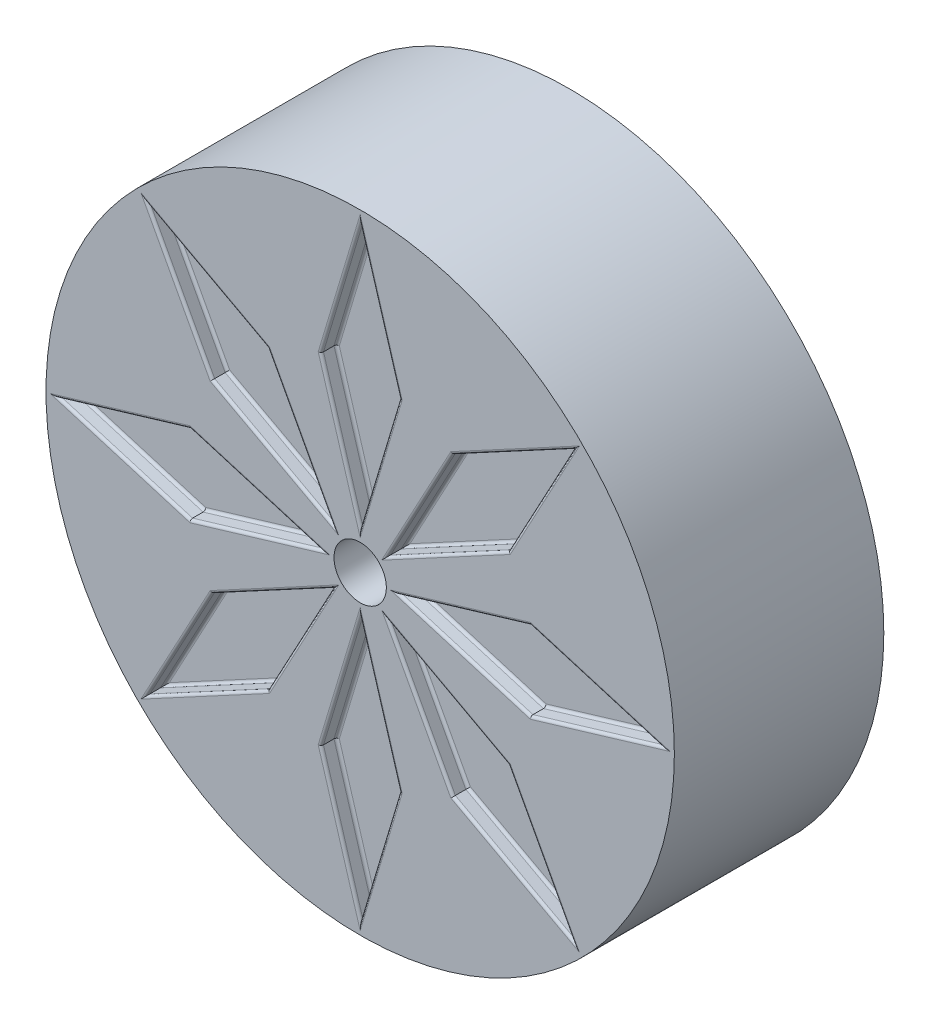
ISO-10303-21;
HEADER;
FILE_DESCRIPTION(('STEP AP214'),'2;1');
FILE_NAME('part.step','',(''),(''),'','','');
FILE_SCHEMA(('AUTOMOTIVE_DESIGN { 1 0 10303 214 1 1 1 1 }'));
ENDSEC;
DATA;
#1=APPLICATION_CONTEXT('core data for automotive mechanical design processes');
#2=APPLICATION_PROTOCOL_DEFINITION('international standard','automotive_design',2000,#1);
#3=PRODUCT_CONTEXT('',#1,'mechanical');
#4=PRODUCT('Part','Part','',(#3));
#5=PRODUCT_RELATED_PRODUCT_CATEGORY('part','',(#4));
#6=PRODUCT_DEFINITION_FORMATION('','',#4);
#7=PRODUCT_DEFINITION_CONTEXT('part definition',#1,'design');
#8=PRODUCT_DEFINITION('design','',#6,#7);
#9=PRODUCT_DEFINITION_SHAPE('','',#8);
#10=(LENGTH_UNIT() NAMED_UNIT(*) SI_UNIT(.MILLI.,.METRE.));
#11=(NAMED_UNIT(*) PLANE_ANGLE_UNIT() SI_UNIT($,.RADIAN.));
#12=(NAMED_UNIT(*) SI_UNIT($,.STERADIAN.) SOLID_ANGLE_UNIT());
#13=UNCERTAINTY_MEASURE_WITH_UNIT(LENGTH_MEASURE(1.E-05),#10,'distance_accuracy_value','');
#14=(GEOMETRIC_REPRESENTATION_CONTEXT(3) GLOBAL_UNCERTAINTY_ASSIGNED_CONTEXT((#13)) GLOBAL_UNIT_ASSIGNED_CONTEXT((#10,
#11,#12)) REPRESENTATION_CONTEXT('',''));
#15=CARTESIAN_POINT('',(0.,0.,0.));
#16=DIRECTION('',(0.,0.,1.));
#17=DIRECTION('',(1.,0.,0.));
#18=AXIS2_PLACEMENT_3D('',#15,#16,#17);
#19=CARTESIAN_POINT('',(0.,0.,101.6));
#20=DIRECTION('',(0.,0.,1.));
#21=DIRECTION('',(1.,0.,0.));
#22=AXIS2_PLACEMENT_3D('',#19,#20,#21);
#23=PLANE('',#22);
#24=DIRECTION('',(-0.88047109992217,0.474099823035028,0.));
#25=VECTOR('',#24,1.);
#26=CARTESIAN_POINT('',(-44.2991738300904,72.9602472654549,101.6));
#27=LINE('',#26,#25);
#28=CARTESIAN_POINT('',(-106.398166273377,106.398166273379,101.6));
#29=VERTEX_POINT('',#28);
#30=CARTESIAN_POINT('',(-43.9637143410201,72.7796152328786,101.6));
#31=VERTEX_POINT('',#30);
#32=EDGE_CURVE('E41',#29,#31,#27,.F.);
#33=ORIENTED_EDGE('',*,*,#32,.T.);
#34=DIRECTION('',(-0.474099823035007,0.880471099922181,0.));
#35=VECTOR('',#34,1.);
#36=CARTESIAN_POINT('',(-12.3521858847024,14.0724909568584,101.6));
#37=LINE('',#36,#35);
#38=CARTESIAN_POINT('',(-10.3451633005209,10.3451633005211,101.6));
#39=VERTEX_POINT('',#38);
#40=EDGE_CURVE('E11',#31,#39,#37,.F.);
#41=ORIENTED_EDGE('',*,*,#40,.T.);
#42=DIRECTION('',(0.88047109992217,-0.474099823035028,0.));
#43=VECTOR('',#42,1.);
#44=CARTESIAN_POINT('',(-72.4441557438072,43.7830823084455,101.6));
#45=LINE('',#44,#43);
#46=CARTESIAN_POINT('',(-72.7796152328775,43.9637143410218,101.6));
#47=VERTEX_POINT('',#46);
#48=EDGE_CURVE('E870',#39,#47,#45,.F.);
#49=ORIENTED_EDGE('',*,*,#48,.T.);
#50=DIRECTION('',(0.474099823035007,-0.880471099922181,0.));
#51=VECTOR('',#50,1.);
#52=CARTESIAN_POINT('',(-104.391143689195,102.670838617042,101.6));
#53=LINE('',#52,#51);
#54=EDGE_CURVE('E52',#47,#29,#53,.F.);
#55=ORIENTED_EDGE('',*,*,#54,.T.);
#56=EDGE_LOOP('',(#33,#41,#49,#55));
#57=FACE_BOUND('',#56,.T.);
#58=DIRECTION('',(-0.957826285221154,-0.287347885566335,0.));
#59=VECTOR('',#58,1.);
#60=CARTESIAN_POINT('',(-82.9149318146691,20.2664393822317,101.6));
#61=LINE('',#60,#59);
#62=CARTESIAN_POINT('',(-150.469729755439,1.58350725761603E-12,101.6));
#63=VERTEX_POINT('',#62);
#64=CARTESIAN_POINT('',(-82.5499999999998,20.3759189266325,101.6));
#65=VERTEX_POINT('',#64);
#66=EDGE_CURVE('E818',#63,#65,#61,.F.);
#67=ORIENTED_EDGE('',*,*,#66,.T.);
#68=DIRECTION('',(-0.957826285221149,0.287347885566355,0.));
#69=VECTOR('',#68,1.);
#70=CARTESIAN_POINT('',(-18.6850681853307,1.21643938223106,101.6));
#71=LINE('',#70,#69);
#72=CARTESIAN_POINT('',(-14.6302702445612,1.49281324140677E-13,101.6));
#73=VERTEX_POINT('',#72);
#74=EDGE_CURVE('E820',#65,#73,#71,.F.);
#75=ORIENTED_EDGE('',*,*,#74,.T.);
#76=DIRECTION('',(0.957826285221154,0.287347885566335,0.));
#77=VECTOR('',#76,1.);
#78=CARTESIAN_POINT('',(-82.185068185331,-20.26643938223,101.6));
#79=LINE('',#78,#77);
#80=CARTESIAN_POINT('',(-82.5500000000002,-20.3759189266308,101.6));
#81=VERTEX_POINT('',#80);
#82=EDGE_CURVE('E814',#73,#81,#79,.F.);
#83=ORIENTED_EDGE('',*,*,#82,.T.);
#84=DIRECTION('',(0.957826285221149,-0.287347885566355,0.));
#85=VECTOR('',#84,1.);
#86=CARTESIAN_POINT('',(-146.414931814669,-1.21643938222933,101.6));
#87=LINE('',#86,#85);
#88=EDGE_CURVE('E816',#81,#63,#87,.F.);
#89=ORIENTED_EDGE('',*,*,#88,.T.);
#90=EDGE_LOOP('',(#67,#75,#83,#89));
#91=FACE_BOUND('',#90,.T.);
#92=DIRECTION('',(-0.474099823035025,-0.880471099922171,0.));
#93=VECTOR('',#92,1.);
#94=CARTESIAN_POINT('',(-72.9602472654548,-44.2991738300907,101.6));
#95=LINE('',#94,#93);
#96=CARTESIAN_POINT('',(-106.398166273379,-106.398166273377,101.6));
#97=VERTEX_POINT('',#96);
#98=CARTESIAN_POINT('',(-72.7796152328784,-43.9637143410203,101.6));
#99=VERTEX_POINT('',#98);
#100=EDGE_CURVE('E762',#97,#99,#95,.F.);
#101=ORIENTED_EDGE('',*,*,#100,.T.);
#102=DIRECTION('',(-0.880471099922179,-0.47409982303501,0.));
#103=VECTOR('',#102,1.);
#104=CARTESIAN_POINT('',(-14.0724909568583,-12.3521858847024,101.6));
#105=LINE('',#104,#103);
#106=CARTESIAN_POINT('',(-10.3451633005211,-10.3451633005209,101.6));
#107=VERTEX_POINT('',#106);
#108=EDGE_CURVE('E764',#99,#107,#105,.F.);
#109=ORIENTED_EDGE('',*,*,#108,.T.);
#110=DIRECTION('',(0.474099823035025,0.880471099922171,0.));
#111=VECTOR('',#110,1.);
#112=CARTESIAN_POINT('',(-43.7830823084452,-72.4441557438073,101.6));
#113=LINE('',#112,#111);
#114=CARTESIAN_POINT('',(-43.9637143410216,-72.7796152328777,101.6));
#115=VERTEX_POINT('',#114);
#116=EDGE_CURVE('E758',#107,#115,#113,.F.);
#117=ORIENTED_EDGE('',*,*,#116,.T.);
#118=DIRECTION('',(0.880471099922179,0.47409982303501,0.));
#119=VECTOR('',#118,1.);
#120=CARTESIAN_POINT('',(-102.670838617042,-104.391143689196,101.6));
#121=LINE('',#120,#119);
#122=EDGE_CURVE('E760',#115,#97,#121,.F.);
#123=ORIENTED_EDGE('',*,*,#122,.T.);
#124=EDGE_LOOP('',(#101,#109,#117,#123));
#125=FACE_BOUND('',#124,.T.);
#126=DIRECTION('',(0.287347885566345,-0.957826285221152,0.));
#127=VECTOR('',#126,1.);
#128=CARTESIAN_POINT('',(-20.2664393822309,-82.9149318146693,101.6));
#129=LINE('',#128,#127);
#130=CARTESIAN_POINT('',(0.,-150.469729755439,101.6));
#131=VERTEX_POINT('',#130);
#132=CARTESIAN_POINT('',(-20.3759189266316,-82.55,101.6));
#133=VERTEX_POINT('',#132);
#134=EDGE_CURVE('E706',#131,#133,#129,.F.);
#135=ORIENTED_EDGE('',*,*,#134,.T.);
#136=DIRECTION('',(-0.287347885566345,-0.957826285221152,0.));
#137=VECTOR('',#136,1.);
#138=CARTESIAN_POINT('',(-1.21643938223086,-18.6850681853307,101.6));
#139=LINE('',#138,#137);
#140=CARTESIAN_POINT('',(0.,-14.6302702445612,101.6));
#141=VERTEX_POINT('',#140);
#142=EDGE_CURVE('E708',#133,#141,#139,.F.);
#143=ORIENTED_EDGE('',*,*,#142,.T.);
#144=DIRECTION('',(-0.287347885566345,0.957826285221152,0.));
#145=VECTOR('',#144,1.);
#146=CARTESIAN_POINT('',(20.2664393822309,-82.1850681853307,101.6));
#147=LINE('',#146,#145);
#148=CARTESIAN_POINT('',(20.3759189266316,-82.55,101.6));
#149=VERTEX_POINT('',#148);
#150=EDGE_CURVE('E702',#141,#149,#147,.F.);
#151=ORIENTED_EDGE('',*,*,#150,.T.);
#152=DIRECTION('',(0.287347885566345,0.957826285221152,0.));
#153=VECTOR('',#152,1.);
#154=CARTESIAN_POINT('',(1.21643938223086,-146.414931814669,101.6));
#155=LINE('',#154,#153);
#156=EDGE_CURVE('E704',#149,#131,#155,.F.);
#157=ORIENTED_EDGE('',*,*,#156,.T.);
#158=EDGE_LOOP('',(#135,#143,#151,#157));
#159=FACE_BOUND('',#158,.T.);
#160=DIRECTION('',(0.880471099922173,-0.474099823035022,0.));
#161=VECTOR('',#160,1.);
#162=CARTESIAN_POINT('',(44.2991738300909,-72.9602472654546,101.6));
#163=LINE('',#162,#161);
#164=CARTESIAN_POINT('',(106.398166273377,-106.398166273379,101.6));
#165=VERTEX_POINT('',#164);
#166=CARTESIAN_POINT('',(43.9637143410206,-72.7796152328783,101.6));
#167=VERTEX_POINT('',#166);
#168=EDGE_CURVE('E650',#165,#167,#163,.F.);
#169=ORIENTED_EDGE('',*,*,#168,.T.);
#170=DIRECTION('',(0.474099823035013,-0.880471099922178,0.));
#171=VECTOR('',#170,1.);
#172=CARTESIAN_POINT('',(12.3521858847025,-14.0724909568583,101.6));
#173=LINE('',#172,#171);
#174=CARTESIAN_POINT('',(10.3451633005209,-10.3451633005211,101.6));
#175=VERTEX_POINT('',#174);
#176=EDGE_CURVE('E652',#167,#175,#173,.F.);
#177=ORIENTED_EDGE('',*,*,#176,.T.);
#178=DIRECTION('',(-0.880471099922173,0.474099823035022,0.));
#179=VECTOR('',#178,1.);
#180=CARTESIAN_POINT('',(72.4441557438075,-43.783082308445,101.6));
#181=LINE('',#180,#179);
#182=CARTESIAN_POINT('',(72.7796152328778,-43.9637143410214,101.6));
#183=VERTEX_POINT('',#182);
#184=EDGE_CURVE('E646',#175,#183,#181,.F.);
#185=ORIENTED_EDGE('',*,*,#184,.T.);
#186=DIRECTION('',(-0.474099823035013,0.880471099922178,0.));
#187=VECTOR('',#186,1.);
#188=CARTESIAN_POINT('',(104.391143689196,-102.670838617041,101.6));
#189=LINE('',#188,#187);
#190=EDGE_CURVE('E648',#183,#165,#189,.F.);
#191=ORIENTED_EDGE('',*,*,#190,.T.);
#192=EDGE_LOOP('',(#169,#177,#185,#191));
#193=FACE_BOUND('',#192,.T.);
#194=DIRECTION('',(0.957826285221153,0.287347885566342,0.));
#195=VECTOR('',#194,1.);
#196=CARTESIAN_POINT('',(82.9149318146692,-20.2664393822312,101.6));
#197=LINE('',#196,#195);
#198=CARTESIAN_POINT('',(150.469729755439,-5.20279280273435E-13,101.6));
#199=VERTEX_POINT('',#198);
#200=CARTESIAN_POINT('',(82.5499999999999,-20.3759189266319,101.6));
#201=VERTEX_POINT('',#200);
#202=EDGE_CURVE('E594',#199,#201,#197,.F.);
#203=ORIENTED_EDGE('',*,*,#202,.T.);
#204=DIRECTION('',(0.95782628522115,-0.287347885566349,0.));
#205=VECTOR('',#204,1.);
#206=CARTESIAN_POINT('',(18.6850681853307,-1.21643938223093,101.6));
#207=LINE('',#206,#205);
#208=CARTESIAN_POINT('',(14.6302702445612,0.,101.6));
#209=VERTEX_POINT('',#208);
#210=EDGE_CURVE('E596',#201,#209,#207,.F.);
#211=ORIENTED_EDGE('',*,*,#210,.T.);
#212=DIRECTION('',(-0.957826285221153,-0.287347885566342,0.));
#213=VECTOR('',#212,1.);
#214=CARTESIAN_POINT('',(82.1850681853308,20.2664393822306,101.6));
#215=LINE('',#214,#213);
#216=CARTESIAN_POINT('',(82.5500000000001,20.3759189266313,101.6));
#217=VERTEX_POINT('',#216);
#218=EDGE_CURVE('E590',#209,#217,#215,.F.);
#219=ORIENTED_EDGE('',*,*,#218,.T.);
#220=DIRECTION('',(-0.95782628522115,0.287347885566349,0.));
#221=VECTOR('',#220,1.);
#222=CARTESIAN_POINT('',(146.414931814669,1.21643938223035,101.6));
#223=LINE('',#222,#221);
#224=EDGE_CURVE('E592',#217,#199,#223,.F.);
#225=ORIENTED_EDGE('',*,*,#224,.T.);
#226=EDGE_LOOP('',(#203,#211,#219,#225));
#227=FACE_BOUND('',#226,.T.);
#228=DIRECTION('',(0.474099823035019,0.880471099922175,0.));
#229=VECTOR('',#228,1.);
#230=CARTESIAN_POINT('',(72.9602472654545,44.2991738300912,101.6));
#231=LINE('',#230,#229);
#232=CARTESIAN_POINT('',(106.398166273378,106.398166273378,101.6));
#233=VERTEX_POINT('',#232);
#234=CARTESIAN_POINT('',(72.7796152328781,43.9637143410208,101.6));
#235=VERTEX_POINT('',#234);
#236=EDGE_CURVE('E536',#233,#235,#231,.F.);
#237=ORIENTED_EDGE('',*,*,#236,.T.);
#238=DIRECTION('',(0.880471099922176,0.474099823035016,0.));
#239=VECTOR('',#238,1.);
#240=CARTESIAN_POINT('',(14.0724909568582,12.3521858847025,101.6));
#241=LINE('',#240,#239);
#242=CARTESIAN_POINT('',(10.345163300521,10.345163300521,101.6));
#243=VERTEX_POINT('',#242);
#244=EDGE_CURVE('E538',#235,#243,#241,.F.);
#245=ORIENTED_EDGE('',*,*,#244,.T.);
#246=DIRECTION('',(-0.474099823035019,-0.880471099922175,0.));
#247=VECTOR('',#246,1.);
#248=CARTESIAN_POINT('',(43.7830823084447,72.4441557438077,101.6));
#249=LINE('',#248,#247);
#250=CARTESIAN_POINT('',(43.9637143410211,72.779615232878,101.6));
#251=VERTEX_POINT('',#250);
#252=EDGE_CURVE('E532',#243,#251,#249,.F.);
#253=ORIENTED_EDGE('',*,*,#252,.T.);
#254=DIRECTION('',(-0.880471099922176,-0.474099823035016,0.));
#255=VECTOR('',#254,1.);
#256=CARTESIAN_POINT('',(102.670838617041,104.391143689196,101.6));
#257=LINE('',#256,#255);
#258=EDGE_CURVE('E534',#251,#233,#257,.F.);
#259=ORIENTED_EDGE('',*,*,#258,.T.);
#260=EDGE_LOOP('',(#237,#245,#253,#259));
#261=FACE_BOUND('',#260,.T.);
#262=DIRECTION('',(-0.287347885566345,0.957826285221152,0.));
#263=VECTOR('',#262,1.);
#264=CARTESIAN_POINT('',(20.2664393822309,82.9149318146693,101.6));
#265=LINE('',#264,#263);
#266=CARTESIAN_POINT('',(0.,150.469729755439,101.6));
#267=VERTEX_POINT('',#266);
#268=CARTESIAN_POINT('',(20.3759189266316,82.55,101.6));
#269=VERTEX_POINT('',#268);
#270=EDGE_CURVE('E484',#267,#269,#265,.F.);
#271=ORIENTED_EDGE('',*,*,#270,.T.);
#272=DIRECTION('',(0.287347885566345,0.957826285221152,0.));
#273=VECTOR('',#272,1.);
#274=CARTESIAN_POINT('',(1.21643938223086,18.6850681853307,101.6));
#275=LINE('',#274,#273);
#276=CARTESIAN_POINT('',(0.,14.6302702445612,101.6));
#277=VERTEX_POINT('',#276);
#278=EDGE_CURVE('E486',#269,#277,#275,.F.);
#279=ORIENTED_EDGE('',*,*,#278,.T.);
#280=DIRECTION('',(0.287347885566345,-0.957826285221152,0.));
#281=VECTOR('',#280,1.);
#282=CARTESIAN_POINT('',(-20.2664393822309,82.1850681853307,101.6));
#283=LINE('',#282,#281);
#284=CARTESIAN_POINT('',(-20.3759189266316,82.55,101.6));
#285=VERTEX_POINT('',#284);
#286=EDGE_CURVE('E480',#277,#285,#283,.F.);
#287=ORIENTED_EDGE('',*,*,#286,.T.);
#288=DIRECTION('',(-0.287347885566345,-0.957826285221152,0.));
#289=VECTOR('',#288,1.);
#290=CARTESIAN_POINT('',(-1.21643938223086,146.414931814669,101.6));
#291=LINE('',#290,#289);
#292=EDGE_CURVE('E482',#285,#267,#291,.F.);
#293=ORIENTED_EDGE('',*,*,#292,.T.);
#294=EDGE_LOOP('',(#271,#279,#287,#293));
#295=FACE_BOUND('',#294,.T.);
#296=CARTESIAN_POINT('',(0.,0.,101.6));
#297=DIRECTION('',(0.,0.,1.));
#298=DIRECTION('',(1.,0.,0.));
#299=AXIS2_PLACEMENT_3D('',#296,#297,#298);
#300=CIRCLE('',#299,152.4);
#301=CARTESIAN_POINT('',(152.4,0.,101.6));
#302=VERTEX_POINT('',#301);
#303=EDGE_CURVE('E454',#302,#302,#300,.T.);
#304=ORIENTED_EDGE('',*,*,#303,.T.);
#305=EDGE_LOOP('',(#304));
#306=FACE_BOUND('',#305,.T.);
#307=CARTESIAN_POINT('',(0.,0.,101.6));
#308=DIRECTION('',(0.,0.,1.));
#309=DIRECTION('',(1.,0.,0.));
#310=AXIS2_PLACEMENT_3D('',#307,#308,#309);
#311=CIRCLE('',#310,12.7);
#312=CARTESIAN_POINT('',(12.7,0.,101.6));
#313=VERTEX_POINT('',#312);
#314=EDGE_CURVE('E934',#313,#313,#311,.T.);
#315=ORIENTED_EDGE('',*,*,#314,.F.);
#316=EDGE_LOOP('',(#315));
#317=FACE_BOUND('',#316,.T.);
#318=ADVANCED_FACE('F32',(#57,#91,#125,#159,#193,#227,#261,#295,#306,#317),#23,.T.);
#319=CARTESIAN_POINT('',(0.,0.,0.));
#320=DIRECTION('',(0.,0.,1.));
#321=DIRECTION('',(1.,0.,0.));
#322=AXIS2_PLACEMENT_3D('',#319,#320,#321);
#323=PLANE('',#322);
#324=CARTESIAN_POINT('',(0.,0.,0.));
#325=DIRECTION('',(0.,0.,1.));
#326=DIRECTION('',(1.,0.,0.));
#327=AXIS2_PLACEMENT_3D('',#324,#325,#326);
#328=CIRCLE('',#327,152.4);
#329=CARTESIAN_POINT('',(152.4,0.,0.));
#330=VERTEX_POINT('',#329);
#331=EDGE_CURVE('E936',#330,#330,#328,.T.);
#332=ORIENTED_EDGE('',*,*,#331,.F.);
#333=EDGE_LOOP('',(#332));
#334=FACE_BOUND('',#333,.T.);
#335=CARTESIAN_POINT('',(0.,0.,0.));
#336=DIRECTION('',(0.,0.,1.));
#337=DIRECTION('',(1.,0.,0.));
#338=AXIS2_PLACEMENT_3D('',#335,#336,#337);
#339=CIRCLE('',#338,12.7);
#340=CARTESIAN_POINT('',(12.7,0.,0.));
#341=VERTEX_POINT('',#340);
#342=EDGE_CURVE('E937',#341,#341,#339,.T.);
#343=ORIENTED_EDGE('',*,*,#342,.T.);
#344=EDGE_LOOP('',(#343));
#345=FACE_BOUND('',#344,.T.);
#346=ADVANCED_FACE('F906',(#334,#345),#323,.F.);
#347=CARTESIAN_POINT('',(0.,0.,101.6));
#348=DIRECTION('',(0.,0.,-1.));
#349=DIRECTION('',(-1.,0.,0.));
#350=AXIS2_PLACEMENT_3D('',#347,#348,#349);
#351=CYLINDRICAL_SURFACE('',#350,152.4);
#352=ORIENTED_EDGE('',*,*,#303,.F.);
#353=EDGE_LOOP('',(#352));
#354=FACE_BOUND('',#353,.T.);
#355=ORIENTED_EDGE('',*,*,#331,.T.);
#356=EDGE_LOOP('',(#355));
#357=FACE_BOUND('',#356,.T.);
#358=ADVANCED_FACE('F1326',(#354,#357),#351,.T.);
#359=CARTESIAN_POINT('',(0.,0.,101.6));
#360=DIRECTION('',(0.,0.,-1.));
#361=DIRECTION('',(-1.,0.,0.));
#362=AXIS2_PLACEMENT_3D('',#359,#360,#361);
#363=CYLINDRICAL_SURFACE('',#362,12.7);
#364=ORIENTED_EDGE('',*,*,#314,.T.);
#365=EDGE_LOOP('',(#364));
#366=FACE_BOUND('',#365,.T.);
#367=ORIENTED_EDGE('',*,*,#342,.F.);
#368=EDGE_LOOP('',(#367));
#369=FACE_BOUND('',#368,.T.);
#370=ADVANCED_FACE('F1329',(#366,#369),#363,.F.);
#371=CARTESIAN_POINT('',(-19.05,82.55,93.98));
#372=DIRECTION('',(-0.957826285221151,-0.287347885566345,0.));
#373=DIRECTION('',(0.287347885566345,-0.957826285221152,0.));
#374=AXIS2_PLACEMENT_3D('',#371,#372,#373);
#375=PLANE('',#374);
#376=DIRECTION('',(0.,0.,1.));
#377=VECTOR('',#376,1.);
#378=CARTESIAN_POINT('',(0.,19.05,93.98));
#379=LINE('',#378,#377);
#380=CARTESIAN_POINT('',(0.,19.05,95.25));
#381=VERTEX_POINT('',#380);
#382=CARTESIAN_POINT('',(0.,19.05,100.33));
#383=VERTEX_POINT('',#382);
#384=EDGE_CURVE('E495',#381,#383,#379,.T.);
#385=ORIENTED_EDGE('',*,*,#384,.F.);
#386=DIRECTION('',(0.287347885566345,-0.957826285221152,0.));
#387=VECTOR('',#386,1.);
#388=CARTESIAN_POINT('',(-19.05,82.55,95.25));
#389=LINE('',#388,#387);
#390=CARTESIAN_POINT('',(-19.05,82.55,95.25));
#391=VERTEX_POINT('',#390);
#392=EDGE_CURVE('E478',#381,#391,#389,.F.);
#393=ORIENTED_EDGE('',*,*,#392,.T.);
#394=DIRECTION('',(0.,0.,1.));
#395=VECTOR('',#394,1.);
#396=CARTESIAN_POINT('',(-19.05,82.55,93.98));
#397=LINE('',#396,#395);
#398=CARTESIAN_POINT('',(-19.05,82.55,100.33));
#399=VERTEX_POINT('',#398);
#400=EDGE_CURVE('E942',#391,#399,#397,.T.);
#401=ORIENTED_EDGE('',*,*,#400,.T.);
#402=DIRECTION('',(0.287347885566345,-0.957826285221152,0.));
#403=VECTOR('',#402,1.);
#404=CARTESIAN_POINT('',(0.,19.05,100.33));
#405=LINE('',#404,#403);
#406=EDGE_CURVE('E476',#399,#383,#405,.T.);
#407=ORIENTED_EDGE('',*,*,#406,.T.);
#408=EDGE_LOOP('',(#385,#393,#401,#407));
#409=FACE_BOUND('',#408,.T.);
#410=ADVANCED_FACE('F1336',(#409),#375,.F.);
#411=CARTESIAN_POINT('',(0.,146.05,93.98));
#412=DIRECTION('',(-0.957826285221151,0.287347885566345,0.));
#413=DIRECTION('',(-0.287347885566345,-0.957826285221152,0.));
#414=AXIS2_PLACEMENT_3D('',#411,#412,#413);
#415=PLANE('',#414);
#416=ORIENTED_EDGE('',*,*,#400,.F.);
#417=DIRECTION('',(-0.287347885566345,-0.957826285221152,0.));
#418=VECTOR('',#417,1.);
#419=CARTESIAN_POINT('',(0.,146.05,95.25));
#420=LINE('',#419,#418);
#421=CARTESIAN_POINT('',(0.,146.05,95.25));
#422=VERTEX_POINT('',#421);
#423=EDGE_CURVE('E440',#391,#422,#420,.F.);
#424=ORIENTED_EDGE('',*,*,#423,.T.);
#425=DIRECTION('',(0.,0.,1.));
#426=VECTOR('',#425,1.);
#427=CARTESIAN_POINT('',(0.,146.05,93.98));
#428=LINE('',#427,#426);
#429=CARTESIAN_POINT('',(0.,146.05,100.33));
#430=VERTEX_POINT('',#429);
#431=EDGE_CURVE('E962',#422,#430,#428,.T.);
#432=ORIENTED_EDGE('',*,*,#431,.T.);
#433=DIRECTION('',(-0.287347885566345,-0.957826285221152,0.));
#434=VECTOR('',#433,1.);
#435=CARTESIAN_POINT('',(-19.05,82.55,100.33));
#436=LINE('',#435,#434);
#437=EDGE_CURVE('E460',#430,#399,#436,.T.);
#438=ORIENTED_EDGE('',*,*,#437,.T.);
#439=EDGE_LOOP('',(#416,#424,#432,#438));
#440=FACE_BOUND('',#439,.T.);
#441=ADVANCED_FACE('F961',(#440),#415,.F.);
#442=CARTESIAN_POINT('',(19.05,82.55,93.98));
#443=DIRECTION('',(0.957826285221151,0.287347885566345,0.));
#444=DIRECTION('',(-0.287347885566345,0.957826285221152,0.));
#445=AXIS2_PLACEMENT_3D('',#442,#443,#444);
#446=PLANE('',#445);
#447=ORIENTED_EDGE('',*,*,#431,.F.);
#448=DIRECTION('',(-0.287347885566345,0.957826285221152,0.));
#449=VECTOR('',#448,1.);
#450=CARTESIAN_POINT('',(19.05,82.55,95.25));
#451=LINE('',#450,#449);
#452=CARTESIAN_POINT('',(19.05,82.55,95.25));
#453=VERTEX_POINT('',#452);
#454=EDGE_CURVE('E469',#422,#453,#451,.F.);
#455=ORIENTED_EDGE('',*,*,#454,.T.);
#456=DIRECTION('',(0.,0.,1.));
#457=VECTOR('',#456,1.);
#458=CARTESIAN_POINT('',(19.05,82.55,93.98));
#459=LINE('',#458,#457);
#460=CARTESIAN_POINT('',(19.05,82.55,100.33));
#461=VERTEX_POINT('',#460);
#462=EDGE_CURVE('E967',#453,#461,#459,.T.);
#463=ORIENTED_EDGE('',*,*,#462,.T.);
#464=DIRECTION('',(-0.287347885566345,0.957826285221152,0.));
#465=VECTOR('',#464,1.);
#466=CARTESIAN_POINT('',(0.,146.05,100.33));
#467=LINE('',#466,#465);
#468=EDGE_CURVE('E467',#461,#430,#467,.T.);
#469=ORIENTED_EDGE('',*,*,#468,.T.);
#470=EDGE_LOOP('',(#447,#455,#463,#469));
#471=FACE_BOUND('',#470,.T.);
#472=ADVANCED_FACE('F965',(#471),#446,.F.);
#473=CARTESIAN_POINT('',(0.,19.05,93.98));
#474=DIRECTION('',(0.957826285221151,-0.287347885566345,0.));
#475=DIRECTION('',(0.287347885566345,0.957826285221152,0.));
#476=AXIS2_PLACEMENT_3D('',#473,#474,#475);
#477=PLANE('',#476);
#478=ORIENTED_EDGE('',*,*,#462,.F.);
#479=DIRECTION('',(0.287347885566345,0.957826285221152,0.));
#480=VECTOR('',#479,1.);
#481=CARTESIAN_POINT('',(0.,19.05,95.25));
#482=LINE('',#481,#480);
#483=EDGE_CURVE('E474',#453,#381,#482,.F.);
#484=ORIENTED_EDGE('',*,*,#483,.T.);
#485=ORIENTED_EDGE('',*,*,#384,.T.);
#486=DIRECTION('',(0.287347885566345,0.957826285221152,0.));
#487=VECTOR('',#486,1.);
#488=CARTESIAN_POINT('',(19.05,82.55,100.33));
#489=LINE('',#488,#487);
#490=EDGE_CURVE('E471',#383,#461,#489,.T.);
#491=ORIENTED_EDGE('',*,*,#490,.T.);
#492=EDGE_LOOP('',(#478,#484,#485,#491));
#493=FACE_BOUND('',#492,.T.);
#494=ADVANCED_FACE('F1340',(#493),#477,.F.);
#495=CARTESIAN_POINT('',(0.,0.,93.98));
#496=DIRECTION('',(0.,0.,1.));
#497=DIRECTION('',(1.,0.,0.));
#498=AXIS2_PLACEMENT_3D('',#495,#496,#497);
#499=PLANE('',#498);
#500=DIRECTION('',(-0.287347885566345,0.957826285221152,0.));
#501=VECTOR('',#500,1.);
#502=CARTESIAN_POINT('',(38.9808083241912,11.6942424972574,93.98));
#503=LINE('',#502,#501);
#504=CARTESIAN_POINT('',(17.7240810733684,82.55,93.98));
#505=VERTEX_POINT('',#504);
#506=CARTESIAN_POINT('',(0.,141.630270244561,93.98));
#507=VERTEX_POINT('',#506);
#508=EDGE_CURVE('E458',#505,#507,#503,.T.);
#509=ORIENTED_EDGE('',*,*,#508,.T.);
#510=DIRECTION('',(-0.287347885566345,-0.957826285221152,0.));
#511=VECTOR('',#510,1.);
#512=CARTESIAN_POINT('',(-38.9808083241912,11.6942424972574,93.98));
#513=LINE('',#512,#511);
#514=CARTESIAN_POINT('',(-17.7240810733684,82.55,93.98));
#515=VERTEX_POINT('',#514);
#516=EDGE_CURVE('E438',#507,#515,#513,.T.);
#517=ORIENTED_EDGE('',*,*,#516,.T.);
#518=DIRECTION('',(0.287347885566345,-0.957826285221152,0.));
#519=VECTOR('',#518,1.);
#520=CARTESIAN_POINT('',(6.45955864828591,1.93786759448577,93.98));
#521=LINE('',#520,#519);
#522=CARTESIAN_POINT('',(0.,23.4697297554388,93.98));
#523=VERTEX_POINT('',#522);
#524=EDGE_CURVE('E447',#515,#523,#521,.T.);
#525=ORIENTED_EDGE('',*,*,#524,.T.);
#526=DIRECTION('',(0.287347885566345,0.957826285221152,0.));
#527=VECTOR('',#526,1.);
#528=CARTESIAN_POINT('',(-6.45955864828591,1.93786759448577,93.98));
#529=LINE('',#528,#527);
#530=EDGE_CURVE('E453',#523,#505,#529,.T.);
#531=ORIENTED_EDGE('',*,*,#530,.T.);
#532=EDGE_LOOP('',(#509,#517,#525,#531));
#533=FACE_BOUND('',#532,.T.);
#534=ADVANCED_FACE('F456',(#533),#499,.T.);
#535=CARTESIAN_POINT('',(-6.45955864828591,1.93786759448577,95.25));
#536=DIRECTION('',(0.287347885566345,0.957826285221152,0.));
#537=DIRECTION('',(-0.957826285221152,0.287347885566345,0.));
#538=AXIS2_PLACEMENT_3D('',#535,#536,#537);
#539=CYLINDRICAL_SURFACE('',#538,1.27);
#540=CARTESIAN_POINT('',(0.,23.4697297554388,95.25));
#541=DIRECTION('',(1.,0.,0.));
#542=DIRECTION('',(0.,1.,0.));
#543=AXIS2_PLACEMENT_3D('',#540,#541,#542);
#544=ELLIPSE('',#543,4.4197297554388,1.27);
#545=EDGE_CURVE('E450',#381,#523,#544,.T.);
#546=ORIENTED_EDGE('',*,*,#545,.F.);
#547=ORIENTED_EDGE('',*,*,#483,.F.);
#548=CARTESIAN_POINT('',(17.7240810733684,82.55,95.25));
#549=DIRECTION('',(0.,1.,0.));
#550=DIRECTION('',(-1.,0.,0.));
#551=AXIS2_PLACEMENT_3D('',#548,#549,#550);
#552=ELLIPSE('',#551,1.32591892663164,1.27);
#553=EDGE_CURVE('E492',#505,#453,#552,.F.);
#554=ORIENTED_EDGE('',*,*,#553,.F.);
#555=ORIENTED_EDGE('',*,*,#530,.F.);
#556=EDGE_LOOP('',(#546,#547,#554,#555));
#557=FACE_BOUND('',#556,.T.);
#558=ADVANCED_FACE('F950',(#557),#539,.F.);
#559=CARTESIAN_POINT('',(38.9808083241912,11.6942424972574,95.25));
#560=DIRECTION('',(-0.287347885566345,0.957826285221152,0.));
#561=DIRECTION('',(-0.957826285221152,-0.287347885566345,0.));
#562=AXIS2_PLACEMENT_3D('',#559,#560,#561);
#563=CYLINDRICAL_SURFACE('',#562,1.27);
#564=ORIENTED_EDGE('',*,*,#553,.T.);
#565=ORIENTED_EDGE('',*,*,#454,.F.);
#566=CARTESIAN_POINT('',(0.,141.630270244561,95.25));
#567=DIRECTION('',(-1.,0.,0.));
#568=DIRECTION('',(0.,-1.,0.));
#569=AXIS2_PLACEMENT_3D('',#566,#567,#568);
#570=ELLIPSE('',#569,4.4197297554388,1.27);
#571=EDGE_CURVE('E443',#507,#422,#570,.F.);
#572=ORIENTED_EDGE('',*,*,#571,.F.);
#573=ORIENTED_EDGE('',*,*,#508,.F.);
#574=EDGE_LOOP('',(#564,#565,#572,#573));
#575=FACE_BOUND('',#574,.T.);
#576=ADVANCED_FACE('F953',(#575),#563,.F.);
#577=CARTESIAN_POINT('',(6.45955864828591,1.93786759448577,95.25));
#578=DIRECTION('',(0.287347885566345,-0.957826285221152,0.));
#579=DIRECTION('',(0.957826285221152,0.287347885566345,0.));
#580=AXIS2_PLACEMENT_3D('',#577,#578,#579);
#581=CYLINDRICAL_SURFACE('',#580,1.27);
#582=ORIENTED_EDGE('',*,*,#545,.T.);
#583=ORIENTED_EDGE('',*,*,#524,.F.);
#584=CARTESIAN_POINT('',(-17.7240810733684,82.55,95.25));
#585=DIRECTION('',(0.,-1.,0.));
#586=DIRECTION('',(-1.,0.,0.));
#587=AXIS2_PLACEMENT_3D('',#584,#585,#586);
#588=ELLIPSE('',#587,1.32591892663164,1.27);
#589=EDGE_CURVE('E434',#391,#515,#588,.T.);
#590=ORIENTED_EDGE('',*,*,#589,.F.);
#591=ORIENTED_EDGE('',*,*,#392,.F.);
#592=EDGE_LOOP('',(#582,#583,#590,#591));
#593=FACE_BOUND('',#592,.T.);
#594=ADVANCED_FACE('F448',(#593),#581,.F.);
#595=CARTESIAN_POINT('',(-38.9808083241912,11.6942424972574,95.25));
#596=DIRECTION('',(-0.287347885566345,-0.957826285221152,0.));
#597=DIRECTION('',(0.957826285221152,-0.287347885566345,0.));
#598=AXIS2_PLACEMENT_3D('',#595,#596,#597);
#599=CYLINDRICAL_SURFACE('',#598,1.27);
#600=ORIENTED_EDGE('',*,*,#571,.T.);
#601=ORIENTED_EDGE('',*,*,#423,.F.);
#602=ORIENTED_EDGE('',*,*,#589,.T.);
#603=ORIENTED_EDGE('',*,*,#516,.F.);
#604=EDGE_LOOP('',(#600,#601,#602,#603));
#605=FACE_BOUND('',#604,.T.);
#606=ADVANCED_FACE('F436',(#605),#599,.F.);
#607=CARTESIAN_POINT('',(-1.21643938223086,146.414931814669,100.33));
#608=DIRECTION('',(0.287347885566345,0.957826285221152,0.));
#609=DIRECTION('',(-0.957826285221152,0.287347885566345,0.));
#610=AXIS2_PLACEMENT_3D('',#607,#608,#609);
#611=CYLINDRICAL_SURFACE('',#610,1.27);
#612=CARTESIAN_POINT('',(0.,150.469729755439,100.33));
#613=DIRECTION('',(1.,0.,0.));
#614=DIRECTION('',(0.,-1.,0.));
#615=AXIS2_PLACEMENT_3D('',#612,#613,#614);
#616=ELLIPSE('',#615,4.4197297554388,1.27);
#617=EDGE_CURVE('E501',#267,#430,#616,.T.);
#618=ORIENTED_EDGE('',*,*,#617,.F.);
#619=ORIENTED_EDGE('',*,*,#292,.F.);
#620=CARTESIAN_POINT('',(-20.3759189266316,82.5500000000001,100.33));
#621=DIRECTION('',(0.,1.,0.));
#622=DIRECTION('',(1.,0.,0.));
#623=AXIS2_PLACEMENT_3D('',#620,#621,#622);
#624=ELLIPSE('',#623,1.32591892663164,1.27);
#625=EDGE_CURVE('E444',#399,#285,#624,.F.);
#626=ORIENTED_EDGE('',*,*,#625,.F.);
#627=ORIENTED_EDGE('',*,*,#437,.F.);
#628=EDGE_LOOP('',(#618,#619,#626,#627));
#629=FACE_BOUND('',#628,.T.);
#630=ADVANCED_FACE('F1301',(#629),#611,.T.);
#631=CARTESIAN_POINT('',(-20.2664393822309,82.1850681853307,100.33));
#632=DIRECTION('',(-0.287347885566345,0.957826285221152,0.));
#633=DIRECTION('',(-0.957826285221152,-0.287347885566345,0.));
#634=AXIS2_PLACEMENT_3D('',#631,#632,#633);
#635=CYLINDRICAL_SURFACE('',#634,1.27);
#636=ORIENTED_EDGE('',*,*,#625,.T.);
#637=ORIENTED_EDGE('',*,*,#286,.F.);
#638=CARTESIAN_POINT('',(0.,14.6302702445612,100.33));
#639=DIRECTION('',(-1.,0.,0.));
#640=DIRECTION('',(0.,-1.,0.));
#641=AXIS2_PLACEMENT_3D('',#638,#639,#640);
#642=ELLIPSE('',#641,4.4197297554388,1.27);
#643=EDGE_CURVE('E498',#383,#277,#642,.F.);
#644=ORIENTED_EDGE('',*,*,#643,.F.);
#645=ORIENTED_EDGE('',*,*,#406,.F.);
#646=EDGE_LOOP('',(#636,#637,#644,#645));
#647=FACE_BOUND('',#646,.T.);
#648=ADVANCED_FACE('F1304',(#647),#635,.T.);
#649=CARTESIAN_POINT('',(20.2664393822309,82.9149318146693,100.33));
#650=DIRECTION('',(0.287347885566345,-0.957826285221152,0.));
#651=DIRECTION('',(0.957826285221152,0.287347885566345,0.));
#652=AXIS2_PLACEMENT_3D('',#649,#650,#651);
#653=CYLINDRICAL_SURFACE('',#652,1.27);
#654=ORIENTED_EDGE('',*,*,#617,.T.);
#655=ORIENTED_EDGE('',*,*,#468,.F.);
#656=CARTESIAN_POINT('',(20.3759189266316,82.55,100.33));
#657=DIRECTION('',(0.,-1.,0.));
#658=DIRECTION('',(-1.,0.,0.));
#659=AXIS2_PLACEMENT_3D('',#656,#657,#658);
#660=ELLIPSE('',#659,1.32591892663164,1.27);
#661=EDGE_CURVE('E496',#269,#461,#660,.T.);
#662=ORIENTED_EDGE('',*,*,#661,.F.);
#663=ORIENTED_EDGE('',*,*,#270,.F.);
#664=EDGE_LOOP('',(#654,#655,#662,#663));
#665=FACE_BOUND('',#664,.T.);
#666=ADVANCED_FACE('F1308',(#665),#653,.T.);
#667=CARTESIAN_POINT('',(1.21643938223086,18.6850681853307,100.33));
#668=DIRECTION('',(-0.287347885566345,-0.957826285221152,0.));
#669=DIRECTION('',(0.957826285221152,-0.287347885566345,0.));
#670=AXIS2_PLACEMENT_3D('',#667,#668,#669);
#671=CYLINDRICAL_SURFACE('',#670,1.27);
#672=ORIENTED_EDGE('',*,*,#643,.T.);
#673=ORIENTED_EDGE('',*,*,#278,.F.);
#674=ORIENTED_EDGE('',*,*,#661,.T.);
#675=ORIENTED_EDGE('',*,*,#490,.F.);
#676=EDGE_LOOP('',(#672,#673,#674,#675));
#677=FACE_BOUND('',#676,.T.);
#678=ADVANCED_FACE('F1312',(#677),#671,.T.);
#679=CARTESIAN_POINT('',(44.9012806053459,71.8420489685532,93.98));
#680=DIRECTION('',(-0.880471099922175,0.474099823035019,0.));
#681=DIRECTION('',(-0.474099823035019,-0.880471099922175,0.));
#682=AXIS2_PLACEMENT_3D('',#679,#680,#681);
#683=PLANE('',#682);
#684=DIRECTION('',(0.,0.,1.));
#685=VECTOR('',#684,1.);
#686=CARTESIAN_POINT('',(13.4703841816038,13.4703841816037,93.98));
#687=LINE('',#686,#685);
#688=CARTESIAN_POINT('',(13.4703841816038,13.4703841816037,95.25));
#689=VERTEX_POINT('',#688);
#690=CARTESIAN_POINT('',(13.4703841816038,13.4703841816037,100.33));
#691=VERTEX_POINT('',#690);
#692=EDGE_CURVE('E971',#689,#691,#687,.T.);
#693=ORIENTED_EDGE('',*,*,#692,.F.);
#694=DIRECTION('',(-0.474099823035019,-0.880471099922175,0.));
#695=VECTOR('',#694,1.);
#696=CARTESIAN_POINT('',(44.9012806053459,71.8420489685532,95.25));
#697=LINE('',#696,#695);
#698=CARTESIAN_POINT('',(44.9012806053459,71.8420489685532,95.25));
#699=VERTEX_POINT('',#698);
#700=EDGE_CURVE('E530',#689,#699,#697,.F.);
#701=ORIENTED_EDGE('',*,*,#700,.T.);
#702=DIRECTION('',(0.,0.,1.));
#703=VECTOR('',#702,1.);
#704=CARTESIAN_POINT('',(44.9012806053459,71.8420489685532,93.98));
#705=LINE('',#704,#703);
#706=CARTESIAN_POINT('',(44.9012806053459,71.8420489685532,100.33));
#707=VERTEX_POINT('',#706);
#708=EDGE_CURVE('E499',#699,#707,#705,.T.);
#709=ORIENTED_EDGE('',*,*,#708,.T.);
#710=DIRECTION('',(-0.474099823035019,-0.880471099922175,0.));
#711=VECTOR('',#710,1.);
#712=CARTESIAN_POINT('',(13.4703841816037,13.4703841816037,100.33));
#713=LINE('',#712,#711);
#714=EDGE_CURVE('E528',#707,#691,#713,.T.);
#715=ORIENTED_EDGE('',*,*,#714,.T.);
#716=EDGE_LOOP('',(#693,#701,#709,#715));
#717=FACE_BOUND('',#716,.T.);
#718=ADVANCED_FACE('F1316',(#717),#683,.F.);
#719=CARTESIAN_POINT('',(103.272945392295,103.272945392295,93.98));
#720=DIRECTION('',(-0.474099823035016,0.880471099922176,0.));
#721=DIRECTION('',(-0.880471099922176,-0.474099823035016,0.));
#722=AXIS2_PLACEMENT_3D('',#719,#720,#721);
#723=PLANE('',#722);
#724=ORIENTED_EDGE('',*,*,#708,.F.);
#725=DIRECTION('',(-0.880471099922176,-0.474099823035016,0.));
#726=VECTOR('',#725,1.);
#727=CARTESIAN_POINT('',(103.272945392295,103.272945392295,95.25));
#728=LINE('',#727,#726);
#729=CARTESIAN_POINT('',(103.272945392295,103.272945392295,95.25));
#730=VERTEX_POINT('',#729);
#731=EDGE_CURVE('E516',#699,#730,#728,.F.);
#732=ORIENTED_EDGE('',*,*,#731,.T.);
#733=DIRECTION('',(0.,0.,1.));
#734=VECTOR('',#733,1.);
#735=CARTESIAN_POINT('',(103.272945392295,103.272945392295,93.98));
#736=LINE('',#735,#734);
#737=CARTESIAN_POINT('',(103.272945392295,103.272945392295,100.33));
#738=VERTEX_POINT('',#737);
#739=EDGE_CURVE('E978',#730,#738,#736,.T.);
#740=ORIENTED_EDGE('',*,*,#739,.T.);
#741=DIRECTION('',(-0.880471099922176,-0.474099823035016,0.));
#742=VECTOR('',#741,1.);
#743=CARTESIAN_POINT('',(44.9012806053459,71.8420489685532,100.33));
#744=LINE('',#743,#742);
#745=EDGE_CURVE('E514',#738,#707,#744,.T.);
#746=ORIENTED_EDGE('',*,*,#745,.T.);
#747=EDGE_LOOP('',(#724,#732,#740,#746));
#748=FACE_BOUND('',#747,.T.);
#749=ADVANCED_FACE('F1352',(#748),#723,.F.);
#750=CARTESIAN_POINT('',(71.8420489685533,44.9012806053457,93.98));
#751=DIRECTION('',(0.880471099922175,-0.474099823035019,0.));
#752=DIRECTION('',(0.474099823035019,0.880471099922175,0.));
#753=AXIS2_PLACEMENT_3D('',#750,#751,#752);
#754=PLANE('',#753);
#755=ORIENTED_EDGE('',*,*,#739,.F.);
#756=DIRECTION('',(0.474099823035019,0.880471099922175,0.));
#757=VECTOR('',#756,1.);
#758=CARTESIAN_POINT('',(71.8420489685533,44.9012806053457,95.25));
#759=LINE('',#758,#757);
#760=CARTESIAN_POINT('',(71.8420489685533,44.9012806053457,95.25));
#761=VERTEX_POINT('',#760);
#762=EDGE_CURVE('E521',#730,#761,#759,.F.);
#763=ORIENTED_EDGE('',*,*,#762,.T.);
#764=DIRECTION('',(0.,0.,1.));
#765=VECTOR('',#764,1.);
#766=CARTESIAN_POINT('',(71.8420489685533,44.9012806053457,93.98));
#767=LINE('',#766,#765);
#768=CARTESIAN_POINT('',(71.8420489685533,44.9012806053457,100.33));
#769=VERTEX_POINT('',#768);
#770=EDGE_CURVE('E974',#761,#769,#767,.T.);
#771=ORIENTED_EDGE('',*,*,#770,.T.);
#772=DIRECTION('',(0.474099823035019,0.880471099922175,0.));
#773=VECTOR('',#772,1.);
#774=CARTESIAN_POINT('',(103.272945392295,103.272945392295,100.33));
#775=LINE('',#774,#773);
#776=EDGE_CURVE('E519',#769,#738,#775,.T.);
#777=ORIENTED_EDGE('',*,*,#776,.T.);
#778=EDGE_LOOP('',(#755,#763,#771,#777));
#779=FACE_BOUND('',#778,.T.);
#780=ADVANCED_FACE('F1358',(#779),#754,.F.);
#781=CARTESIAN_POINT('',(13.4703841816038,13.4703841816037,93.98));
#782=DIRECTION('',(0.474099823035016,-0.880471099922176,0.));
#783=DIRECTION('',(0.880471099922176,0.474099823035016,0.));
#784=AXIS2_PLACEMENT_3D('',#781,#782,#783);
#785=PLANE('',#784);
#786=ORIENTED_EDGE('',*,*,#770,.F.);
#787=DIRECTION('',(0.880471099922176,0.474099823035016,0.));
#788=VECTOR('',#787,1.);
#789=CARTESIAN_POINT('',(13.4703841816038,13.4703841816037,95.25));
#790=LINE('',#789,#788);
#791=EDGE_CURVE('E526',#761,#689,#790,.F.);
#792=ORIENTED_EDGE('',*,*,#791,.T.);
#793=ORIENTED_EDGE('',*,*,#692,.T.);
#794=DIRECTION('',(0.880471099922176,0.474099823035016,0.));
#795=VECTOR('',#794,1.);
#796=CARTESIAN_POINT('',(71.8420489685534,44.9012806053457,100.33));
#797=LINE('',#796,#795);
#798=EDGE_CURVE('E523',#691,#769,#797,.T.);
#799=ORIENTED_EDGE('',*,*,#798,.T.);
#800=EDGE_LOOP('',(#786,#792,#793,#799));
#801=FACE_BOUND('',#800,.T.);
#802=ADVANCED_FACE('F1354',(#801),#785,.F.);
#803=CARTESIAN_POINT('',(0.,0.,93.98));
#804=DIRECTION('',(0.,0.,1.));
#805=DIRECTION('',(0.707106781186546,-0.707106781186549,0.));
#806=AXIS2_PLACEMENT_3D('',#803,#804,#805);
#807=PLANE('',#806);
#808=DIRECTION('',(0.474099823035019,0.880471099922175,0.));
#809=VECTOR('',#808,1.);
#810=CARTESIAN_POINT('',(35.8326720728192,-19.2945157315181,93.98));
#811=LINE('',#810,#809);
#812=CARTESIAN_POINT('',(70.9044827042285,45.8388468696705,93.98));
#813=VERTEX_POINT('',#812);
#814=CARTESIAN_POINT('',(100.147724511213,100.147724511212,93.98));
#815=VERTEX_POINT('',#814);
#816=EDGE_CURVE('E509',#813,#815,#811,.T.);
#817=ORIENTED_EDGE('',*,*,#816,.T.);
#818=DIRECTION('',(-0.880471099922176,-0.474099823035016,0.));
#819=VECTOR('',#818,1.);
#820=CARTESIAN_POINT('',(-19.294515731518,35.8326720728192,93.98));
#821=LINE('',#820,#819);
#822=CARTESIAN_POINT('',(45.8388468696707,70.9044827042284,93.98));
#823=VERTEX_POINT('',#822);
#824=EDGE_CURVE('E511',#815,#823,#821,.T.);
#825=ORIENTED_EDGE('',*,*,#824,.T.);
#826=DIRECTION('',(-0.474099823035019,-0.880471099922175,0.));
#827=VECTOR('',#826,1.);
#828=CARTESIAN_POINT('',(5.93787704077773,-3.19731840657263,93.98));
#829=LINE('',#828,#827);
#830=CARTESIAN_POINT('',(16.5956050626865,16.5956050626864,93.98));
#831=VERTEX_POINT('',#830);
#832=EDGE_CURVE('E488',#823,#831,#829,.T.);
#833=ORIENTED_EDGE('',*,*,#832,.T.);
#834=DIRECTION('',(0.880471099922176,0.474099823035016,0.));
#835=VECTOR('',#834,1.);
#836=CARTESIAN_POINT('',(-3.19731840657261,5.93787704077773,93.98));
#837=LINE('',#836,#835);
#838=EDGE_CURVE('E507',#831,#813,#837,.T.);
#839=ORIENTED_EDGE('',*,*,#838,.T.);
#840=EDGE_LOOP('',(#817,#825,#833,#839));
#841=FACE_BOUND('',#840,.T.);
#842=ADVANCED_FACE('F1357',(#841),#807,.T.);
#843=CARTESIAN_POINT('',(82.5500000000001,19.0499999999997,93.98));
#844=DIRECTION('',(-0.287347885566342,0.957826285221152,0.));
#845=DIRECTION('',(-0.957826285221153,-0.287347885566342,0.));
#846=AXIS2_PLACEMENT_3D('',#843,#844,#845);
#847=PLANE('',#846);
#848=DIRECTION('',(0.,0.,1.));
#849=VECTOR('',#848,1.);
#850=CARTESIAN_POINT('',(19.05,0.,93.98));
#851=LINE('',#850,#849);
#852=CARTESIAN_POINT('',(19.05,0.,95.25));
#853=VERTEX_POINT('',#852);
#854=CARTESIAN_POINT('',(19.05,0.,100.33));
#855=VERTEX_POINT('',#854);
#856=EDGE_CURVE('E983',#853,#855,#851,.T.);
#857=ORIENTED_EDGE('',*,*,#856,.F.);
#858=DIRECTION('',(-0.957826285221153,-0.287347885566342,0.));
#859=VECTOR('',#858,1.);
#860=CARTESIAN_POINT('',(82.5500000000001,19.0499999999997,95.25));
#861=LINE('',#860,#859);
#862=CARTESIAN_POINT('',(82.5500000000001,19.0499999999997,95.25));
#863=VERTEX_POINT('',#862);
#864=EDGE_CURVE('E588',#853,#863,#861,.F.);
#865=ORIENTED_EDGE('',*,*,#864,.T.);
#866=DIRECTION('',(0.,0.,1.));
#867=VECTOR('',#866,1.);
#868=CARTESIAN_POINT('',(82.5500000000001,19.0499999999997,93.98));
#869=LINE('',#868,#867);
#870=CARTESIAN_POINT('',(82.5500000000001,19.0499999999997,100.33));
#871=VERTEX_POINT('',#870);
#872=EDGE_CURVE('E975',#863,#871,#869,.T.);
#873=ORIENTED_EDGE('',*,*,#872,.T.);
#874=DIRECTION('',(-0.957826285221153,-0.287347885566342,0.));
#875=VECTOR('',#874,1.);
#876=CARTESIAN_POINT('',(19.05,0.,100.33));
#877=LINE('',#876,#875);
#878=EDGE_CURVE('E586',#871,#855,#877,.T.);
#879=ORIENTED_EDGE('',*,*,#878,.T.);
#880=EDGE_LOOP('',(#857,#865,#873,#879));
#881=FACE_BOUND('',#880,.T.);
#882=ADVANCED_FACE('F1368',(#881),#847,.F.);
#883=CARTESIAN_POINT('',(146.05,-5.0993084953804E-13,93.98));
#884=DIRECTION('',(0.287347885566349,0.95782628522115,0.));
#885=DIRECTION('',(-0.95782628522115,0.287347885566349,0.));
#886=AXIS2_PLACEMENT_3D('',#883,#884,#885);
#887=PLANE('',#886);
#888=ORIENTED_EDGE('',*,*,#872,.F.);
#889=DIRECTION('',(-0.95782628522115,0.287347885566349,0.));
#890=VECTOR('',#889,1.);
#891=CARTESIAN_POINT('',(146.05,-5.0993084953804E-13,95.25));
#892=LINE('',#891,#890);
#893=CARTESIAN_POINT('',(146.05,-5.0993084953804E-13,95.25));
#894=VERTEX_POINT('',#893);
#895=EDGE_CURVE('E574',#863,#894,#892,.F.);
#896=ORIENTED_EDGE('',*,*,#895,.T.);
#897=DIRECTION('',(0.,0.,1.));
#898=VECTOR('',#897,1.);
#899=CARTESIAN_POINT('',(146.05,-5.0993084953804E-13,93.98));
#900=LINE('',#899,#898);
#901=CARTESIAN_POINT('',(146.05,-5.0993084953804E-13,100.33));
#902=VERTEX_POINT('',#901);
#903=EDGE_CURVE('E990',#894,#902,#900,.T.);
#904=ORIENTED_EDGE('',*,*,#903,.T.);
#905=DIRECTION('',(-0.95782628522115,0.287347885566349,0.));
#906=VECTOR('',#905,1.);
#907=CARTESIAN_POINT('',(82.5500000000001,19.0499999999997,100.33));
#908=LINE('',#907,#906);
#909=EDGE_CURVE('E572',#902,#871,#908,.T.);
#910=ORIENTED_EDGE('',*,*,#909,.T.);
#911=EDGE_LOOP('',(#888,#896,#904,#910));
#912=FACE_BOUND('',#911,.T.);
#913=ADVANCED_FACE('F1372',(#912),#887,.F.);
#914=CARTESIAN_POINT('',(82.5499999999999,-19.0500000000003,93.98));
#915=DIRECTION('',(0.287347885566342,-0.957826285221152,0.));
#916=DIRECTION('',(0.957826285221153,0.287347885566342,0.));
#917=AXIS2_PLACEMENT_3D('',#914,#915,#916);
#918=PLANE('',#917);
#919=ORIENTED_EDGE('',*,*,#903,.F.);
#920=DIRECTION('',(0.957826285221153,0.287347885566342,0.));
#921=VECTOR('',#920,1.);
#922=CARTESIAN_POINT('',(82.5499999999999,-19.0500000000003,95.25));
#923=LINE('',#922,#921);
#924=CARTESIAN_POINT('',(82.5499999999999,-19.0500000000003,95.25));
#925=VERTEX_POINT('',#924);
#926=EDGE_CURVE('E579',#894,#925,#923,.F.);
#927=ORIENTED_EDGE('',*,*,#926,.T.);
#928=DIRECTION('',(0.,0.,1.));
#929=VECTOR('',#928,1.);
#930=CARTESIAN_POINT('',(82.5499999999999,-19.0500000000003,93.98));
#931=LINE('',#930,#929);
#932=CARTESIAN_POINT('',(82.5499999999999,-19.0500000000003,100.33));
#933=VERTEX_POINT('',#932);
#934=EDGE_CURVE('E986',#925,#933,#931,.T.);
#935=ORIENTED_EDGE('',*,*,#934,.T.);
#936=DIRECTION('',(0.957826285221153,0.287347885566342,0.));
#937=VECTOR('',#936,1.);
#938=CARTESIAN_POINT('',(146.05,-5.00684563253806E-13,100.33));
#939=LINE('',#938,#937);
#940=EDGE_CURVE('E577',#933,#902,#939,.T.);
#941=ORIENTED_EDGE('',*,*,#940,.T.);
#942=EDGE_LOOP('',(#919,#927,#935,#941));
#943=FACE_BOUND('',#942,.T.);
#944=ADVANCED_FACE('F1378',(#943),#918,.F.);
#945=CARTESIAN_POINT('',(19.05,0.,93.98));
#946=DIRECTION('',(-0.287347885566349,-0.95782628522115,0.));
#947=DIRECTION('',(0.95782628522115,-0.287347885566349,0.));
#948=AXIS2_PLACEMENT_3D('',#945,#946,#947);
#949=PLANE('',#948);
#950=ORIENTED_EDGE('',*,*,#934,.F.);
#951=DIRECTION('',(0.95782628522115,-0.287347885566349,0.));
#952=VECTOR('',#951,1.);
#953=CARTESIAN_POINT('',(19.05,0.,95.25));
#954=LINE('',#953,#952);
#955=EDGE_CURVE('E584',#925,#853,#954,.F.);
#956=ORIENTED_EDGE('',*,*,#955,.T.);
#957=ORIENTED_EDGE('',*,*,#856,.T.);
#958=DIRECTION('',(0.95782628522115,-0.287347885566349,0.));
#959=VECTOR('',#958,1.);
#960=CARTESIAN_POINT('',(82.5499999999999,-19.0500000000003,100.33));
#961=LINE('',#960,#959);
#962=EDGE_CURVE('E581',#855,#933,#961,.T.);
#963=ORIENTED_EDGE('',*,*,#962,.T.);
#964=EDGE_LOOP('',(#950,#956,#957,#963));
#965=FACE_BOUND('',#964,.T.);
#966=ADVANCED_FACE('F1374',(#965),#949,.F.);
#967=CARTESIAN_POINT('',(0.,0.,93.98));
#968=DIRECTION('',(0.,0.,1.));
#969=DIRECTION('',(0.,-1.,0.));
#970=AXIS2_PLACEMENT_3D('',#967,#968,#969);
#971=PLANE('',#970);
#972=DIRECTION('',(0.957826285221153,0.287347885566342,0.));
#973=VECTOR('',#972,1.);
#974=CARTESIAN_POINT('',(11.6942424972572,-38.9808083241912,93.98));
#975=LINE('',#974,#973);
#976=CARTESIAN_POINT('',(82.5499999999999,-17.7240810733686,93.98));
#977=VERTEX_POINT('',#976);
#978=CARTESIAN_POINT('',(141.630270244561,-4.91071043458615E-13,93.98));
#979=VERTEX_POINT('',#978);
#980=EDGE_CURVE('E567',#977,#979,#975,.T.);
#981=ORIENTED_EDGE('',*,*,#980,.T.);
#982=DIRECTION('',(-0.95782628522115,0.287347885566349,0.));
#983=VECTOR('',#982,1.);
#984=CARTESIAN_POINT('',(11.6942424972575,38.9808083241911,93.98));
#985=LINE('',#984,#983);
#986=CARTESIAN_POINT('',(82.5500000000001,17.7240810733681,93.98));
#987=VERTEX_POINT('',#986);
#988=EDGE_CURVE('E569',#979,#987,#985,.T.);
#989=ORIENTED_EDGE('',*,*,#988,.T.);
#990=DIRECTION('',(-0.957826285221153,-0.287347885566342,0.));
#991=VECTOR('',#990,1.);
#992=CARTESIAN_POINT('',(1.93786759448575,-6.45955864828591,93.98));
#993=LINE('',#992,#991);
#994=CARTESIAN_POINT('',(23.4697297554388,0.,93.98));
#995=VERTEX_POINT('',#994);
#996=EDGE_CURVE('E541',#987,#995,#993,.T.);
#997=ORIENTED_EDGE('',*,*,#996,.T.);
#998=DIRECTION('',(0.95782628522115,-0.287347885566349,0.));
#999=VECTOR('',#998,1.);
#1000=CARTESIAN_POINT('',(1.93786759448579,6.4595586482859,93.98));
#1001=LINE('',#1000,#999);
#1002=EDGE_CURVE('E565',#995,#977,#1001,.T.);
#1003=ORIENTED_EDGE('',*,*,#1002,.T.);
#1004=EDGE_LOOP('',(#981,#989,#997,#1003));
#1005=FACE_BOUND('',#1004,.T.);
#1006=ADVANCED_FACE('F1377',(#1005),#971,.T.);
#1007=CARTESIAN_POINT('',(71.842048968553,-44.9012806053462,93.98));
#1008=DIRECTION('',(0.474099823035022,0.880471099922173,0.));
#1009=DIRECTION('',(-0.880471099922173,0.474099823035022,0.));
#1010=AXIS2_PLACEMENT_3D('',#1007,#1008,#1009);
#1011=PLANE('',#1010);
#1012=DIRECTION('',(0.,0.,1.));
#1013=VECTOR('',#1012,1.);
#1014=CARTESIAN_POINT('',(13.4703841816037,-13.4703841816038,93.98));
#1015=LINE('',#1014,#1013);
#1016=CARTESIAN_POINT('',(13.4703841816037,-13.4703841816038,95.25));
#1017=VERTEX_POINT('',#1016);
#1018=CARTESIAN_POINT('',(13.4703841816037,-13.4703841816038,100.33));
#1019=VERTEX_POINT('',#1018);
#1020=EDGE_CURVE('E995',#1017,#1019,#1015,.T.);
#1021=ORIENTED_EDGE('',*,*,#1020,.F.);
#1022=DIRECTION('',(-0.880471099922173,0.474099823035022,0.));
#1023=VECTOR('',#1022,1.);
#1024=CARTESIAN_POINT('',(71.842048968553,-44.9012806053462,95.25));
#1025=LINE('',#1024,#1023);
#1026=CARTESIAN_POINT('',(71.842048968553,-44.9012806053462,95.25));
#1027=VERTEX_POINT('',#1026);
#1028=EDGE_CURVE('E644',#1017,#1027,#1025,.F.);
#1029=ORIENTED_EDGE('',*,*,#1028,.T.);
#1030=DIRECTION('',(0.,0.,1.));
#1031=VECTOR('',#1030,1.);
#1032=CARTESIAN_POINT('',(71.842048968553,-44.9012806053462,93.98));
#1033=LINE('',#1032,#1031);
#1034=CARTESIAN_POINT('',(71.842048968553,-44.9012806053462,100.33));
#1035=VERTEX_POINT('',#1034);
#1036=EDGE_CURVE('E987',#1027,#1035,#1033,.T.);
#1037=ORIENTED_EDGE('',*,*,#1036,.T.);
#1038=DIRECTION('',(-0.880471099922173,0.474099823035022,0.));
#1039=VECTOR('',#1038,1.);
#1040=CARTESIAN_POINT('',(13.4703841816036,-13.4703841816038,100.33));
#1041=LINE('',#1040,#1039);
#1042=EDGE_CURVE('E642',#1035,#1019,#1041,.T.);
#1043=ORIENTED_EDGE('',*,*,#1042,.T.);
#1044=EDGE_LOOP('',(#1021,#1029,#1037,#1043));
#1045=FACE_BOUND('',#1044,.T.);
#1046=ADVANCED_FACE('F1388',(#1045),#1011,.F.);
#1047=CARTESIAN_POINT('',(103.272945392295,-103.272945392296,93.98));
#1048=DIRECTION('',(0.880471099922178,0.474099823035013,0.));
#1049=DIRECTION('',(-0.474099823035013,0.880471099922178,0.));
#1050=AXIS2_PLACEMENT_3D('',#1047,#1048,#1049);
#1051=PLANE('',#1050);
#1052=ORIENTED_EDGE('',*,*,#1036,.F.);
#1053=DIRECTION('',(-0.474099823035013,0.880471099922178,0.));
#1054=VECTOR('',#1053,1.);
#1055=CARTESIAN_POINT('',(103.272945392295,-103.272945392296,95.25));
#1056=LINE('',#1055,#1054);
#1057=CARTESIAN_POINT('',(103.272945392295,-103.272945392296,95.25));
#1058=VERTEX_POINT('',#1057);
#1059=EDGE_CURVE('E630',#1027,#1058,#1056,.F.);
#1060=ORIENTED_EDGE('',*,*,#1059,.T.);
#1061=DIRECTION('',(0.,0.,1.));
#1062=VECTOR('',#1061,1.);
#1063=CARTESIAN_POINT('',(103.272945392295,-103.272945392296,93.98));
#1064=LINE('',#1063,#1062);
#1065=CARTESIAN_POINT('',(103.272945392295,-103.272945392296,100.33));
#1066=VERTEX_POINT('',#1065);
#1067=EDGE_CURVE('E1002',#1058,#1066,#1064,.T.);
#1068=ORIENTED_EDGE('',*,*,#1067,.T.);
#1069=DIRECTION('',(-0.474099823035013,0.880471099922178,0.));
#1070=VECTOR('',#1069,1.);
#1071=CARTESIAN_POINT('',(71.842048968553,-44.9012806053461,100.33));
#1072=LINE('',#1071,#1070);
#1073=EDGE_CURVE('E628',#1066,#1035,#1072,.T.);
#1074=ORIENTED_EDGE('',*,*,#1073,.T.);
#1075=EDGE_LOOP('',(#1052,#1060,#1068,#1074));
#1076=FACE_BOUND('',#1075,.T.);
#1077=ADVANCED_FACE('F1392',(#1076),#1051,.F.);
#1078=CARTESIAN_POINT('',(44.9012806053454,-71.8420489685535,93.98));
#1079=DIRECTION('',(-0.474099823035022,-0.880471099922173,0.));
#1080=DIRECTION('',(0.880471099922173,-0.474099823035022,0.));
#1081=AXIS2_PLACEMENT_3D('',#1078,#1079,#1080);
#1082=PLANE('',#1081);
#1083=ORIENTED_EDGE('',*,*,#1067,.F.);
#1084=DIRECTION('',(0.880471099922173,-0.474099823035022,0.));
#1085=VECTOR('',#1084,1.);
#1086=CARTESIAN_POINT('',(44.9012806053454,-71.8420489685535,95.25));
#1087=LINE('',#1086,#1085);
#1088=CARTESIAN_POINT('',(44.9012806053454,-71.8420489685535,95.25));
#1089=VERTEX_POINT('',#1088);
#1090=EDGE_CURVE('E635',#1058,#1089,#1087,.F.);
#1091=ORIENTED_EDGE('',*,*,#1090,.T.);
#1092=DIRECTION('',(0.,0.,1.));
#1093=VECTOR('',#1092,1.);
#1094=CARTESIAN_POINT('',(44.9012806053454,-71.8420489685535,93.98));
#1095=LINE('',#1094,#1093);
#1096=CARTESIAN_POINT('',(44.9012806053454,-71.8420489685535,100.33));
#1097=VERTEX_POINT('',#1096);
#1098=EDGE_CURVE('E998',#1089,#1097,#1095,.T.);
#1099=ORIENTED_EDGE('',*,*,#1098,.T.);
#1100=DIRECTION('',(0.880471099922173,-0.474099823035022,0.));
#1101=VECTOR('',#1100,1.);
#1102=CARTESIAN_POINT('',(103.272945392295,-103.272945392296,100.33));
#1103=LINE('',#1102,#1101);
#1104=EDGE_CURVE('E633',#1097,#1066,#1103,.T.);
#1105=ORIENTED_EDGE('',*,*,#1104,.T.);
#1106=EDGE_LOOP('',(#1083,#1091,#1099,#1105));
#1107=FACE_BOUND('',#1106,.T.);
#1108=ADVANCED_FACE('F1398',(#1107),#1082,.F.);
#1109=CARTESIAN_POINT('',(13.4703841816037,-13.4703841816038,93.98));
#1110=DIRECTION('',(-0.880471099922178,-0.474099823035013,0.));
#1111=DIRECTION('',(0.474099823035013,-0.880471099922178,0.));
#1112=AXIS2_PLACEMENT_3D('',#1109,#1110,#1111);
#1113=PLANE('',#1112);
#1114=ORIENTED_EDGE('',*,*,#1098,.F.);
#1115=DIRECTION('',(0.474099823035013,-0.880471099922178,0.));
#1116=VECTOR('',#1115,1.);
#1117=CARTESIAN_POINT('',(13.4703841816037,-13.4703841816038,95.25));
#1118=LINE('',#1117,#1116);
#1119=EDGE_CURVE('E640',#1089,#1017,#1118,.F.);
#1120=ORIENTED_EDGE('',*,*,#1119,.T.);
#1121=ORIENTED_EDGE('',*,*,#1020,.T.);
#1122=DIRECTION('',(0.474099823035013,-0.880471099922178,0.));
#1123=VECTOR('',#1122,1.);
#1124=CARTESIAN_POINT('',(44.9012806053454,-71.8420489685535,100.33));
#1125=LINE('',#1124,#1123);
#1126=EDGE_CURVE('E637',#1019,#1097,#1125,.T.);
#1127=ORIENTED_EDGE('',*,*,#1126,.T.);
#1128=EDGE_LOOP('',(#1114,#1120,#1121,#1127));
#1129=FACE_BOUND('',#1128,.T.);
#1130=ADVANCED_FACE('F1394',(#1129),#1113,.F.);
#1131=CARTESIAN_POINT('',(0.,0.,93.98));
#1132=DIRECTION('',(0.,0.,1.));
#1133=DIRECTION('',(-0.707106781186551,-0.707106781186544,0.));
#1134=AXIS2_PLACEMENT_3D('',#1131,#1132,#1133);
#1135=PLANE('',#1134);
#1136=DIRECTION('',(0.880471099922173,-0.474099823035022,0.));
#1137=VECTOR('',#1136,1.);
#1138=CARTESIAN_POINT('',(-19.2945157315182,-35.8326720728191,93.98));
#1139=LINE('',#1138,#1137);
#1140=CARTESIAN_POINT('',(45.8388468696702,-70.9044827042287,93.98));
#1141=VERTEX_POINT('',#1140);
#1142=CARTESIAN_POINT('',(100.147724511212,-100.147724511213,93.98));
#1143=VERTEX_POINT('',#1142);
#1144=EDGE_CURVE('E623',#1141,#1143,#1139,.T.);
#1145=ORIENTED_EDGE('',*,*,#1144,.T.);
#1146=DIRECTION('',(-0.474099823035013,0.880471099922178,0.));
#1147=VECTOR('',#1146,1.);
#1148=CARTESIAN_POINT('',(35.8326720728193,19.2945157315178,93.98));
#1149=LINE('',#1148,#1147);
#1150=CARTESIAN_POINT('',(70.9044827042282,-45.838846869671,93.98));
#1151=VERTEX_POINT('',#1150);
#1152=EDGE_CURVE('E625',#1143,#1151,#1149,.T.);
#1153=ORIENTED_EDGE('',*,*,#1152,.T.);
#1154=DIRECTION('',(-0.880471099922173,0.474099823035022,0.));
#1155=VECTOR('',#1154,1.);
#1156=CARTESIAN_POINT('',(-3.19731840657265,-5.93787704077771,93.98));
#1157=LINE('',#1156,#1155);
#1158=CARTESIAN_POINT('',(16.5956050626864,-16.5956050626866,93.98));
#1159=VERTEX_POINT('',#1158);
#1160=EDGE_CURVE('E599',#1151,#1159,#1157,.T.);
#1161=ORIENTED_EDGE('',*,*,#1160,.T.);
#1162=DIRECTION('',(0.474099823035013,-0.880471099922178,0.));
#1163=VECTOR('',#1162,1.);
#1164=CARTESIAN_POINT('',(5.93787704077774,3.19731840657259,93.98));
#1165=LINE('',#1164,#1163);
#1166=EDGE_CURVE('E621',#1159,#1141,#1165,.T.);
#1167=ORIENTED_EDGE('',*,*,#1166,.T.);
#1168=EDGE_LOOP('',(#1145,#1153,#1161,#1167));
#1169=FACE_BOUND('',#1168,.T.);
#1170=ADVANCED_FACE('F1397',(#1169),#1135,.T.);
#1171=CARTESIAN_POINT('',(19.05,-82.55,93.98));
#1172=DIRECTION('',(0.957826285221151,0.287347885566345,0.));
#1173=DIRECTION('',(-0.287347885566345,0.957826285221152,0.));
#1174=AXIS2_PLACEMENT_3D('',#1171,#1172,#1173);
#1175=PLANE('',#1174);
#1176=DIRECTION('',(0.,0.,1.));
#1177=VECTOR('',#1176,1.);
#1178=CARTESIAN_POINT('',(0.,-19.05,93.98));
#1179=LINE('',#1178,#1177);
#1180=CARTESIAN_POINT('',(0.,-19.05,95.25));
#1181=VERTEX_POINT('',#1180);
#1182=CARTESIAN_POINT('',(0.,-19.05,100.33));
#1183=VERTEX_POINT('',#1182);
#1184=EDGE_CURVE('E1007',#1181,#1183,#1179,.T.);
#1185=ORIENTED_EDGE('',*,*,#1184,.F.);
#1186=DIRECTION('',(-0.287347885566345,0.957826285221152,0.));
#1187=VECTOR('',#1186,1.);
#1188=CARTESIAN_POINT('',(19.05,-82.55,95.25));
#1189=LINE('',#1188,#1187);
#1190=CARTESIAN_POINT('',(19.05,-82.55,95.25));
#1191=VERTEX_POINT('',#1190);
#1192=EDGE_CURVE('E700',#1181,#1191,#1189,.F.);
#1193=ORIENTED_EDGE('',*,*,#1192,.T.);
#1194=DIRECTION('',(0.,0.,1.));
#1195=VECTOR('',#1194,1.);
#1196=CARTESIAN_POINT('',(19.05,-82.55,93.98));
#1197=LINE('',#1196,#1195);
#1198=CARTESIAN_POINT('',(19.05,-82.55,100.33));
#1199=VERTEX_POINT('',#1198);
#1200=EDGE_CURVE('E999',#1191,#1199,#1197,.T.);
#1201=ORIENTED_EDGE('',*,*,#1200,.T.);
#1202=DIRECTION('',(-0.287347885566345,0.957826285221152,0.));
#1203=VECTOR('',#1202,1.);
#1204=CARTESIAN_POINT('',(0.,-19.05,100.33));
#1205=LINE('',#1204,#1203);
#1206=EDGE_CURVE('E698',#1199,#1183,#1205,.T.);
#1207=ORIENTED_EDGE('',*,*,#1206,.T.);
#1208=EDGE_LOOP('',(#1185,#1193,#1201,#1207));
#1209=FACE_BOUND('',#1208,.T.);
#1210=ADVANCED_FACE('F1408',(#1209),#1175,.F.);
#1211=CARTESIAN_POINT('',(0.,-146.05,93.98));
#1212=DIRECTION('',(0.957826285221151,-0.287347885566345,0.));
#1213=DIRECTION('',(0.287347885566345,0.957826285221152,0.));
#1214=AXIS2_PLACEMENT_3D('',#1211,#1212,#1213);
#1215=PLANE('',#1214);
#1216=ORIENTED_EDGE('',*,*,#1200,.F.);
#1217=DIRECTION('',(0.287347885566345,0.957826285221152,0.));
#1218=VECTOR('',#1217,1.);
#1219=CARTESIAN_POINT('',(0.,-146.05,95.25));
#1220=LINE('',#1219,#1218);
#1221=CARTESIAN_POINT('',(0.,-146.05,95.25));
#1222=VERTEX_POINT('',#1221);
#1223=EDGE_CURVE('E686',#1191,#1222,#1220,.F.);
#1224=ORIENTED_EDGE('',*,*,#1223,.T.);
#1225=DIRECTION('',(0.,0.,1.));
#1226=VECTOR('',#1225,1.);
#1227=CARTESIAN_POINT('',(0.,-146.05,93.98));
#1228=LINE('',#1227,#1226);
#1229=CARTESIAN_POINT('',(0.,-146.05,100.33));
#1230=VERTEX_POINT('',#1229);
#1231=EDGE_CURVE('E1014',#1222,#1230,#1228,.T.);
#1232=ORIENTED_EDGE('',*,*,#1231,.T.);
#1233=DIRECTION('',(0.287347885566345,0.957826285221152,0.));
#1234=VECTOR('',#1233,1.);
#1235=CARTESIAN_POINT('',(19.05,-82.55,100.33));
#1236=LINE('',#1235,#1234);
#1237=EDGE_CURVE('E684',#1230,#1199,#1236,.T.);
#1238=ORIENTED_EDGE('',*,*,#1237,.T.);
#1239=EDGE_LOOP('',(#1216,#1224,#1232,#1238));
#1240=FACE_BOUND('',#1239,.T.);
#1241=ADVANCED_FACE('F1412',(#1240),#1215,.F.);
#1242=CARTESIAN_POINT('',(-19.05,-82.55,93.98));
#1243=DIRECTION('',(-0.957826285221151,-0.287347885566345,0.));
#1244=DIRECTION('',(0.287347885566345,-0.957826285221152,0.));
#1245=AXIS2_PLACEMENT_3D('',#1242,#1243,#1244);
#1246=PLANE('',#1245);
#1247=ORIENTED_EDGE('',*,*,#1231,.F.);
#1248=DIRECTION('',(0.287347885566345,-0.957826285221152,0.));
#1249=VECTOR('',#1248,1.);
#1250=CARTESIAN_POINT('',(-19.05,-82.55,95.25));
#1251=LINE('',#1250,#1249);
#1252=CARTESIAN_POINT('',(-19.05,-82.55,95.25));
#1253=VERTEX_POINT('',#1252);
#1254=EDGE_CURVE('E691',#1222,#1253,#1251,.F.);
#1255=ORIENTED_EDGE('',*,*,#1254,.T.);
#1256=DIRECTION('',(0.,0.,1.));
#1257=VECTOR('',#1256,1.);
#1258=CARTESIAN_POINT('',(-19.05,-82.55,93.98));
#1259=LINE('',#1258,#1257);
#1260=CARTESIAN_POINT('',(-19.05,-82.55,100.33));
#1261=VERTEX_POINT('',#1260);
#1262=EDGE_CURVE('E1010',#1253,#1261,#1259,.T.);
#1263=ORIENTED_EDGE('',*,*,#1262,.T.);
#1264=DIRECTION('',(0.287347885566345,-0.957826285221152,0.));
#1265=VECTOR('',#1264,1.);
#1266=CARTESIAN_POINT('',(0.,-146.05,100.33));
#1267=LINE('',#1266,#1265);
#1268=EDGE_CURVE('E689',#1261,#1230,#1267,.T.);
#1269=ORIENTED_EDGE('',*,*,#1268,.T.);
#1270=EDGE_LOOP('',(#1247,#1255,#1263,#1269));
#1271=FACE_BOUND('',#1270,.T.);
#1272=ADVANCED_FACE('F1418',(#1271),#1246,.F.);
#1273=CARTESIAN_POINT('',(0.,-19.05,93.98));
#1274=DIRECTION('',(-0.957826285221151,0.287347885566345,0.));
#1275=DIRECTION('',(-0.287347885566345,-0.957826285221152,0.));
#1276=AXIS2_PLACEMENT_3D('',#1273,#1274,#1275);
#1277=PLANE('',#1276);
#1278=ORIENTED_EDGE('',*,*,#1262,.F.);
#1279=DIRECTION('',(-0.287347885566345,-0.957826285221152,0.));
#1280=VECTOR('',#1279,1.);
#1281=CARTESIAN_POINT('',(0.,-19.05,95.25));
#1282=LINE('',#1281,#1280);
#1283=EDGE_CURVE('E696',#1253,#1181,#1282,.F.);
#1284=ORIENTED_EDGE('',*,*,#1283,.T.);
#1285=ORIENTED_EDGE('',*,*,#1184,.T.);
#1286=DIRECTION('',(-0.287347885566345,-0.957826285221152,0.));
#1287=VECTOR('',#1286,1.);
#1288=CARTESIAN_POINT('',(-19.05,-82.55,100.33));
#1289=LINE('',#1288,#1287);
#1290=EDGE_CURVE('E693',#1183,#1261,#1289,.T.);
#1291=ORIENTED_EDGE('',*,*,#1290,.T.);
#1292=EDGE_LOOP('',(#1278,#1284,#1285,#1291));
#1293=FACE_BOUND('',#1292,.T.);
#1294=ADVANCED_FACE('F1414',(#1293),#1277,.F.);
#1295=CARTESIAN_POINT('',(0.,0.,93.98));
#1296=DIRECTION('',(0.,0.,1.));
#1297=DIRECTION('',(-1.,0.,0.));
#1298=AXIS2_PLACEMENT_3D('',#1295,#1296,#1297);
#1299=PLANE('',#1298);
#1300=DIRECTION('',(0.287347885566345,-0.957826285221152,0.));
#1301=VECTOR('',#1300,1.);
#1302=CARTESIAN_POINT('',(-38.9808083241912,-11.6942424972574,93.98));
#1303=LINE('',#1302,#1301);
#1304=CARTESIAN_POINT('',(-17.7240810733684,-82.55,93.98));
#1305=VERTEX_POINT('',#1304);
#1306=CARTESIAN_POINT('',(0.,-141.630270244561,93.98));
#1307=VERTEX_POINT('',#1306);
#1308=EDGE_CURVE('E679',#1305,#1307,#1303,.T.);
#1309=ORIENTED_EDGE('',*,*,#1308,.T.);
#1310=DIRECTION('',(0.287347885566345,0.957826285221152,0.));
#1311=VECTOR('',#1310,1.);
#1312=CARTESIAN_POINT('',(38.9808083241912,-11.6942424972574,93.98));
#1313=LINE('',#1312,#1311);
#1314=CARTESIAN_POINT('',(17.7240810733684,-82.55,93.98));
#1315=VERTEX_POINT('',#1314);
#1316=EDGE_CURVE('E681',#1307,#1315,#1313,.T.);
#1317=ORIENTED_EDGE('',*,*,#1316,.T.);
#1318=DIRECTION('',(-0.287347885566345,0.957826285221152,0.));
#1319=VECTOR('',#1318,1.);
#1320=CARTESIAN_POINT('',(-6.45955864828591,-1.93786759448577,93.98));
#1321=LINE('',#1320,#1319);
#1322=CARTESIAN_POINT('',(0.,-23.4697297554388,93.98));
#1323=VERTEX_POINT('',#1322);
#1324=EDGE_CURVE('E655',#1315,#1323,#1321,.T.);
#1325=ORIENTED_EDGE('',*,*,#1324,.T.);
#1326=DIRECTION('',(-0.287347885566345,-0.957826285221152,0.));
#1327=VECTOR('',#1326,1.);
#1328=CARTESIAN_POINT('',(6.45955864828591,-1.93786759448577,93.98));
#1329=LINE('',#1328,#1327);
#1330=EDGE_CURVE('E677',#1323,#1305,#1329,.T.);
#1331=ORIENTED_EDGE('',*,*,#1330,.T.);
#1332=EDGE_LOOP('',(#1309,#1317,#1325,#1331));
#1333=FACE_BOUND('',#1332,.T.);
#1334=ADVANCED_FACE('F1417',(#1333),#1299,.T.);
#1335=CARTESIAN_POINT('',(-44.9012806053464,-71.8420489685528,93.98));
#1336=DIRECTION('',(0.880471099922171,-0.474099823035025,0.));
#1337=DIRECTION('',(0.474099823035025,0.880471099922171,0.));
#1338=AXIS2_PLACEMENT_3D('',#1335,#1336,#1337);
#1339=PLANE('',#1338);
#1340=DIRECTION('',(0.,0.,1.));
#1341=VECTOR('',#1340,1.);
#1342=CARTESIAN_POINT('',(-13.4703841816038,-13.4703841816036,93.98));
#1343=LINE('',#1342,#1341);
#1344=CARTESIAN_POINT('',(-13.4703841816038,-13.4703841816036,95.25));
#1345=VERTEX_POINT('',#1344);
#1346=CARTESIAN_POINT('',(-13.4703841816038,-13.4703841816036,100.33));
#1347=VERTEX_POINT('',#1346);
#1348=EDGE_CURVE('E1019',#1345,#1347,#1343,.T.);
#1349=ORIENTED_EDGE('',*,*,#1348,.F.);
#1350=DIRECTION('',(0.474099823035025,0.880471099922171,0.));
#1351=VECTOR('',#1350,1.);
#1352=CARTESIAN_POINT('',(-44.9012806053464,-71.8420489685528,95.25));
#1353=LINE('',#1352,#1351);
#1354=CARTESIAN_POINT('',(-44.9012806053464,-71.8420489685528,95.25));
#1355=VERTEX_POINT('',#1354);
#1356=EDGE_CURVE('E756',#1345,#1355,#1353,.F.);
#1357=ORIENTED_EDGE('',*,*,#1356,.T.);
#1358=DIRECTION('',(0.,0.,1.));
#1359=VECTOR('',#1358,1.);
#1360=CARTESIAN_POINT('',(-44.9012806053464,-71.8420489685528,93.98));
#1361=LINE('',#1360,#1359);
#1362=CARTESIAN_POINT('',(-44.9012806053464,-71.8420489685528,100.33));
#1363=VERTEX_POINT('',#1362);
#1364=EDGE_CURVE('E1011',#1355,#1363,#1361,.T.);
#1365=ORIENTED_EDGE('',*,*,#1364,.T.);
#1366=DIRECTION('',(0.474099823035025,0.880471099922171,0.));
#1367=VECTOR('',#1366,1.);
#1368=CARTESIAN_POINT('',(-13.4703841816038,-13.4703841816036,100.33));
#1369=LINE('',#1368,#1367);
#1370=EDGE_CURVE('E754',#1363,#1347,#1369,.T.);
#1371=ORIENTED_EDGE('',*,*,#1370,.T.);
#1372=EDGE_LOOP('',(#1349,#1357,#1365,#1371));
#1373=FACE_BOUND('',#1372,.T.);
#1374=ADVANCED_FACE('F1428',(#1373),#1339,.F.);
#1375=CARTESIAN_POINT('',(-103.272945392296,-103.272945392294,93.98));
#1376=DIRECTION('',(0.47409982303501,-0.880471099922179,0.));
#1377=DIRECTION('',(0.880471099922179,0.47409982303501,0.));
#1378=AXIS2_PLACEMENT_3D('',#1375,#1376,#1377);
#1379=PLANE('',#1378);
#1380=ORIENTED_EDGE('',*,*,#1364,.F.);
#1381=DIRECTION('',(0.880471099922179,0.47409982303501,0.));
#1382=VECTOR('',#1381,1.);
#1383=CARTESIAN_POINT('',(-103.272945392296,-103.272945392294,95.25));
#1384=LINE('',#1383,#1382);
#1385=CARTESIAN_POINT('',(-103.272945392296,-103.272945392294,95.25));
#1386=VERTEX_POINT('',#1385);
#1387=EDGE_CURVE('E742',#1355,#1386,#1384,.F.);
#1388=ORIENTED_EDGE('',*,*,#1387,.T.);
#1389=DIRECTION('',(0.,0.,1.));
#1390=VECTOR('',#1389,1.);
#1391=CARTESIAN_POINT('',(-103.272945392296,-103.272945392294,93.98));
#1392=LINE('',#1391,#1390);
#1393=CARTESIAN_POINT('',(-103.272945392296,-103.272945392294,100.33));
#1394=VERTEX_POINT('',#1393);
#1395=EDGE_CURVE('E1026',#1386,#1394,#1392,.T.);
#1396=ORIENTED_EDGE('',*,*,#1395,.T.);
#1397=DIRECTION('',(0.880471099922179,0.47409982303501,0.));
#1398=VECTOR('',#1397,1.);
#1399=CARTESIAN_POINT('',(-44.9012806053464,-71.8420489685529,100.33));
#1400=LINE('',#1399,#1398);
#1401=EDGE_CURVE('E740',#1394,#1363,#1400,.T.);
#1402=ORIENTED_EDGE('',*,*,#1401,.T.);
#1403=EDGE_LOOP('',(#1380,#1388,#1396,#1402));
#1404=FACE_BOUND('',#1403,.T.);
#1405=ADVANCED_FACE('F1432',(#1404),#1379,.F.);
#1406=CARTESIAN_POINT('',(-71.8420489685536,-44.9012806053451,93.98));
#1407=DIRECTION('',(-0.880471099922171,0.474099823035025,0.));
#1408=DIRECTION('',(-0.474099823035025,-0.880471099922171,0.));
#1409=AXIS2_PLACEMENT_3D('',#1406,#1407,#1408);
#1410=PLANE('',#1409);
#1411=ORIENTED_EDGE('',*,*,#1395,.F.);
#1412=DIRECTION('',(-0.474099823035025,-0.880471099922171,0.));
#1413=VECTOR('',#1412,1.);
#1414=CARTESIAN_POINT('',(-71.8420489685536,-44.9012806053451,95.25));
#1415=LINE('',#1414,#1413);
#1416=CARTESIAN_POINT('',(-71.8420489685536,-44.9012806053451,95.25));
#1417=VERTEX_POINT('',#1416);
#1418=EDGE_CURVE('E747',#1386,#1417,#1415,.F.);
#1419=ORIENTED_EDGE('',*,*,#1418,.T.);
#1420=DIRECTION('',(0.,0.,1.));
#1421=VECTOR('',#1420,1.);
#1422=CARTESIAN_POINT('',(-71.8420489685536,-44.9012806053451,93.98));
#1423=LINE('',#1422,#1421);
#1424=CARTESIAN_POINT('',(-71.8420489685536,-44.9012806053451,100.33));
#1425=VERTEX_POINT('',#1424);
#1426=EDGE_CURVE('E1022',#1417,#1425,#1423,.T.);
#1427=ORIENTED_EDGE('',*,*,#1426,.T.);
#1428=DIRECTION('',(-0.474099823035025,-0.880471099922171,0.));
#1429=VECTOR('',#1428,1.);
#1430=CARTESIAN_POINT('',(-103.272945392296,-103.272945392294,100.33));
#1431=LINE('',#1430,#1429);
#1432=EDGE_CURVE('E745',#1425,#1394,#1431,.T.);
#1433=ORIENTED_EDGE('',*,*,#1432,.T.);
#1434=EDGE_LOOP('',(#1411,#1419,#1427,#1433));
#1435=FACE_BOUND('',#1434,.T.);
#1436=ADVANCED_FACE('F1438',(#1435),#1410,.F.);
#1437=CARTESIAN_POINT('',(-13.4703841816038,-13.4703841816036,93.98));
#1438=DIRECTION('',(-0.47409982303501,0.880471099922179,0.));
#1439=DIRECTION('',(-0.880471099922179,-0.47409982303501,0.));
#1440=AXIS2_PLACEMENT_3D('',#1437,#1438,#1439);
#1441=PLANE('',#1440);
#1442=ORIENTED_EDGE('',*,*,#1426,.F.);
#1443=DIRECTION('',(-0.880471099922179,-0.47409982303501,0.));
#1444=VECTOR('',#1443,1.);
#1445=CARTESIAN_POINT('',(-13.4703841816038,-13.4703841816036,95.25));
#1446=LINE('',#1445,#1444);
#1447=EDGE_CURVE('E752',#1417,#1345,#1446,.F.);
#1448=ORIENTED_EDGE('',*,*,#1447,.T.);
#1449=ORIENTED_EDGE('',*,*,#1348,.T.);
#1450=DIRECTION('',(-0.880471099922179,-0.47409982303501,0.));
#1451=VECTOR('',#1450,1.);
#1452=CARTESIAN_POINT('',(-71.8420489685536,-44.9012806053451,100.33));
#1453=LINE('',#1452,#1451);
#1454=EDGE_CURVE('E749',#1347,#1425,#1453,.T.);
#1455=ORIENTED_EDGE('',*,*,#1454,.T.);
#1456=EDGE_LOOP('',(#1442,#1448,#1449,#1455));
#1457=FACE_BOUND('',#1456,.T.);
#1458=ADVANCED_FACE('F1434',(#1457),#1441,.F.);
#1459=CARTESIAN_POINT('',(0.,0.,93.98));
#1460=DIRECTION('',(0.,0.,1.));
#1461=DIRECTION('',(-0.707106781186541,0.707106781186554,0.));
#1462=AXIS2_PLACEMENT_3D('',#1459,#1460,#1461);
#1463=PLANE('',#1462);
#1464=DIRECTION('',(-0.474099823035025,-0.880471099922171,0.));
#1465=VECTOR('',#1464,1.);
#1466=CARTESIAN_POINT('',(-35.832672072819,19.2945157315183,93.98));
#1467=LINE('',#1466,#1465);
#1468=CARTESIAN_POINT('',(-70.9044827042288,-45.83884686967,93.98));
#1469=VERTEX_POINT('',#1468);
#1470=CARTESIAN_POINT('',(-100.147724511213,-100.147724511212,93.98));
#1471=VERTEX_POINT('',#1470);
#1472=EDGE_CURVE('E735',#1469,#1471,#1467,.T.);
#1473=ORIENTED_EDGE('',*,*,#1472,.T.);
#1474=DIRECTION('',(0.880471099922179,0.47409982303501,0.));
#1475=VECTOR('',#1474,1.);
#1476=CARTESIAN_POINT('',(19.2945157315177,-35.8326720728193,93.98));
#1477=LINE('',#1476,#1475);
#1478=CARTESIAN_POINT('',(-45.8388468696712,-70.904482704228,93.98));
#1479=VERTEX_POINT('',#1478);
#1480=EDGE_CURVE('E737',#1471,#1479,#1477,.T.);
#1481=ORIENTED_EDGE('',*,*,#1480,.T.);
#1482=DIRECTION('',(0.474099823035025,0.880471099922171,0.));
#1483=VECTOR('',#1482,1.);
#1484=CARTESIAN_POINT('',(-5.9378770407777,3.19731840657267,93.98));
#1485=LINE('',#1484,#1483);
#1486=CARTESIAN_POINT('',(-16.5956050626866,-16.5956050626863,93.98));
#1487=VERTEX_POINT('',#1486);
#1488=EDGE_CURVE('E711',#1479,#1487,#1485,.T.);
#1489=ORIENTED_EDGE('',*,*,#1488,.T.);
#1490=DIRECTION('',(-0.880471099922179,-0.47409982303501,0.));
#1491=VECTOR('',#1490,1.);
#1492=CARTESIAN_POINT('',(3.19731840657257,-5.93787704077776,93.98));
#1493=LINE('',#1492,#1491);
#1494=EDGE_CURVE('E733',#1487,#1469,#1493,.T.);
#1495=ORIENTED_EDGE('',*,*,#1494,.T.);
#1496=EDGE_LOOP('',(#1473,#1481,#1489,#1495));
#1497=FACE_BOUND('',#1496,.T.);
#1498=ADVANCED_FACE('F1437',(#1497),#1463,.T.);
#1499=CARTESIAN_POINT('',(-82.5500000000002,-19.0499999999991,93.98));
#1500=DIRECTION('',(0.287347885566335,-0.957826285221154,0.));
#1501=DIRECTION('',(0.957826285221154,0.287347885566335,0.));
#1502=AXIS2_PLACEMENT_3D('',#1499,#1500,#1501);
#1503=PLANE('',#1502);
#1504=DIRECTION('',(0.,0.,1.));
#1505=VECTOR('',#1504,1.);
#1506=CARTESIAN_POINT('',(-19.05,1.99538158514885E-13,93.98));
#1507=LINE('',#1506,#1505);
#1508=CARTESIAN_POINT('',(-19.05,1.99538158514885E-13,95.25));
#1509=VERTEX_POINT('',#1508);
#1510=CARTESIAN_POINT('',(-19.05,1.99538158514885E-13,100.33));
#1511=VERTEX_POINT('',#1510);
#1512=EDGE_CURVE('E1031',#1509,#1511,#1507,.T.);
#1513=ORIENTED_EDGE('',*,*,#1512,.F.);
#1514=DIRECTION('',(0.957826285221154,0.287347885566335,0.));
#1515=VECTOR('',#1514,1.);
#1516=CARTESIAN_POINT('',(-82.5500000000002,-19.0499999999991,95.25));
#1517=LINE('',#1516,#1515);
#1518=CARTESIAN_POINT('',(-82.5500000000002,-19.0499999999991,95.25));
#1519=VERTEX_POINT('',#1518);
#1520=EDGE_CURVE('E812',#1509,#1519,#1517,.F.);
#1521=ORIENTED_EDGE('',*,*,#1520,.T.);
#1522=DIRECTION('',(0.,0.,1.));
#1523=VECTOR('',#1522,1.);
#1524=CARTESIAN_POINT('',(-82.5500000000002,-19.0499999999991,93.98));
#1525=LINE('',#1524,#1523);
#1526=CARTESIAN_POINT('',(-82.5500000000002,-19.0499999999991,100.33));
#1527=VERTEX_POINT('',#1526);
#1528=EDGE_CURVE('E1023',#1519,#1527,#1525,.T.);
#1529=ORIENTED_EDGE('',*,*,#1528,.T.);
#1530=DIRECTION('',(0.957826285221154,0.287347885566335,0.));
#1531=VECTOR('',#1530,1.);
#1532=CARTESIAN_POINT('',(-19.05,1.96023752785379E-13,100.33));
#1533=LINE('',#1532,#1531);
#1534=EDGE_CURVE('E810',#1527,#1511,#1533,.T.);
#1535=ORIENTED_EDGE('',*,*,#1534,.T.);
#1536=EDGE_LOOP('',(#1513,#1521,#1529,#1535));
#1537=FACE_BOUND('',#1536,.T.);
#1538=ADVANCED_FACE('F1448',(#1537),#1503,.F.);
#1539=CARTESIAN_POINT('',(-146.05,1.52979254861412E-12,93.98));
#1540=DIRECTION('',(-0.287347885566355,-0.957826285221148,0.));
#1541=DIRECTION('',(0.957826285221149,-0.287347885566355,0.));
#1542=AXIS2_PLACEMENT_3D('',#1539,#1540,#1541);
#1543=PLANE('',#1542);
#1544=ORIENTED_EDGE('',*,*,#1528,.F.);
#1545=DIRECTION('',(0.957826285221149,-0.287347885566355,0.));
#1546=VECTOR('',#1545,1.);
#1547=CARTESIAN_POINT('',(-146.05,1.52979254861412E-12,95.25));
#1548=LINE('',#1547,#1546);
#1549=CARTESIAN_POINT('',(-146.05,1.52979254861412E-12,95.25));
#1550=VERTEX_POINT('',#1549);
#1551=EDGE_CURVE('E798',#1519,#1550,#1548,.F.);
#1552=ORIENTED_EDGE('',*,*,#1551,.T.);
#1553=DIRECTION('',(0.,0.,1.));
#1554=VECTOR('',#1553,1.);
#1555=CARTESIAN_POINT('',(-146.05,1.52979254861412E-12,93.98));
#1556=LINE('',#1555,#1554);
#1557=CARTESIAN_POINT('',(-146.05,1.52979254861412E-12,100.33));
#1558=VERTEX_POINT('',#1557);
#1559=EDGE_CURVE('E1038',#1550,#1558,#1556,.T.);
#1560=ORIENTED_EDGE('',*,*,#1559,.T.);
#1561=DIRECTION('',(0.957826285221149,-0.287347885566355,0.));
#1562=VECTOR('',#1561,1.);
#1563=CARTESIAN_POINT('',(-82.5500000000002,-19.0499999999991,100.33));
#1564=LINE('',#1563,#1562);
#1565=EDGE_CURVE('E796',#1558,#1527,#1564,.T.);
#1566=ORIENTED_EDGE('',*,*,#1565,.T.);
#1567=EDGE_LOOP('',(#1544,#1552,#1560,#1566));
#1568=FACE_BOUND('',#1567,.T.);
#1569=ADVANCED_FACE('F1452',(#1568),#1543,.F.);
#1570=CARTESIAN_POINT('',(-82.5499999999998,19.0500000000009,93.98));
#1571=DIRECTION('',(-0.287347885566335,0.957826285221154,0.));
#1572=DIRECTION('',(-0.957826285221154,-0.287347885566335,0.));
#1573=AXIS2_PLACEMENT_3D('',#1570,#1571,#1572);
#1574=PLANE('',#1573);
#1575=ORIENTED_EDGE('',*,*,#1559,.F.);
#1576=DIRECTION('',(-0.957826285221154,-0.287347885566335,0.));
#1577=VECTOR('',#1576,1.);
#1578=CARTESIAN_POINT('',(-82.5499999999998,19.0500000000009,95.25));
#1579=LINE('',#1578,#1577);
#1580=CARTESIAN_POINT('',(-82.5499999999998,19.0500000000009,95.25));
#1581=VERTEX_POINT('',#1580);
#1582=EDGE_CURVE('E803',#1550,#1581,#1579,.F.);
#1583=ORIENTED_EDGE('',*,*,#1582,.T.);
#1584=DIRECTION('',(0.,0.,1.));
#1585=VECTOR('',#1584,1.);
#1586=CARTESIAN_POINT('',(-82.5499999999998,19.0500000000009,93.98));
#1587=LINE('',#1586,#1585);
#1588=CARTESIAN_POINT('',(-82.5499999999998,19.0500000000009,100.33));
#1589=VERTEX_POINT('',#1588);
#1590=EDGE_CURVE('E1034',#1581,#1589,#1587,.T.);
#1591=ORIENTED_EDGE('',*,*,#1590,.T.);
#1592=DIRECTION('',(-0.957826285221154,-0.287347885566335,0.));
#1593=VECTOR('',#1592,1.);
#1594=CARTESIAN_POINT('',(-146.05,1.53523027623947E-12,100.33));
#1595=LINE('',#1594,#1593);
#1596=EDGE_CURVE('E801',#1589,#1558,#1595,.T.);
#1597=ORIENTED_EDGE('',*,*,#1596,.T.);
#1598=EDGE_LOOP('',(#1575,#1583,#1591,#1597));
#1599=FACE_BOUND('',#1598,.T.);
#1600=ADVANCED_FACE('F1458',(#1599),#1574,.F.);
#1601=CARTESIAN_POINT('',(-19.05,1.99538158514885E-13,93.98));
#1602=DIRECTION('',(0.287347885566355,0.957826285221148,0.));
#1603=DIRECTION('',(-0.957826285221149,0.287347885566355,0.));
#1604=AXIS2_PLACEMENT_3D('',#1601,#1602,#1603);
#1605=PLANE('',#1604);
#1606=ORIENTED_EDGE('',*,*,#1590,.F.);
#1607=DIRECTION('',(-0.957826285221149,0.287347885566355,0.));
#1608=VECTOR('',#1607,1.);
#1609=CARTESIAN_POINT('',(-19.05,1.99538158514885E-13,95.25));
#1610=LINE('',#1609,#1608);
#1611=EDGE_CURVE('E808',#1581,#1509,#1610,.F.);
#1612=ORIENTED_EDGE('',*,*,#1611,.T.);
#1613=ORIENTED_EDGE('',*,*,#1512,.T.);
#1614=DIRECTION('',(-0.957826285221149,0.287347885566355,0.));
#1615=VECTOR('',#1614,1.);
#1616=CARTESIAN_POINT('',(-82.5499999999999,19.0500000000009,100.33));
#1617=LINE('',#1616,#1615);
#1618=EDGE_CURVE('E805',#1511,#1589,#1617,.T.);
#1619=ORIENTED_EDGE('',*,*,#1618,.T.);
#1620=EDGE_LOOP('',(#1606,#1612,#1613,#1619));
#1621=FACE_BOUND('',#1620,.T.);
#1622=ADVANCED_FACE('F1454',(#1621),#1605,.F.);
#1623=CARTESIAN_POINT('',(0.,0.,93.98));
#1624=DIRECTION('',(0.,0.,1.));
#1625=DIRECTION('',(0.,1.,0.));
#1626=AXIS2_PLACEMENT_3D('',#1623,#1624,#1625);
#1627=PLANE('',#1626);
#1628=DIRECTION('',(-0.957826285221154,-0.287347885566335,0.));
#1629=VECTOR('',#1628,1.);
#1630=CARTESIAN_POINT('',(-11.6942424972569,38.9808083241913,93.98));
#1631=LINE('',#1630,#1629);
#1632=CARTESIAN_POINT('',(-82.5499999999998,17.7240810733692,93.98));
#1633=VERTEX_POINT('',#1632);
#1634=CARTESIAN_POINT('',(-141.630270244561,1.48492225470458E-12,93.98));
#1635=VERTEX_POINT('',#1634);
#1636=EDGE_CURVE('E791',#1633,#1635,#1631,.T.);
#1637=ORIENTED_EDGE('',*,*,#1636,.T.);
#1638=DIRECTION('',(0.957826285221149,-0.287347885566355,0.));
#1639=VECTOR('',#1638,1.);
#1640=CARTESIAN_POINT('',(-11.6942424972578,-38.9808083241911,93.98));
#1641=LINE('',#1640,#1639);
#1642=CARTESIAN_POINT('',(-82.5500000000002,-17.7240810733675,93.98));
#1643=VERTEX_POINT('',#1642);
#1644=EDGE_CURVE('E793',#1635,#1643,#1641,.T.);
#1645=ORIENTED_EDGE('',*,*,#1644,.T.);
#1646=DIRECTION('',(0.957826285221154,0.287347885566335,0.));
#1647=VECTOR('',#1646,1.);
#1648=CARTESIAN_POINT('',(-1.9378675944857,6.45955864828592,93.98));
#1649=LINE('',#1648,#1647);
#1650=CARTESIAN_POINT('',(-23.4697297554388,2.40487931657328E-13,93.98));
#1651=VERTEX_POINT('',#1650);
#1652=EDGE_CURVE('E767',#1643,#1651,#1649,.T.);
#1653=ORIENTED_EDGE('',*,*,#1652,.T.);
#1654=DIRECTION('',(-0.957826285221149,0.287347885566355,0.));
#1655=VECTOR('',#1654,1.);
#1656=CARTESIAN_POINT('',(-1.93786759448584,-6.45955864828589,93.98));
#1657=LINE('',#1656,#1655);
#1658=EDGE_CURVE('E789',#1651,#1633,#1657,.T.);
#1659=ORIENTED_EDGE('',*,*,#1658,.T.);
#1660=EDGE_LOOP('',(#1637,#1645,#1653,#1659));
#1661=FACE_BOUND('',#1660,.T.);
#1662=ADVANCED_FACE('F1457',(#1661),#1627,.T.);
#1663=CARTESIAN_POINT('',(-71.8420489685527,44.9012806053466,93.98));
#1664=DIRECTION('',(-0.474099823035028,-0.880471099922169,0.));
#1665=DIRECTION('',(0.88047109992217,-0.474099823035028,0.));
#1666=AXIS2_PLACEMENT_3D('',#1663,#1664,#1665);
#1667=PLANE('',#1666);
#1668=DIRECTION('',(0.,0.,1.));
#1669=VECTOR('',#1668,1.);
#1670=CARTESIAN_POINT('',(-13.4703841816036,13.4703841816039,93.98));
#1671=LINE('',#1670,#1669);
#1672=CARTESIAN_POINT('',(-13.4703841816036,13.4703841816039,95.25));
#1673=VERTEX_POINT('',#1672);
#1674=CARTESIAN_POINT('',(-13.4703841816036,13.4703841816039,100.33));
#1675=VERTEX_POINT('',#1674);
#1676=EDGE_CURVE('E553',#1673,#1675,#1671,.T.);
#1677=ORIENTED_EDGE('',*,*,#1676,.F.);
#1678=DIRECTION('',(0.88047109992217,-0.474099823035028,0.));
#1679=VECTOR('',#1678,1.);
#1680=CARTESIAN_POINT('',(-71.8420489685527,44.9012806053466,95.25));
#1681=LINE('',#1680,#1679);
#1682=CARTESIAN_POINT('',(-71.8420489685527,44.9012806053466,95.25));
#1683=VERTEX_POINT('',#1682);
#1684=EDGE_CURVE('E868',#1673,#1683,#1681,.F.);
#1685=ORIENTED_EDGE('',*,*,#1684,.T.);
#1686=DIRECTION('',(0.,0.,1.));
#1687=VECTOR('',#1686,1.);
#1688=CARTESIAN_POINT('',(-71.8420489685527,44.9012806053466,93.98));
#1689=LINE('',#1688,#1687);
#1690=CARTESIAN_POINT('',(-71.8420489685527,44.9012806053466,100.33));
#1691=VERTEX_POINT('',#1690);
#1692=EDGE_CURVE('E1035',#1683,#1691,#1689,.T.);
#1693=ORIENTED_EDGE('',*,*,#1692,.T.);
#1694=DIRECTION('',(0.88047109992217,-0.474099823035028,0.));
#1695=VECTOR('',#1694,1.);
#1696=CARTESIAN_POINT('',(-13.4703841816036,13.4703841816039,100.33));
#1697=LINE('',#1696,#1695);
#1698=EDGE_CURVE('E866',#1691,#1675,#1697,.T.);
#1699=ORIENTED_EDGE('',*,*,#1698,.T.);
#1700=EDGE_LOOP('',(#1677,#1685,#1693,#1699));
#1701=FACE_BOUND('',#1700,.T.);
#1702=ADVANCED_FACE('F1055',(#1701),#1667,.F.);
#1703=CARTESIAN_POINT('',(-103.272945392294,103.272945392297,93.98));
#1704=DIRECTION('',(-0.880471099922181,-0.474099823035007,0.));
#1705=DIRECTION('',(0.474099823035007,-0.880471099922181,0.));
#1706=AXIS2_PLACEMENT_3D('',#1703,#1704,#1705);
#1707=PLANE('',#1706);
#1708=ORIENTED_EDGE('',*,*,#1692,.F.);
#1709=DIRECTION('',(0.474099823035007,-0.880471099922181,0.));
#1710=VECTOR('',#1709,1.);
#1711=CARTESIAN_POINT('',(-103.272945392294,103.272945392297,95.25));
#1712=LINE('',#1711,#1710);
#1713=CARTESIAN_POINT('',(-103.272945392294,103.272945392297,95.25));
#1714=VERTEX_POINT('',#1713);
#1715=EDGE_CURVE('E854',#1683,#1714,#1712,.F.);
#1716=ORIENTED_EDGE('',*,*,#1715,.T.);
#1717=DIRECTION('',(0.,0.,1.));
#1718=VECTOR('',#1717,1.);
#1719=CARTESIAN_POINT('',(-103.272945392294,103.272945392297,93.98));
#1720=LINE('',#1719,#1718);
#1721=CARTESIAN_POINT('',(-103.272945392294,103.272945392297,100.33));
#1722=VERTEX_POINT('',#1721);
#1723=EDGE_CURVE('E1048',#1714,#1722,#1720,.T.);
#1724=ORIENTED_EDGE('',*,*,#1723,.T.);
#1725=DIRECTION('',(0.474099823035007,-0.880471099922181,0.));
#1726=VECTOR('',#1725,1.);
#1727=CARTESIAN_POINT('',(-71.8420489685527,44.9012806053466,100.33));
#1728=LINE('',#1727,#1726);
#1729=EDGE_CURVE('E852',#1722,#1691,#1728,.T.);
#1730=ORIENTED_EDGE('',*,*,#1729,.T.);
#1731=EDGE_LOOP('',(#1708,#1716,#1724,#1730));
#1732=FACE_BOUND('',#1731,.T.);
#1733=ADVANCED_FACE('F1059',(#1732),#1707,.F.);
#1734=CARTESIAN_POINT('',(-44.9012806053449,71.8420489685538,93.98));
#1735=DIRECTION('',(0.474099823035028,0.88047109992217,0.));
#1736=DIRECTION('',(-0.88047109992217,0.474099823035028,0.));
#1737=AXIS2_PLACEMENT_3D('',#1734,#1735,#1736);
#1738=PLANE('',#1737);
#1739=ORIENTED_EDGE('',*,*,#1723,.F.);
#1740=DIRECTION('',(-0.88047109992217,0.474099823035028,0.));
#1741=VECTOR('',#1740,1.);
#1742=CARTESIAN_POINT('',(-44.9012806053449,71.8420489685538,95.25));
#1743=LINE('',#1742,#1741);
#1744=CARTESIAN_POINT('',(-44.9012806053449,71.8420489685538,95.25));
#1745=VERTEX_POINT('',#1744);
#1746=EDGE_CURVE('E859',#1714,#1745,#1743,.F.);
#1747=ORIENTED_EDGE('',*,*,#1746,.T.);
#1748=DIRECTION('',(0.,0.,1.));
#1749=VECTOR('',#1748,1.);
#1750=CARTESIAN_POINT('',(-44.9012806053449,71.8420489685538,93.98));
#1751=LINE('',#1750,#1749);
#1752=CARTESIAN_POINT('',(-44.9012806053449,71.8420489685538,100.33));
#1753=VERTEX_POINT('',#1752);
#1754=EDGE_CURVE('E1045',#1745,#1753,#1751,.T.);
#1755=ORIENTED_EDGE('',*,*,#1754,.T.);
#1756=DIRECTION('',(-0.88047109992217,0.474099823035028,0.));
#1757=VECTOR('',#1756,1.);
#1758=CARTESIAN_POINT('',(-103.272945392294,103.272945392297,100.33));
#1759=LINE('',#1758,#1757);
#1760=EDGE_CURVE('E857',#1753,#1722,#1759,.T.);
#1761=ORIENTED_EDGE('',*,*,#1760,.T.);
#1762=EDGE_LOOP('',(#1739,#1747,#1755,#1761));
#1763=FACE_BOUND('',#1762,.T.);
#1764=ADVANCED_FACE('F1080',(#1763),#1738,.F.);
#1765=CARTESIAN_POINT('',(-13.4703841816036,13.4703841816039,93.98));
#1766=DIRECTION('',(0.880471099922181,0.474099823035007,0.));
#1767=DIRECTION('',(-0.474099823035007,0.880471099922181,0.));
#1768=AXIS2_PLACEMENT_3D('',#1765,#1766,#1767);
#1769=PLANE('',#1768);
#1770=ORIENTED_EDGE('',*,*,#1754,.F.);
#1771=DIRECTION('',(-0.474099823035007,0.880471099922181,0.));
#1772=VECTOR('',#1771,1.);
#1773=CARTESIAN_POINT('',(-13.4703841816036,13.4703841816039,95.25));
#1774=LINE('',#1773,#1772);
#1775=EDGE_CURVE('E864',#1745,#1673,#1774,.F.);
#1776=ORIENTED_EDGE('',*,*,#1775,.T.);
#1777=ORIENTED_EDGE('',*,*,#1676,.T.);
#1778=DIRECTION('',(-0.474099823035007,0.880471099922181,0.));
#1779=VECTOR('',#1778,1.);
#1780=CARTESIAN_POINT('',(-44.9012806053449,71.8420489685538,100.33));
#1781=LINE('',#1780,#1779);
#1782=EDGE_CURVE('E861',#1675,#1753,#1781,.T.);
#1783=ORIENTED_EDGE('',*,*,#1782,.T.);
#1784=EDGE_LOOP('',(#1770,#1776,#1777,#1783));
#1785=FACE_BOUND('',#1784,.T.);
#1786=ADVANCED_FACE('F1083',(#1785),#1769,.F.);
#1787=CARTESIAN_POINT('',(0.,0.,93.98));
#1788=DIRECTION('',(0.,0.,1.));
#1789=DIRECTION('',(0.707106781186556,0.707106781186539,0.));
#1790=AXIS2_PLACEMENT_3D('',#1787,#1788,#1789);
#1791=PLANE('',#1790);
#1792=DIRECTION('',(-0.88047109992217,0.474099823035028,0.));
#1793=VECTOR('',#1792,1.);
#1794=CARTESIAN_POINT('',(19.2945157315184,35.8326720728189,93.98));
#1795=LINE('',#1794,#1793);
#1796=CARTESIAN_POINT('',(-45.8388468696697,70.904482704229,93.98));
#1797=VERTEX_POINT('',#1796);
#1798=CARTESIAN_POINT('',(-100.147724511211,100.147724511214,93.98));
#1799=VERTEX_POINT('',#1798);
#1800=EDGE_CURVE('E847',#1797,#1799,#1795,.T.);
#1801=ORIENTED_EDGE('',*,*,#1800,.T.);
#1802=DIRECTION('',(0.474099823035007,-0.880471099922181,0.));
#1803=VECTOR('',#1802,1.);
#1804=CARTESIAN_POINT('',(-35.8326720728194,-19.2945157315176,93.98));
#1805=LINE('',#1804,#1803);
#1806=CARTESIAN_POINT('',(-70.9044827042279,45.8388468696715,93.98));
#1807=VERTEX_POINT('',#1806);
#1808=EDGE_CURVE('E849',#1799,#1807,#1805,.T.);
#1809=ORIENTED_EDGE('',*,*,#1808,.T.);
#1810=DIRECTION('',(0.88047109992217,-0.474099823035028,0.));
#1811=VECTOR('',#1810,1.);
#1812=CARTESIAN_POINT('',(3.1973184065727,5.93787704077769,93.98));
#1813=LINE('',#1812,#1811);
#1814=CARTESIAN_POINT('',(-16.5956050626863,16.5956050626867,93.98));
#1815=VERTEX_POINT('',#1814);
#1816=EDGE_CURVE('E823',#1807,#1815,#1813,.T.);
#1817=ORIENTED_EDGE('',*,*,#1816,.T.);
#1818=DIRECTION('',(-0.474099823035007,0.880471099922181,0.));
#1819=VECTOR('',#1818,1.);
#1820=CARTESIAN_POINT('',(-5.93787704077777,-3.19731840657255,93.98));
#1821=LINE('',#1820,#1819);
#1822=EDGE_CURVE('E845',#1815,#1797,#1821,.T.);
#1823=ORIENTED_EDGE('',*,*,#1822,.T.);
#1824=EDGE_LOOP('',(#1801,#1809,#1817,#1823));
#1825=FACE_BOUND('',#1824,.T.);
#1826=ADVANCED_FACE('F1073',(#1825),#1791,.T.);
#1827=CARTESIAN_POINT('',(-3.19731840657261,5.93787704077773,95.25));
#1828=DIRECTION('',(0.880471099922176,0.474099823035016,0.));
#1829=DIRECTION('',(-0.474099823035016,0.880471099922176,0.));
#1830=AXIS2_PLACEMENT_3D('',#1827,#1828,#1829);
#1831=CYLINDRICAL_SURFACE('',#1830,1.27);
#1832=CARTESIAN_POINT('',(16.5956050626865,16.5956050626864,95.25));
#1833=DIRECTION('',(0.707106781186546,-0.707106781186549,0.));
#1834=DIRECTION('',(0.707106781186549,0.707106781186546,0.));
#1835=AXIS2_PLACEMENT_3D('',#1832,#1833,#1834);
#1836=ELLIPSE('',#1835,4.4197297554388,1.27);
#1837=EDGE_CURVE('E547',#689,#831,#1836,.T.);
#1838=ORIENTED_EDGE('',*,*,#1837,.F.);
#1839=ORIENTED_EDGE('',*,*,#791,.F.);
#1840=CARTESIAN_POINT('',(70.9044827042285,45.8388468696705,95.25));
#1841=DIRECTION('',(0.707106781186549,0.707106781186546,0.));
#1842=DIRECTION('',(-0.707106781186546,0.707106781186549,0.));
#1843=AXIS2_PLACEMENT_3D('',#1840,#1841,#1842);
#1844=ELLIPSE('',#1843,1.32591892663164,1.27);
#1845=EDGE_CURVE('E550',#813,#761,#1844,.F.);
#1846=ORIENTED_EDGE('',*,*,#1845,.F.);
#1847=ORIENTED_EDGE('',*,*,#838,.F.);
#1848=EDGE_LOOP('',(#1838,#1839,#1846,#1847));
#1849=FACE_BOUND('',#1848,.T.);
#1850=ADVANCED_FACE('F1286',(#1849),#1831,.F.);
#1851=CARTESIAN_POINT('',(35.8326720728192,-19.2945157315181,95.25));
#1852=DIRECTION('',(0.474099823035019,0.880471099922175,0.));
#1853=DIRECTION('',(-0.880471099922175,0.474099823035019,0.));
#1854=AXIS2_PLACEMENT_3D('',#1851,#1852,#1853);
#1855=CYLINDRICAL_SURFACE('',#1854,1.27);
#1856=ORIENTED_EDGE('',*,*,#1845,.T.);
#1857=ORIENTED_EDGE('',*,*,#762,.F.);
#1858=CARTESIAN_POINT('',(100.147724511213,100.147724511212,95.25));
#1859=DIRECTION('',(-0.707106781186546,0.707106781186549,0.));
#1860=DIRECTION('',(-0.707106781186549,-0.707106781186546,0.));
#1861=AXIS2_PLACEMENT_3D('',#1858,#1859,#1860);
#1862=ELLIPSE('',#1861,4.4197297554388,1.27);
#1863=EDGE_CURVE('E544',#815,#730,#1862,.F.);
#1864=ORIENTED_EDGE('',*,*,#1863,.F.);
#1865=ORIENTED_EDGE('',*,*,#816,.F.);
#1866=EDGE_LOOP('',(#1856,#1857,#1864,#1865));
#1867=FACE_BOUND('',#1866,.T.);
#1868=ADVANCED_FACE('F1289',(#1867),#1855,.F.);
#1869=CARTESIAN_POINT('',(5.93787704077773,-3.19731840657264,95.25));
#1870=DIRECTION('',(-0.474099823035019,-0.880471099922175,0.));
#1871=DIRECTION('',(0.880471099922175,-0.474099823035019,0.));
#1872=AXIS2_PLACEMENT_3D('',#1869,#1870,#1871);
#1873=CYLINDRICAL_SURFACE('',#1872,1.27);
#1874=ORIENTED_EDGE('',*,*,#1837,.T.);
#1875=ORIENTED_EDGE('',*,*,#832,.F.);
#1876=CARTESIAN_POINT('',(45.8388468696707,70.9044827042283,95.25));
#1877=DIRECTION('',(-0.707106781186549,-0.707106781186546,0.));
#1878=DIRECTION('',(-0.707106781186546,0.707106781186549,0.));
#1879=AXIS2_PLACEMENT_3D('',#1876,#1877,#1878);
#1880=ELLIPSE('',#1879,1.32591892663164,1.27);
#1881=EDGE_CURVE('E542',#699,#823,#1880,.T.);
#1882=ORIENTED_EDGE('',*,*,#1881,.F.);
#1883=ORIENTED_EDGE('',*,*,#700,.F.);
#1884=EDGE_LOOP('',(#1874,#1875,#1882,#1883));
#1885=FACE_BOUND('',#1884,.T.);
#1886=ADVANCED_FACE('F1293',(#1885),#1873,.F.);
#1887=CARTESIAN_POINT('',(-19.294515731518,35.8326720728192,95.25));
#1888=DIRECTION('',(-0.880471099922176,-0.474099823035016,0.));
#1889=DIRECTION('',(0.474099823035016,-0.880471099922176,0.));
#1890=AXIS2_PLACEMENT_3D('',#1887,#1888,#1889);
#1891=CYLINDRICAL_SURFACE('',#1890,1.27);
#1892=ORIENTED_EDGE('',*,*,#1863,.T.);
#1893=ORIENTED_EDGE('',*,*,#731,.F.);
#1894=ORIENTED_EDGE('',*,*,#1881,.T.);
#1895=ORIENTED_EDGE('',*,*,#824,.F.);
#1896=EDGE_LOOP('',(#1892,#1893,#1894,#1895));
#1897=FACE_BOUND('',#1896,.T.);
#1898=ADVANCED_FACE('F1274',(#1897),#1891,.F.);
#1899=CARTESIAN_POINT('',(102.670838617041,104.391143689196,100.33));
#1900=DIRECTION('',(0.880471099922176,0.474099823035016,0.));
#1901=DIRECTION('',(-0.474099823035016,0.880471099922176,0.));
#1902=AXIS2_PLACEMENT_3D('',#1899,#1900,#1901);
#1903=CYLINDRICAL_SURFACE('',#1902,1.27);
#1904=CARTESIAN_POINT('',(106.398166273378,106.398166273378,100.33));
#1905=DIRECTION('',(0.707106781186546,-0.707106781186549,0.));
#1906=DIRECTION('',(-0.707106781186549,-0.707106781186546,0.));
#1907=AXIS2_PLACEMENT_3D('',#1904,#1905,#1906);
#1908=ELLIPSE('',#1907,4.4197297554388,1.27);
#1909=EDGE_CURVE('E559',#233,#738,#1908,.T.);
#1910=ORIENTED_EDGE('',*,*,#1909,.F.);
#1911=ORIENTED_EDGE('',*,*,#258,.F.);
#1912=CARTESIAN_POINT('',(43.9637143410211,72.779615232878,100.33));
#1913=DIRECTION('',(0.707106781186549,0.707106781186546,0.));
#1914=DIRECTION('',(0.707106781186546,-0.707106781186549,0.));
#1915=AXIS2_PLACEMENT_3D('',#1912,#1913,#1914);
#1916=ELLIPSE('',#1915,1.32591892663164,1.27);
#1917=EDGE_CURVE('E545',#707,#251,#1916,.F.);
#1918=ORIENTED_EDGE('',*,*,#1917,.F.);
#1919=ORIENTED_EDGE('',*,*,#745,.F.);
#1920=EDGE_LOOP('',(#1910,#1911,#1918,#1919));
#1921=FACE_BOUND('',#1920,.T.);
#1922=ADVANCED_FACE('F1270',(#1921),#1903,.T.);
#1923=CARTESIAN_POINT('',(43.7830823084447,72.4441557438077,100.33));
#1924=DIRECTION('',(0.474099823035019,0.880471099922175,0.));
#1925=DIRECTION('',(-0.880471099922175,0.474099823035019,0.));
#1926=AXIS2_PLACEMENT_3D('',#1923,#1924,#1925);
#1927=CYLINDRICAL_SURFACE('',#1926,1.27);
#1928=ORIENTED_EDGE('',*,*,#1917,.T.);
#1929=ORIENTED_EDGE('',*,*,#252,.F.);
#1930=CARTESIAN_POINT('',(10.345163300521,10.3451633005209,100.33));
#1931=DIRECTION('',(-0.707106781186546,0.707106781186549,0.));
#1932=DIRECTION('',(-0.707106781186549,-0.707106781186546,0.));
#1933=AXIS2_PLACEMENT_3D('',#1930,#1931,#1932);
#1934=ELLIPSE('',#1933,4.4197297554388,1.27);
#1935=EDGE_CURVE('E556',#691,#243,#1934,.F.);
#1936=ORIENTED_EDGE('',*,*,#1935,.F.);
#1937=ORIENTED_EDGE('',*,*,#714,.F.);
#1938=EDGE_LOOP('',(#1928,#1929,#1936,#1937));
#1939=FACE_BOUND('',#1938,.T.);
#1940=ADVANCED_FACE('F1273',(#1939),#1927,.T.);
#1941=CARTESIAN_POINT('',(72.9602472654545,44.2991738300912,100.33));
#1942=DIRECTION('',(-0.474099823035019,-0.880471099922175,0.));
#1943=DIRECTION('',(0.880471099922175,-0.474099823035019,0.));
#1944=AXIS2_PLACEMENT_3D('',#1941,#1942,#1943);
#1945=CYLINDRICAL_SURFACE('',#1944,1.27);
#1946=ORIENTED_EDGE('',*,*,#1909,.T.);
#1947=ORIENTED_EDGE('',*,*,#776,.F.);
#1948=CARTESIAN_POINT('',(72.7796152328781,43.9637143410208,100.33));
#1949=DIRECTION('',(-0.707106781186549,-0.707106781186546,0.));
#1950=DIRECTION('',(-0.707106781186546,0.707106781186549,0.));
#1951=AXIS2_PLACEMENT_3D('',#1948,#1949,#1950);
#1952=ELLIPSE('',#1951,1.32591892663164,1.27);
#1953=EDGE_CURVE('E554',#235,#769,#1952,.T.);
#1954=ORIENTED_EDGE('',*,*,#1953,.F.);
#1955=ORIENTED_EDGE('',*,*,#236,.F.);
#1956=EDGE_LOOP('',(#1946,#1947,#1954,#1955));
#1957=FACE_BOUND('',#1956,.T.);
#1958=ADVANCED_FACE('F1278',(#1957),#1945,.T.);
#1959=CARTESIAN_POINT('',(14.0724909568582,12.3521858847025,100.33));
#1960=DIRECTION('',(-0.880471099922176,-0.474099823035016,0.));
#1961=DIRECTION('',(0.474099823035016,-0.880471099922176,0.));
#1962=AXIS2_PLACEMENT_3D('',#1959,#1960,#1961);
#1963=CYLINDRICAL_SURFACE('',#1962,1.27);
#1964=ORIENTED_EDGE('',*,*,#1935,.T.);
#1965=ORIENTED_EDGE('',*,*,#244,.F.);
#1966=ORIENTED_EDGE('',*,*,#1953,.T.);
#1967=ORIENTED_EDGE('',*,*,#798,.F.);
#1968=EDGE_LOOP('',(#1964,#1965,#1966,#1967));
#1969=FACE_BOUND('',#1968,.T.);
#1970=ADVANCED_FACE('F1258',(#1969),#1963,.T.);
#1971=CARTESIAN_POINT('',(1.93786759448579,6.4595586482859,95.25));
#1972=DIRECTION('',(0.95782628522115,-0.287347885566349,0.));
#1973=DIRECTION('',(0.287347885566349,0.95782628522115,0.));
#1974=AXIS2_PLACEMENT_3D('',#1971,#1972,#1973);
#1975=CYLINDRICAL_SURFACE('',#1974,1.27);
#1976=CARTESIAN_POINT('',(23.4697297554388,0.,95.25));
#1977=DIRECTION('',(0.,-1.,0.));
#1978=DIRECTION('',(1.,0.,0.));
#1979=AXIS2_PLACEMENT_3D('',#1976,#1977,#1978);
#1980=ELLIPSE('',#1979,4.4197297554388,1.27);
#1981=EDGE_CURVE('E605',#853,#995,#1980,.T.);
#1982=ORIENTED_EDGE('',*,*,#1981,.F.);
#1983=ORIENTED_EDGE('',*,*,#955,.F.);
#1984=CARTESIAN_POINT('',(82.55,-17.7240810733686,95.25));
#1985=DIRECTION('',(1.,0.,0.));
#1986=DIRECTION('',(0.,1.,0.));
#1987=AXIS2_PLACEMENT_3D('',#1984,#1985,#1986);
#1988=ELLIPSE('',#1987,1.32591892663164,1.27);
#1989=EDGE_CURVE('E557',#977,#925,#1988,.F.);
#1990=ORIENTED_EDGE('',*,*,#1989,.F.);
#1991=ORIENTED_EDGE('',*,*,#1002,.F.);
#1992=EDGE_LOOP('',(#1982,#1983,#1990,#1991));
#1993=FACE_BOUND('',#1992,.T.);
#1994=ADVANCED_FACE('F1254',(#1993),#1975,.F.);
#1995=CARTESIAN_POINT('',(11.6942424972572,-38.9808083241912,95.25));
#1996=DIRECTION('',(0.957826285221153,0.287347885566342,0.));
#1997=DIRECTION('',(-0.287347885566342,0.957826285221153,0.));
#1998=AXIS2_PLACEMENT_3D('',#1995,#1996,#1997);
#1999=CYLINDRICAL_SURFACE('',#1998,1.27);
#2000=ORIENTED_EDGE('',*,*,#1989,.T.);
#2001=ORIENTED_EDGE('',*,*,#926,.F.);
#2002=CARTESIAN_POINT('',(141.630270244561,-4.85722573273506E-13,95.25));
#2003=DIRECTION('',(0.,1.,0.));
#2004=DIRECTION('',(-1.,0.,0.));
#2005=AXIS2_PLACEMENT_3D('',#2002,#2003,#2004);
#2006=ELLIPSE('',#2005,4.4197297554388,1.27);
#2007=EDGE_CURVE('E602',#979,#894,#2006,.F.);
#2008=ORIENTED_EDGE('',*,*,#2007,.F.);
#2009=ORIENTED_EDGE('',*,*,#980,.F.);
#2010=EDGE_LOOP('',(#2000,#2001,#2008,#2009));
#2011=FACE_BOUND('',#2010,.T.);
#2012=ADVANCED_FACE('F1257',(#2011),#1999,.F.);
#2013=CARTESIAN_POINT('',(1.93786759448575,-6.45955864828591,95.25));
#2014=DIRECTION('',(-0.957826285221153,-0.287347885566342,0.));
#2015=DIRECTION('',(0.287347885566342,-0.957826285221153,0.));
#2016=AXIS2_PLACEMENT_3D('',#2013,#2014,#2015);
#2017=CYLINDRICAL_SURFACE('',#2016,1.27);
#2018=ORIENTED_EDGE('',*,*,#1981,.T.);
#2019=ORIENTED_EDGE('',*,*,#996,.F.);
#2020=CARTESIAN_POINT('',(82.5500000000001,17.7240810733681,95.25));
#2021=DIRECTION('',(-1.,0.,0.));
#2022=DIRECTION('',(0.,1.,0.));
#2023=AXIS2_PLACEMENT_3D('',#2020,#2021,#2022);
#2024=ELLIPSE('',#2023,1.32591892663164,1.27);
#2025=EDGE_CURVE('E600',#863,#987,#2024,.T.);
#2026=ORIENTED_EDGE('',*,*,#2025,.F.);
#2027=ORIENTED_EDGE('',*,*,#864,.F.);
#2028=EDGE_LOOP('',(#2018,#2019,#2026,#2027));
#2029=FACE_BOUND('',#2028,.T.);
#2030=ADVANCED_FACE('F1262',(#2029),#2017,.F.);
#2031=CARTESIAN_POINT('',(11.6942424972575,38.9808083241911,95.25));
#2032=DIRECTION('',(-0.95782628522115,0.287347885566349,0.));
#2033=DIRECTION('',(-0.287347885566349,-0.95782628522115,0.));
#2034=AXIS2_PLACEMENT_3D('',#2031,#2032,#2033);
#2035=CYLINDRICAL_SURFACE('',#2034,1.27);
#2036=ORIENTED_EDGE('',*,*,#2007,.T.);
#2037=ORIENTED_EDGE('',*,*,#895,.F.);
#2038=ORIENTED_EDGE('',*,*,#2025,.T.);
#2039=ORIENTED_EDGE('',*,*,#988,.F.);
#2040=EDGE_LOOP('',(#2036,#2037,#2038,#2039));
#2041=FACE_BOUND('',#2040,.T.);
#2042=ADVANCED_FACE('F1242',(#2041),#2035,.F.);
#2043=CARTESIAN_POINT('',(146.414931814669,1.21643938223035,100.33));
#2044=DIRECTION('',(0.95782628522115,-0.287347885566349,0.));
#2045=DIRECTION('',(0.287347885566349,0.95782628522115,0.));
#2046=AXIS2_PLACEMENT_3D('',#2043,#2044,#2045);
#2047=CYLINDRICAL_SURFACE('',#2046,1.27);
#2048=CARTESIAN_POINT('',(150.469729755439,-5.2356122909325E-13,100.33));
#2049=DIRECTION('',(0.,-1.,0.));
#2050=DIRECTION('',(-1.,0.,0.));
#2051=AXIS2_PLACEMENT_3D('',#2048,#2049,#2050);
#2052=ELLIPSE('',#2051,4.4197297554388,1.27);
#2053=EDGE_CURVE('E615',#199,#902,#2052,.T.);
#2054=ORIENTED_EDGE('',*,*,#2053,.F.);
#2055=ORIENTED_EDGE('',*,*,#224,.F.);
#2056=CARTESIAN_POINT('',(82.5500000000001,20.3759189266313,100.33));
#2057=DIRECTION('',(1.,0.,0.));
#2058=DIRECTION('',(0.,-1.,0.));
#2059=AXIS2_PLACEMENT_3D('',#2056,#2057,#2058);
#2060=ELLIPSE('',#2059,1.32591892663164,1.27);
#2061=EDGE_CURVE('E603',#871,#217,#2060,.F.);
#2062=ORIENTED_EDGE('',*,*,#2061,.F.);
#2063=ORIENTED_EDGE('',*,*,#909,.F.);
#2064=EDGE_LOOP('',(#2054,#2055,#2062,#2063));
#2065=FACE_BOUND('',#2064,.T.);
#2066=ADVANCED_FACE('F1238',(#2065),#2047,.T.);
#2067=CARTESIAN_POINT('',(82.1850681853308,20.2664393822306,100.33));
#2068=DIRECTION('',(0.957826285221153,0.287347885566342,0.));
#2069=DIRECTION('',(-0.287347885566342,0.957826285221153,0.));
#2070=AXIS2_PLACEMENT_3D('',#2067,#2068,#2069);
#2071=CYLINDRICAL_SURFACE('',#2070,1.27);
#2072=ORIENTED_EDGE('',*,*,#2061,.T.);
#2073=ORIENTED_EDGE('',*,*,#218,.F.);
#2074=CARTESIAN_POINT('',(14.6302702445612,0.,100.33));
#2075=DIRECTION('',(0.,1.,0.));
#2076=DIRECTION('',(-1.,0.,0.));
#2077=AXIS2_PLACEMENT_3D('',#2074,#2075,#2076);
#2078=ELLIPSE('',#2077,4.4197297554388,1.27);
#2079=EDGE_CURVE('E612',#855,#209,#2078,.F.);
#2080=ORIENTED_EDGE('',*,*,#2079,.F.);
#2081=ORIENTED_EDGE('',*,*,#878,.F.);
#2082=EDGE_LOOP('',(#2072,#2073,#2080,#2081));
#2083=FACE_BOUND('',#2082,.T.);
#2084=ADVANCED_FACE('F1241',(#2083),#2071,.T.);
#2085=CARTESIAN_POINT('',(82.9149318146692,-20.2664393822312,100.33));
#2086=DIRECTION('',(-0.957826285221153,-0.287347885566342,0.));
#2087=DIRECTION('',(0.287347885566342,-0.957826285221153,0.));
#2088=AXIS2_PLACEMENT_3D('',#2085,#2086,#2087);
#2089=CYLINDRICAL_SURFACE('',#2088,1.27);
#2090=ORIENTED_EDGE('',*,*,#2053,.T.);
#2091=ORIENTED_EDGE('',*,*,#940,.F.);
#2092=CARTESIAN_POINT('',(82.5499999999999,-20.3759189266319,100.33));
#2093=DIRECTION('',(-1.,0.,0.));
#2094=DIRECTION('',(0.,1.,0.));
#2095=AXIS2_PLACEMENT_3D('',#2092,#2093,#2094);
#2096=ELLIPSE('',#2095,1.32591892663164,1.27);
#2097=EDGE_CURVE('E610',#201,#933,#2096,.T.);
#2098=ORIENTED_EDGE('',*,*,#2097,.F.);
#2099=ORIENTED_EDGE('',*,*,#202,.F.);
#2100=EDGE_LOOP('',(#2090,#2091,#2098,#2099));
#2101=FACE_BOUND('',#2100,.T.);
#2102=ADVANCED_FACE('F1246',(#2101),#2089,.T.);
#2103=CARTESIAN_POINT('',(18.6850681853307,-1.21643938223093,100.33));
#2104=DIRECTION('',(-0.95782628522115,0.287347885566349,0.));
#2105=DIRECTION('',(-0.287347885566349,-0.95782628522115,0.));
#2106=AXIS2_PLACEMENT_3D('',#2103,#2104,#2105);
#2107=CYLINDRICAL_SURFACE('',#2106,1.27);
#2108=ORIENTED_EDGE('',*,*,#2079,.T.);
#2109=ORIENTED_EDGE('',*,*,#210,.F.);
#2110=ORIENTED_EDGE('',*,*,#2097,.T.);
#2111=ORIENTED_EDGE('',*,*,#962,.F.);
#2112=EDGE_LOOP('',(#2108,#2109,#2110,#2111));
#2113=FACE_BOUND('',#2112,.T.);
#2114=ADVANCED_FACE('F1226',(#2113),#2107,.T.);
#2115=CARTESIAN_POINT('',(5.93787704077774,3.19731840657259,95.25));
#2116=DIRECTION('',(0.474099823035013,-0.880471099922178,0.));
#2117=DIRECTION('',(0.880471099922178,0.474099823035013,0.));
#2118=AXIS2_PLACEMENT_3D('',#2115,#2116,#2117);
#2119=CYLINDRICAL_SURFACE('',#2118,1.27);
#2120=CARTESIAN_POINT('',(16.5956050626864,-16.5956050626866,95.25));
#2121=DIRECTION('',(-0.707106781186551,-0.707106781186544,0.));
#2122=DIRECTION('',(0.707106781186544,-0.707106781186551,0.));
#2123=AXIS2_PLACEMENT_3D('',#2120,#2121,#2122);
#2124=ELLIPSE('',#2123,4.4197297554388,1.27);
#2125=EDGE_CURVE('E661',#1017,#1159,#2124,.T.);
#2126=ORIENTED_EDGE('',*,*,#2125,.F.);
#2127=ORIENTED_EDGE('',*,*,#1119,.F.);
#2128=CARTESIAN_POINT('',(45.8388468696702,-70.9044827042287,95.25));
#2129=DIRECTION('',(0.707106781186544,-0.707106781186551,0.));
#2130=DIRECTION('',(0.707106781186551,0.707106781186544,0.));
#2131=AXIS2_PLACEMENT_3D('',#2128,#2129,#2130);
#2132=ELLIPSE('',#2131,1.32591892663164,1.27);
#2133=EDGE_CURVE('E613',#1141,#1089,#2132,.F.);
#2134=ORIENTED_EDGE('',*,*,#2133,.F.);
#2135=ORIENTED_EDGE('',*,*,#1166,.F.);
#2136=EDGE_LOOP('',(#2126,#2127,#2134,#2135));
#2137=FACE_BOUND('',#2136,.T.);
#2138=ADVANCED_FACE('F1222',(#2137),#2119,.F.);
#2139=CARTESIAN_POINT('',(-19.2945157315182,-35.8326720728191,95.25));
#2140=DIRECTION('',(0.880471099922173,-0.474099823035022,0.));
#2141=DIRECTION('',(0.474099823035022,0.880471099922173,0.));
#2142=AXIS2_PLACEMENT_3D('',#2139,#2140,#2141);
#2143=CYLINDRICAL_SURFACE('',#2142,1.27);
#2144=ORIENTED_EDGE('',*,*,#2133,.T.);
#2145=ORIENTED_EDGE('',*,*,#1090,.F.);
#2146=CARTESIAN_POINT('',(100.147724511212,-100.147724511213,95.25));
#2147=DIRECTION('',(0.707106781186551,0.707106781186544,0.));
#2148=DIRECTION('',(-0.707106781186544,0.707106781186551,0.));
#2149=AXIS2_PLACEMENT_3D('',#2146,#2147,#2148);
#2150=ELLIPSE('',#2149,4.4197297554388,1.27);
#2151=EDGE_CURVE('E658',#1143,#1058,#2150,.F.);
#2152=ORIENTED_EDGE('',*,*,#2151,.F.);
#2153=ORIENTED_EDGE('',*,*,#1144,.F.);
#2154=EDGE_LOOP('',(#2144,#2145,#2152,#2153));
#2155=FACE_BOUND('',#2154,.T.);
#2156=ADVANCED_FACE('F1225',(#2155),#2143,.F.);
#2157=CARTESIAN_POINT('',(-3.19731840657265,-5.93787704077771,95.25));
#2158=DIRECTION('',(-0.880471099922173,0.474099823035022,0.));
#2159=DIRECTION('',(-0.474099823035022,-0.880471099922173,0.));
#2160=AXIS2_PLACEMENT_3D('',#2157,#2158,#2159);
#2161=CYLINDRICAL_SURFACE('',#2160,1.27);
#2162=ORIENTED_EDGE('',*,*,#2125,.T.);
#2163=ORIENTED_EDGE('',*,*,#1160,.F.);
#2164=CARTESIAN_POINT('',(70.9044827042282,-45.838846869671,95.25));
#2165=DIRECTION('',(-0.707106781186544,0.707106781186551,0.));
#2166=DIRECTION('',(0.707106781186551,0.707106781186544,0.));
#2167=AXIS2_PLACEMENT_3D('',#2164,#2165,#2166);
#2168=ELLIPSE('',#2167,1.32591892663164,1.27);
#2169=EDGE_CURVE('E656',#1027,#1151,#2168,.T.);
#2170=ORIENTED_EDGE('',*,*,#2169,.F.);
#2171=ORIENTED_EDGE('',*,*,#1028,.F.);
#2172=EDGE_LOOP('',(#2162,#2163,#2170,#2171));
#2173=FACE_BOUND('',#2172,.T.);
#2174=ADVANCED_FACE('F1230',(#2173),#2161,.F.);
#2175=CARTESIAN_POINT('',(35.8326720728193,19.2945157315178,95.25));
#2176=DIRECTION('',(-0.474099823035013,0.880471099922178,0.));
#2177=DIRECTION('',(-0.880471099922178,-0.474099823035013,0.));
#2178=AXIS2_PLACEMENT_3D('',#2175,#2176,#2177);
#2179=CYLINDRICAL_SURFACE('',#2178,1.27);
#2180=ORIENTED_EDGE('',*,*,#2151,.T.);
#2181=ORIENTED_EDGE('',*,*,#1059,.F.);
#2182=ORIENTED_EDGE('',*,*,#2169,.T.);
#2183=ORIENTED_EDGE('',*,*,#1152,.F.);
#2184=EDGE_LOOP('',(#2180,#2181,#2182,#2183));
#2185=FACE_BOUND('',#2184,.T.);
#2186=ADVANCED_FACE('F1210',(#2185),#2179,.F.);
#2187=CARTESIAN_POINT('',(104.391143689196,-102.670838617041,100.33));
#2188=DIRECTION('',(0.474099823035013,-0.880471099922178,0.));
#2189=DIRECTION('',(0.880471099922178,0.474099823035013,0.));
#2190=AXIS2_PLACEMENT_3D('',#2187,#2188,#2189);
#2191=CYLINDRICAL_SURFACE('',#2190,1.27);
#2192=CARTESIAN_POINT('',(106.398166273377,-106.398166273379,100.33));
#2193=DIRECTION('',(-0.707106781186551,-0.707106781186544,0.));
#2194=DIRECTION('',(-0.707106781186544,0.707106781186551,0.));
#2195=AXIS2_PLACEMENT_3D('',#2192,#2193,#2194);
#2196=ELLIPSE('',#2195,4.4197297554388,1.27);
#2197=EDGE_CURVE('E671',#165,#1066,#2196,.T.);
#2198=ORIENTED_EDGE('',*,*,#2197,.F.);
#2199=ORIENTED_EDGE('',*,*,#190,.F.);
#2200=CARTESIAN_POINT('',(72.7796152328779,-43.9637143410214,100.33));
#2201=DIRECTION('',(0.707106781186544,-0.707106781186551,0.));
#2202=DIRECTION('',(-0.707106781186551,-0.707106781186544,0.));
#2203=AXIS2_PLACEMENT_3D('',#2200,#2201,#2202);
#2204=ELLIPSE('',#2203,1.32591892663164,1.27);
#2205=EDGE_CURVE('E659',#1035,#183,#2204,.F.);
#2206=ORIENTED_EDGE('',*,*,#2205,.F.);
#2207=ORIENTED_EDGE('',*,*,#1073,.F.);
#2208=EDGE_LOOP('',(#2198,#2199,#2206,#2207));
#2209=FACE_BOUND('',#2208,.T.);
#2210=ADVANCED_FACE('F1206',(#2209),#2191,.T.);
#2211=CARTESIAN_POINT('',(72.4441557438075,-43.783082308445,100.33));
#2212=DIRECTION('',(0.880471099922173,-0.474099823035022,0.));
#2213=DIRECTION('',(0.474099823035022,0.880471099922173,0.));
#2214=AXIS2_PLACEMENT_3D('',#2211,#2212,#2213);
#2215=CYLINDRICAL_SURFACE('',#2214,1.27);
#2216=ORIENTED_EDGE('',*,*,#2205,.T.);
#2217=ORIENTED_EDGE('',*,*,#184,.F.);
#2218=CARTESIAN_POINT('',(10.3451633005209,-10.345163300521,100.33));
#2219=DIRECTION('',(0.707106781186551,0.707106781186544,0.));
#2220=DIRECTION('',(-0.707106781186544,0.707106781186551,0.));
#2221=AXIS2_PLACEMENT_3D('',#2218,#2219,#2220);
#2222=ELLIPSE('',#2221,4.4197297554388,1.27);
#2223=EDGE_CURVE('E668',#1019,#175,#2222,.F.);
#2224=ORIENTED_EDGE('',*,*,#2223,.F.);
#2225=ORIENTED_EDGE('',*,*,#1042,.F.);
#2226=EDGE_LOOP('',(#2216,#2217,#2224,#2225));
#2227=FACE_BOUND('',#2226,.T.);
#2228=ADVANCED_FACE('F1209',(#2227),#2215,.T.);
#2229=CARTESIAN_POINT('',(44.2991738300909,-72.9602472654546,100.33));
#2230=DIRECTION('',(-0.880471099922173,0.474099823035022,0.));
#2231=DIRECTION('',(-0.474099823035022,-0.880471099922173,0.));
#2232=AXIS2_PLACEMENT_3D('',#2229,#2230,#2231);
#2233=CYLINDRICAL_SURFACE('',#2232,1.27);
#2234=ORIENTED_EDGE('',*,*,#2197,.T.);
#2235=ORIENTED_EDGE('',*,*,#1104,.F.);
#2236=CARTESIAN_POINT('',(43.9637143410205,-72.7796152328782,100.33));
#2237=DIRECTION('',(-0.707106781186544,0.707106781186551,0.));
#2238=DIRECTION('',(0.707106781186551,0.707106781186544,0.));
#2239=AXIS2_PLACEMENT_3D('',#2236,#2237,#2238);
#2240=ELLIPSE('',#2239,1.32591892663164,1.27);
#2241=EDGE_CURVE('E666',#167,#1097,#2240,.T.);
#2242=ORIENTED_EDGE('',*,*,#2241,.F.);
#2243=ORIENTED_EDGE('',*,*,#168,.F.);
#2244=EDGE_LOOP('',(#2234,#2235,#2242,#2243));
#2245=FACE_BOUND('',#2244,.T.);
#2246=ADVANCED_FACE('F1214',(#2245),#2233,.T.);
#2247=CARTESIAN_POINT('',(12.3521858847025,-14.0724909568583,100.33));
#2248=DIRECTION('',(-0.474099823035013,0.880471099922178,0.));
#2249=DIRECTION('',(-0.880471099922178,-0.474099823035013,0.));
#2250=AXIS2_PLACEMENT_3D('',#2247,#2248,#2249);
#2251=CYLINDRICAL_SURFACE('',#2250,1.27);
#2252=ORIENTED_EDGE('',*,*,#2223,.T.);
#2253=ORIENTED_EDGE('',*,*,#176,.F.);
#2254=ORIENTED_EDGE('',*,*,#2241,.T.);
#2255=ORIENTED_EDGE('',*,*,#1126,.F.);
#2256=EDGE_LOOP('',(#2252,#2253,#2254,#2255));
#2257=FACE_BOUND('',#2256,.T.);
#2258=ADVANCED_FACE('F1194',(#2257),#2251,.T.);
#2259=CARTESIAN_POINT('',(6.45955864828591,-1.93786759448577,95.25));
#2260=DIRECTION('',(-0.287347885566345,-0.957826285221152,0.));
#2261=DIRECTION('',(0.957826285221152,-0.287347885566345,0.));
#2262=AXIS2_PLACEMENT_3D('',#2259,#2260,#2261);
#2263=CYLINDRICAL_SURFACE('',#2262,1.27);
#2264=CARTESIAN_POINT('',(0.,-23.4697297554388,95.25));
#2265=DIRECTION('',(-1.,0.,0.));
#2266=DIRECTION('',(0.,-1.,0.));
#2267=AXIS2_PLACEMENT_3D('',#2264,#2265,#2266);
#2268=ELLIPSE('',#2267,4.4197297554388,1.27);
#2269=EDGE_CURVE('E717',#1181,#1323,#2268,.T.);
#2270=ORIENTED_EDGE('',*,*,#2269,.F.);
#2271=ORIENTED_EDGE('',*,*,#1283,.F.);
#2272=CARTESIAN_POINT('',(-17.7240810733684,-82.55,95.25));
#2273=DIRECTION('',(0.,-1.,0.));
#2274=DIRECTION('',(1.,0.,0.));
#2275=AXIS2_PLACEMENT_3D('',#2272,#2273,#2274);
#2276=ELLIPSE('',#2275,1.32591892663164,1.27);
#2277=EDGE_CURVE('E669',#1305,#1253,#2276,.F.);
#2278=ORIENTED_EDGE('',*,*,#2277,.F.);
#2279=ORIENTED_EDGE('',*,*,#1330,.F.);
#2280=EDGE_LOOP('',(#2270,#2271,#2278,#2279));
#2281=FACE_BOUND('',#2280,.T.);
#2282=ADVANCED_FACE('F1190',(#2281),#2263,.F.);
#2283=CARTESIAN_POINT('',(-38.9808083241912,-11.6942424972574,95.25));
#2284=DIRECTION('',(0.287347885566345,-0.957826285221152,0.));
#2285=DIRECTION('',(0.957826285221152,0.287347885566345,0.));
#2286=AXIS2_PLACEMENT_3D('',#2283,#2284,#2285);
#2287=CYLINDRICAL_SURFACE('',#2286,1.27);
#2288=ORIENTED_EDGE('',*,*,#2277,.T.);
#2289=ORIENTED_EDGE('',*,*,#1254,.F.);
#2290=CARTESIAN_POINT('',(0.,-141.630270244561,95.25));
#2291=DIRECTION('',(1.,0.,0.));
#2292=DIRECTION('',(0.,1.,0.));
#2293=AXIS2_PLACEMENT_3D('',#2290,#2291,#2292);
#2294=ELLIPSE('',#2293,4.4197297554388,1.27);
#2295=EDGE_CURVE('E714',#1307,#1222,#2294,.F.);
#2296=ORIENTED_EDGE('',*,*,#2295,.F.);
#2297=ORIENTED_EDGE('',*,*,#1308,.F.);
#2298=EDGE_LOOP('',(#2288,#2289,#2296,#2297));
#2299=FACE_BOUND('',#2298,.T.);
#2300=ADVANCED_FACE('F1193',(#2299),#2287,.F.);
#2301=CARTESIAN_POINT('',(-6.45955864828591,-1.93786759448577,95.25));
#2302=DIRECTION('',(-0.287347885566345,0.957826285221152,0.));
#2303=DIRECTION('',(-0.957826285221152,-0.287347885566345,0.));
#2304=AXIS2_PLACEMENT_3D('',#2301,#2302,#2303);
#2305=CYLINDRICAL_SURFACE('',#2304,1.27);
#2306=ORIENTED_EDGE('',*,*,#2269,.T.);
#2307=ORIENTED_EDGE('',*,*,#1324,.F.);
#2308=CARTESIAN_POINT('',(17.7240810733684,-82.55,95.25));
#2309=DIRECTION('',(0.,1.,0.));
#2310=DIRECTION('',(1.,0.,0.));
#2311=AXIS2_PLACEMENT_3D('',#2308,#2309,#2310);
#2312=ELLIPSE('',#2311,1.32591892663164,1.27);
#2313=EDGE_CURVE('E712',#1191,#1315,#2312,.T.);
#2314=ORIENTED_EDGE('',*,*,#2313,.F.);
#2315=ORIENTED_EDGE('',*,*,#1192,.F.);
#2316=EDGE_LOOP('',(#2306,#2307,#2314,#2315));
#2317=FACE_BOUND('',#2316,.T.);
#2318=ADVANCED_FACE('F1198',(#2317),#2305,.F.);
#2319=CARTESIAN_POINT('',(38.9808083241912,-11.6942424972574,95.25));
#2320=DIRECTION('',(0.287347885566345,0.957826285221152,0.));
#2321=DIRECTION('',(-0.957826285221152,0.287347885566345,0.));
#2322=AXIS2_PLACEMENT_3D('',#2319,#2320,#2321);
#2323=CYLINDRICAL_SURFACE('',#2322,1.27);
#2324=ORIENTED_EDGE('',*,*,#2295,.T.);
#2325=ORIENTED_EDGE('',*,*,#1223,.F.);
#2326=ORIENTED_EDGE('',*,*,#2313,.T.);
#2327=ORIENTED_EDGE('',*,*,#1316,.F.);
#2328=EDGE_LOOP('',(#2324,#2325,#2326,#2327));
#2329=FACE_BOUND('',#2328,.T.);
#2330=ADVANCED_FACE('F1178',(#2329),#2323,.F.);
#2331=CARTESIAN_POINT('',(1.21643938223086,-146.414931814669,100.33));
#2332=DIRECTION('',(-0.287347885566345,-0.957826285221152,0.));
#2333=DIRECTION('',(0.957826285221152,-0.287347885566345,0.));
#2334=AXIS2_PLACEMENT_3D('',#2331,#2332,#2333);
#2335=CYLINDRICAL_SURFACE('',#2334,1.27);
#2336=CARTESIAN_POINT('',(0.,-150.469729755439,100.33));
#2337=DIRECTION('',(-1.,0.,0.));
#2338=DIRECTION('',(0.,1.,0.));
#2339=AXIS2_PLACEMENT_3D('',#2336,#2337,#2338);
#2340=ELLIPSE('',#2339,4.4197297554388,1.27);
#2341=EDGE_CURVE('E727',#131,#1230,#2340,.T.);
#2342=ORIENTED_EDGE('',*,*,#2341,.F.);
#2343=ORIENTED_EDGE('',*,*,#156,.F.);
#2344=CARTESIAN_POINT('',(20.3759189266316,-82.5500000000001,100.33));
#2345=DIRECTION('',(0.,-1.,0.));
#2346=DIRECTION('',(-1.,0.,0.));
#2347=AXIS2_PLACEMENT_3D('',#2344,#2345,#2346);
#2348=ELLIPSE('',#2347,1.32591892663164,1.27);
#2349=EDGE_CURVE('E715',#1199,#149,#2348,.F.);
#2350=ORIENTED_EDGE('',*,*,#2349,.F.);
#2351=ORIENTED_EDGE('',*,*,#1237,.F.);
#2352=EDGE_LOOP('',(#2342,#2343,#2350,#2351));
#2353=FACE_BOUND('',#2352,.T.);
#2354=ADVANCED_FACE('F1174',(#2353),#2335,.T.);
#2355=CARTESIAN_POINT('',(20.2664393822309,-82.1850681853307,100.33));
#2356=DIRECTION('',(0.287347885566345,-0.957826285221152,0.));
#2357=DIRECTION('',(0.957826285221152,0.287347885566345,0.));
#2358=AXIS2_PLACEMENT_3D('',#2355,#2356,#2357);
#2359=CYLINDRICAL_SURFACE('',#2358,1.27);
#2360=ORIENTED_EDGE('',*,*,#2349,.T.);
#2361=ORIENTED_EDGE('',*,*,#150,.F.);
#2362=CARTESIAN_POINT('',(0.,-14.6302702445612,100.33));
#2363=DIRECTION('',(1.,0.,0.));
#2364=DIRECTION('',(0.,1.,0.));
#2365=AXIS2_PLACEMENT_3D('',#2362,#2363,#2364);
#2366=ELLIPSE('',#2365,4.4197297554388,1.27);
#2367=EDGE_CURVE('E724',#1183,#141,#2366,.F.);
#2368=ORIENTED_EDGE('',*,*,#2367,.F.);
#2369=ORIENTED_EDGE('',*,*,#1206,.F.);
#2370=EDGE_LOOP('',(#2360,#2361,#2368,#2369));
#2371=FACE_BOUND('',#2370,.T.);
#2372=ADVANCED_FACE('F1177',(#2371),#2359,.T.);
#2373=CARTESIAN_POINT('',(-20.2664393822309,-82.9149318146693,100.33));
#2374=DIRECTION('',(-0.287347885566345,0.957826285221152,0.));
#2375=DIRECTION('',(-0.957826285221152,-0.287347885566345,0.));
#2376=AXIS2_PLACEMENT_3D('',#2373,#2374,#2375);
#2377=CYLINDRICAL_SURFACE('',#2376,1.27);
#2378=ORIENTED_EDGE('',*,*,#2341,.T.);
#2379=ORIENTED_EDGE('',*,*,#1268,.F.);
#2380=CARTESIAN_POINT('',(-20.3759189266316,-82.55,100.33));
#2381=DIRECTION('',(0.,1.,0.));
#2382=DIRECTION('',(1.,0.,0.));
#2383=AXIS2_PLACEMENT_3D('',#2380,#2381,#2382);
#2384=ELLIPSE('',#2383,1.32591892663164,1.27);
#2385=EDGE_CURVE('E722',#133,#1261,#2384,.T.);
#2386=ORIENTED_EDGE('',*,*,#2385,.F.);
#2387=ORIENTED_EDGE('',*,*,#134,.F.);
#2388=EDGE_LOOP('',(#2378,#2379,#2386,#2387));
#2389=FACE_BOUND('',#2388,.T.);
#2390=ADVANCED_FACE('F1182',(#2389),#2377,.T.);
#2391=CARTESIAN_POINT('',(-1.21643938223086,-18.6850681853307,100.33));
#2392=DIRECTION('',(0.287347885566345,0.957826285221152,0.));
#2393=DIRECTION('',(-0.957826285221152,0.287347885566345,0.));
#2394=AXIS2_PLACEMENT_3D('',#2391,#2392,#2393);
#2395=CYLINDRICAL_SURFACE('',#2394,1.27);
#2396=ORIENTED_EDGE('',*,*,#2367,.T.);
#2397=ORIENTED_EDGE('',*,*,#142,.F.);
#2398=ORIENTED_EDGE('',*,*,#2385,.T.);
#2399=ORIENTED_EDGE('',*,*,#1290,.F.);
#2400=EDGE_LOOP('',(#2396,#2397,#2398,#2399));
#2401=FACE_BOUND('',#2400,.T.);
#2402=ADVANCED_FACE('F1162',(#2401),#2395,.T.);
#2403=CARTESIAN_POINT('',(3.19731840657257,-5.93787704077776,95.25));
#2404=DIRECTION('',(-0.880471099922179,-0.47409982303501,0.));
#2405=DIRECTION('',(0.47409982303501,-0.880471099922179,0.));
#2406=AXIS2_PLACEMENT_3D('',#2403,#2404,#2405);
#2407=CYLINDRICAL_SURFACE('',#2406,1.27);
#2408=CARTESIAN_POINT('',(-16.5956050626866,-16.5956050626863,95.25));
#2409=DIRECTION('',(-0.707106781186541,0.707106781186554,0.));
#2410=DIRECTION('',(-0.707106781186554,-0.707106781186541,0.));
#2411=AXIS2_PLACEMENT_3D('',#2408,#2409,#2410);
#2412=ELLIPSE('',#2411,4.4197297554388,1.27);
#2413=EDGE_CURVE('E773',#1345,#1487,#2412,.T.);
#2414=ORIENTED_EDGE('',*,*,#2413,.F.);
#2415=ORIENTED_EDGE('',*,*,#1447,.F.);
#2416=CARTESIAN_POINT('',(-70.9044827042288,-45.83884686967,95.25));
#2417=DIRECTION('',(-0.707106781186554,-0.707106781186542,0.));
#2418=DIRECTION('',(0.707106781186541,-0.707106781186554,0.));
#2419=AXIS2_PLACEMENT_3D('',#2416,#2417,#2418);
#2420=ELLIPSE('',#2419,1.32591892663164,1.27);
#2421=EDGE_CURVE('E725',#1469,#1417,#2420,.F.);
#2422=ORIENTED_EDGE('',*,*,#2421,.F.);
#2423=ORIENTED_EDGE('',*,*,#1494,.F.);
#2424=EDGE_LOOP('',(#2414,#2415,#2422,#2423));
#2425=FACE_BOUND('',#2424,.T.);
#2426=ADVANCED_FACE('F1158',(#2425),#2407,.F.);
#2427=CARTESIAN_POINT('',(-35.832672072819,19.2945157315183,95.25));
#2428=DIRECTION('',(-0.474099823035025,-0.880471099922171,0.));
#2429=DIRECTION('',(0.880471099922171,-0.474099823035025,0.));
#2430=AXIS2_PLACEMENT_3D('',#2427,#2428,#2429);
#2431=CYLINDRICAL_SURFACE('',#2430,1.27);
#2432=ORIENTED_EDGE('',*,*,#2421,.T.);
#2433=ORIENTED_EDGE('',*,*,#1418,.F.);
#2434=CARTESIAN_POINT('',(-100.147724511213,-100.147724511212,95.25));
#2435=DIRECTION('',(0.707106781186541,-0.707106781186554,0.));
#2436=DIRECTION('',(0.707106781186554,0.707106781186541,0.));
#2437=AXIS2_PLACEMENT_3D('',#2434,#2435,#2436);
#2438=ELLIPSE('',#2437,4.4197297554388,1.27);
#2439=EDGE_CURVE('E770',#1471,#1386,#2438,.F.);
#2440=ORIENTED_EDGE('',*,*,#2439,.F.);
#2441=ORIENTED_EDGE('',*,*,#1472,.F.);
#2442=EDGE_LOOP('',(#2432,#2433,#2440,#2441));
#2443=FACE_BOUND('',#2442,.T.);
#2444=ADVANCED_FACE('F1161',(#2443),#2431,.F.);
#2445=CARTESIAN_POINT('',(-5.9378770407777,3.19731840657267,95.25));
#2446=DIRECTION('',(0.474099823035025,0.880471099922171,0.));
#2447=DIRECTION('',(-0.880471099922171,0.474099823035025,0.));
#2448=AXIS2_PLACEMENT_3D('',#2445,#2446,#2447);
#2449=CYLINDRICAL_SURFACE('',#2448,1.27);
#2450=ORIENTED_EDGE('',*,*,#2413,.T.);
#2451=ORIENTED_EDGE('',*,*,#1488,.F.);
#2452=CARTESIAN_POINT('',(-45.8388468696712,-70.904482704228,95.25));
#2453=DIRECTION('',(0.707106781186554,0.707106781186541,0.));
#2454=DIRECTION('',(0.707106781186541,-0.707106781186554,0.));
#2455=AXIS2_PLACEMENT_3D('',#2452,#2453,#2454);
#2456=ELLIPSE('',#2455,1.32591892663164,1.27);
#2457=EDGE_CURVE('E768',#1355,#1479,#2456,.T.);
#2458=ORIENTED_EDGE('',*,*,#2457,.F.);
#2459=ORIENTED_EDGE('',*,*,#1356,.F.);
#2460=EDGE_LOOP('',(#2450,#2451,#2458,#2459));
#2461=FACE_BOUND('',#2460,.T.);
#2462=ADVANCED_FACE('F1166',(#2461),#2449,.F.);
#2463=CARTESIAN_POINT('',(19.2945157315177,-35.8326720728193,95.25));
#2464=DIRECTION('',(0.880471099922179,0.47409982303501,0.));
#2465=DIRECTION('',(-0.47409982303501,0.880471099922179,0.));
#2466=AXIS2_PLACEMENT_3D('',#2463,#2464,#2465);
#2467=CYLINDRICAL_SURFACE('',#2466,1.27);
#2468=ORIENTED_EDGE('',*,*,#2439,.T.);
#2469=ORIENTED_EDGE('',*,*,#1387,.F.);
#2470=ORIENTED_EDGE('',*,*,#2457,.T.);
#2471=ORIENTED_EDGE('',*,*,#1480,.F.);
#2472=EDGE_LOOP('',(#2468,#2469,#2470,#2471));
#2473=FACE_BOUND('',#2472,.T.);
#2474=ADVANCED_FACE('F1146',(#2473),#2467,.F.);
#2475=CARTESIAN_POINT('',(-102.670838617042,-104.391143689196,100.33));
#2476=DIRECTION('',(-0.880471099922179,-0.47409982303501,0.));
#2477=DIRECTION('',(0.47409982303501,-0.880471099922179,0.));
#2478=AXIS2_PLACEMENT_3D('',#2475,#2476,#2477);
#2479=CYLINDRICAL_SURFACE('',#2478,1.27);
#2480=CARTESIAN_POINT('',(-106.398166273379,-106.398166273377,100.33));
#2481=DIRECTION('',(-0.707106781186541,0.707106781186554,0.));
#2482=DIRECTION('',(0.707106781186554,0.707106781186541,0.));
#2483=AXIS2_PLACEMENT_3D('',#2480,#2481,#2482);
#2484=ELLIPSE('',#2483,4.4197297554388,1.27);
#2485=EDGE_CURVE('E783',#97,#1394,#2484,.T.);
#2486=ORIENTED_EDGE('',*,*,#2485,.F.);
#2487=ORIENTED_EDGE('',*,*,#122,.F.);
#2488=CARTESIAN_POINT('',(-43.9637143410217,-72.7796152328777,100.33));
#2489=DIRECTION('',(-0.707106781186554,-0.707106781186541,0.));
#2490=DIRECTION('',(-0.707106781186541,0.707106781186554,0.));
#2491=AXIS2_PLACEMENT_3D('',#2488,#2489,#2490);
#2492=ELLIPSE('',#2491,1.32591892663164,1.27);
#2493=EDGE_CURVE('E771',#1363,#115,#2492,.F.);
#2494=ORIENTED_EDGE('',*,*,#2493,.F.);
#2495=ORIENTED_EDGE('',*,*,#1401,.F.);
#2496=EDGE_LOOP('',(#2486,#2487,#2494,#2495));
#2497=FACE_BOUND('',#2496,.T.);
#2498=ADVANCED_FACE('F1142',(#2497),#2479,.T.);
#2499=CARTESIAN_POINT('',(-43.7830823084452,-72.4441557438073,100.33));
#2500=DIRECTION('',(-0.474099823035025,-0.880471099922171,0.));
#2501=DIRECTION('',(0.880471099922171,-0.474099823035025,0.));
#2502=AXIS2_PLACEMENT_3D('',#2499,#2500,#2501);
#2503=CYLINDRICAL_SURFACE('',#2502,1.27);
#2504=ORIENTED_EDGE('',*,*,#2493,.T.);
#2505=ORIENTED_EDGE('',*,*,#116,.F.);
#2506=CARTESIAN_POINT('',(-10.3451633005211,-10.3451633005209,100.33));
#2507=DIRECTION('',(0.707106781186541,-0.707106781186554,0.));
#2508=DIRECTION('',(0.707106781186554,0.707106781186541,0.));
#2509=AXIS2_PLACEMENT_3D('',#2506,#2507,#2508);
#2510=ELLIPSE('',#2509,4.4197297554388,1.27);
#2511=EDGE_CURVE('E780',#1347,#107,#2510,.F.);
#2512=ORIENTED_EDGE('',*,*,#2511,.F.);
#2513=ORIENTED_EDGE('',*,*,#1370,.F.);
#2514=EDGE_LOOP('',(#2504,#2505,#2512,#2513));
#2515=FACE_BOUND('',#2514,.T.);
#2516=ADVANCED_FACE('F1145',(#2515),#2503,.T.);
#2517=CARTESIAN_POINT('',(-72.9602472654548,-44.2991738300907,100.33));
#2518=DIRECTION('',(0.474099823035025,0.880471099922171,0.));
#2519=DIRECTION('',(-0.880471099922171,0.474099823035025,0.));
#2520=AXIS2_PLACEMENT_3D('',#2517,#2518,#2519);
#2521=CYLINDRICAL_SURFACE('',#2520,1.27);
#2522=ORIENTED_EDGE('',*,*,#2485,.T.);
#2523=ORIENTED_EDGE('',*,*,#1432,.F.);
#2524=CARTESIAN_POINT('',(-72.7796152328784,-43.9637143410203,100.33));
#2525=DIRECTION('',(0.707106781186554,0.707106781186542,0.));
#2526=DIRECTION('',(0.707106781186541,-0.707106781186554,0.));
#2527=AXIS2_PLACEMENT_3D('',#2524,#2525,#2526);
#2528=ELLIPSE('',#2527,1.32591892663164,1.27);
#2529=EDGE_CURVE('E778',#99,#1425,#2528,.T.);
#2530=ORIENTED_EDGE('',*,*,#2529,.F.);
#2531=ORIENTED_EDGE('',*,*,#100,.F.);
#2532=EDGE_LOOP('',(#2522,#2523,#2530,#2531));
#2533=FACE_BOUND('',#2532,.T.);
#2534=ADVANCED_FACE('F1150',(#2533),#2521,.T.);
#2535=CARTESIAN_POINT('',(-14.0724909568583,-12.3521858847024,100.33));
#2536=DIRECTION('',(0.880471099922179,0.47409982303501,0.));
#2537=DIRECTION('',(-0.47409982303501,0.880471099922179,0.));
#2538=AXIS2_PLACEMENT_3D('',#2535,#2536,#2537);
#2539=CYLINDRICAL_SURFACE('',#2538,1.27);
#2540=ORIENTED_EDGE('',*,*,#2511,.T.);
#2541=ORIENTED_EDGE('',*,*,#108,.F.);
#2542=ORIENTED_EDGE('',*,*,#2529,.T.);
#2543=ORIENTED_EDGE('',*,*,#1454,.F.);
#2544=EDGE_LOOP('',(#2540,#2541,#2542,#2543));
#2545=FACE_BOUND('',#2544,.T.);
#2546=ADVANCED_FACE('F1130',(#2545),#2539,.T.);
#2547=CARTESIAN_POINT('',(-1.93786759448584,-6.45955864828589,95.25));
#2548=DIRECTION('',(-0.957826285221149,0.287347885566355,0.));
#2549=DIRECTION('',(-0.287347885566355,-0.957826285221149,0.));
#2550=AXIS2_PLACEMENT_3D('',#2547,#2548,#2549);
#2551=CYLINDRICAL_SURFACE('',#2550,1.27);
#2552=CARTESIAN_POINT('',(-23.4697297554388,2.41993924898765E-13,95.25));
#2553=DIRECTION('',(0.,1.,0.));
#2554=DIRECTION('',(-1.,0.,0.));
#2555=AXIS2_PLACEMENT_3D('',#2552,#2553,#2554);
#2556=ELLIPSE('',#2555,4.4197297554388,1.27);
#2557=EDGE_CURVE('E829',#1509,#1651,#2556,.T.);
#2558=ORIENTED_EDGE('',*,*,#2557,.F.);
#2559=ORIENTED_EDGE('',*,*,#1611,.F.);
#2560=CARTESIAN_POINT('',(-82.5499999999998,17.7240810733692,95.25));
#2561=DIRECTION('',(-1.,0.,0.));
#2562=DIRECTION('',(0.,-1.,0.));
#2563=AXIS2_PLACEMENT_3D('',#2560,#2561,#2562);
#2564=ELLIPSE('',#2563,1.32591892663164,1.27);
#2565=EDGE_CURVE('E781',#1633,#1581,#2564,.F.);
#2566=ORIENTED_EDGE('',*,*,#2565,.F.);
#2567=ORIENTED_EDGE('',*,*,#1658,.F.);
#2568=EDGE_LOOP('',(#2558,#2559,#2566,#2567));
#2569=FACE_BOUND('',#2568,.T.);
#2570=ADVANCED_FACE('F1126',(#2569),#2551,.F.);
#2571=CARTESIAN_POINT('',(-11.6942424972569,38.9808083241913,95.25));
#2572=DIRECTION('',(-0.957826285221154,-0.287347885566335,0.));
#2573=DIRECTION('',(0.287347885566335,-0.957826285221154,0.));
#2574=AXIS2_PLACEMENT_3D('',#2571,#2572,#2573);
#2575=CYLINDRICAL_SURFACE('',#2574,1.27);
#2576=ORIENTED_EDGE('',*,*,#2565,.T.);
#2577=ORIENTED_EDGE('',*,*,#1582,.F.);
#2578=CARTESIAN_POINT('',(-141.630270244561,1.48492329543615E-12,95.25));
#2579=DIRECTION('',(0.,-1.,0.));
#2580=DIRECTION('',(1.,0.,0.));
#2581=AXIS2_PLACEMENT_3D('',#2578,#2579,#2580);
#2582=ELLIPSE('',#2581,4.4197297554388,1.27);
#2583=EDGE_CURVE('E826',#1635,#1550,#2582,.F.);
#2584=ORIENTED_EDGE('',*,*,#2583,.F.);
#2585=ORIENTED_EDGE('',*,*,#1636,.F.);
#2586=EDGE_LOOP('',(#2576,#2577,#2584,#2585));
#2587=FACE_BOUND('',#2586,.T.);
#2588=ADVANCED_FACE('F1129',(#2587),#2575,.F.);
#2589=CARTESIAN_POINT('',(-1.9378675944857,6.45955864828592,95.25));
#2590=DIRECTION('',(0.957826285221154,0.287347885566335,0.));
#2591=DIRECTION('',(-0.287347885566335,0.957826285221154,0.));
#2592=AXIS2_PLACEMENT_3D('',#2589,#2590,#2591);
#2593=CYLINDRICAL_SURFACE('',#2592,1.27);
#2594=ORIENTED_EDGE('',*,*,#2557,.T.);
#2595=ORIENTED_EDGE('',*,*,#1652,.F.);
#2596=CARTESIAN_POINT('',(-82.5500000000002,-17.7240810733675,95.25));
#2597=DIRECTION('',(1.,0.,0.));
#2598=DIRECTION('',(0.,-1.,0.));
#2599=AXIS2_PLACEMENT_3D('',#2596,#2597,#2598);
#2600=ELLIPSE('',#2599,1.32591892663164,1.27);
#2601=EDGE_CURVE('E824',#1519,#1643,#2600,.T.);
#2602=ORIENTED_EDGE('',*,*,#2601,.F.);
#2603=ORIENTED_EDGE('',*,*,#1520,.F.);
#2604=EDGE_LOOP('',(#2594,#2595,#2602,#2603));
#2605=FACE_BOUND('',#2604,.T.);
#2606=ADVANCED_FACE('F1134',(#2605),#2593,.F.);
#2607=CARTESIAN_POINT('',(-11.6942424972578,-38.980808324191,95.25));
#2608=DIRECTION('',(0.957826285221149,-0.287347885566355,0.));
#2609=DIRECTION('',(0.287347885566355,0.957826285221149,0.));
#2610=AXIS2_PLACEMENT_3D('',#2607,#2608,#2609);
#2611=CYLINDRICAL_SURFACE('',#2610,1.27);
#2612=ORIENTED_EDGE('',*,*,#2583,.T.);
#2613=ORIENTED_EDGE('',*,*,#1551,.F.);
#2614=ORIENTED_EDGE('',*,*,#2601,.T.);
#2615=ORIENTED_EDGE('',*,*,#1644,.F.);
#2616=EDGE_LOOP('',(#2612,#2613,#2614,#2615));
#2617=FACE_BOUND('',#2616,.T.);
#2618=ADVANCED_FACE('F1118',(#2617),#2611,.F.);
#2619=CARTESIAN_POINT('',(-146.414931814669,-1.21643938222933,100.33));
#2620=DIRECTION('',(-0.957826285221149,0.287347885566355,0.));
#2621=DIRECTION('',(-0.287347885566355,-0.957826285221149,0.));
#2622=AXIS2_PLACEMENT_3D('',#2619,#2620,#2621);
#2623=CYLINDRICAL_SURFACE('',#2622,1.27);
#2624=CARTESIAN_POINT('',(-150.469729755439,1.58336885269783E-12,100.33));
#2625=DIRECTION('',(0.,1.,0.));
#2626=DIRECTION('',(1.,0.,0.));
#2627=AXIS2_PLACEMENT_3D('',#2624,#2625,#2626);
#2628=ELLIPSE('',#2627,4.4197297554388,1.27);
#2629=EDGE_CURVE('E839',#63,#1558,#2628,.T.);
#2630=ORIENTED_EDGE('',*,*,#2629,.F.);
#2631=ORIENTED_EDGE('',*,*,#88,.F.);
#2632=CARTESIAN_POINT('',(-82.5500000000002,-20.3759189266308,100.33));
#2633=DIRECTION('',(-1.,0.,0.));
#2634=DIRECTION('',(0.,1.,0.));
#2635=AXIS2_PLACEMENT_3D('',#2632,#2633,#2634);
#2636=ELLIPSE('',#2635,1.32591892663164,1.27);
#2637=EDGE_CURVE('E827',#1527,#81,#2636,.F.);
#2638=ORIENTED_EDGE('',*,*,#2637,.F.);
#2639=ORIENTED_EDGE('',*,*,#1565,.F.);
#2640=EDGE_LOOP('',(#2630,#2631,#2638,#2639));
#2641=FACE_BOUND('',#2640,.T.);
#2642=ADVANCED_FACE('F1114',(#2641),#2623,.T.);
#2643=CARTESIAN_POINT('',(-82.185068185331,-20.26643938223,100.33));
#2644=DIRECTION('',(-0.957826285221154,-0.287347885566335,0.));
#2645=DIRECTION('',(0.287347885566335,-0.957826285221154,0.));
#2646=AXIS2_PLACEMENT_3D('',#2643,#2644,#2645);
#2647=CYLINDRICAL_SURFACE('',#2646,1.27);
#2648=ORIENTED_EDGE('',*,*,#2637,.T.);
#2649=ORIENTED_EDGE('',*,*,#82,.F.);
#2650=CARTESIAN_POINT('',(-14.6302702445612,1.51896724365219E-13,100.33));
#2651=DIRECTION('',(0.,-1.,0.));
#2652=DIRECTION('',(1.,0.,0.));
#2653=AXIS2_PLACEMENT_3D('',#2650,#2651,#2652);
#2654=ELLIPSE('',#2653,4.4197297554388,1.27);
#2655=EDGE_CURVE('E836',#1511,#73,#2654,.F.);
#2656=ORIENTED_EDGE('',*,*,#2655,.F.);
#2657=ORIENTED_EDGE('',*,*,#1534,.F.);
#2658=EDGE_LOOP('',(#2648,#2649,#2656,#2657));
#2659=FACE_BOUND('',#2658,.T.);
#2660=ADVANCED_FACE('F1117',(#2659),#2647,.T.);
#2661=CARTESIAN_POINT('',(-82.9149318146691,20.2664393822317,100.33));
#2662=DIRECTION('',(0.957826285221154,0.287347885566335,0.));
#2663=DIRECTION('',(-0.287347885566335,0.957826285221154,0.));
#2664=AXIS2_PLACEMENT_3D('',#2661,#2662,#2663);
#2665=CYLINDRICAL_SURFACE('',#2664,1.27);
#2666=ORIENTED_EDGE('',*,*,#2629,.T.);
#2667=ORIENTED_EDGE('',*,*,#1596,.F.);
#2668=CARTESIAN_POINT('',(-82.5499999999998,20.3759189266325,100.33));
#2669=DIRECTION('',(1.,0.,0.));
#2670=DIRECTION('',(0.,-1.,0.));
#2671=AXIS2_PLACEMENT_3D('',#2668,#2669,#2670);
#2672=ELLIPSE('',#2671,1.32591892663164,1.27);
#2673=EDGE_CURVE('E834',#65,#1589,#2672,.T.);
#2674=ORIENTED_EDGE('',*,*,#2673,.F.);
#2675=ORIENTED_EDGE('',*,*,#66,.F.);
#2676=EDGE_LOOP('',(#2666,#2667,#2674,#2675));
#2677=FACE_BOUND('',#2676,.T.);
#2678=ADVANCED_FACE('F1094',(#2677),#2665,.T.);
#2679=CARTESIAN_POINT('',(-18.6850681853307,1.21643938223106,100.33));
#2680=DIRECTION('',(0.957826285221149,-0.287347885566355,0.));
#2681=DIRECTION('',(0.287347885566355,0.957826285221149,0.));
#2682=AXIS2_PLACEMENT_3D('',#2679,#2680,#2681);
#2683=CYLINDRICAL_SURFACE('',#2682,1.27);
#2684=ORIENTED_EDGE('',*,*,#2655,.T.);
#2685=ORIENTED_EDGE('',*,*,#74,.F.);
#2686=ORIENTED_EDGE('',*,*,#2673,.T.);
#2687=ORIENTED_EDGE('',*,*,#1618,.F.);
#2688=EDGE_LOOP('',(#2684,#2685,#2686,#2687));
#2689=FACE_BOUND('',#2688,.T.);
#2690=ADVANCED_FACE('F1087',(#2689),#2683,.T.);
#2691=CARTESIAN_POINT('',(-5.93787704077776,-3.19731840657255,95.25));
#2692=DIRECTION('',(-0.474099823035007,0.880471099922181,0.));
#2693=DIRECTION('',(-0.880471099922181,-0.474099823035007,0.));
#2694=AXIS2_PLACEMENT_3D('',#2691,#2692,#2693);
#2695=CYLINDRICAL_SURFACE('',#2694,1.27);
#2696=CARTESIAN_POINT('',(-16.5956050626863,16.5956050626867,95.25));
#2697=DIRECTION('',(0.707106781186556,0.707106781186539,0.));
#2698=DIRECTION('',(-0.707106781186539,0.707106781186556,0.));
#2699=AXIS2_PLACEMENT_3D('',#2696,#2697,#2698);
#2700=ELLIPSE('',#2699,4.4197297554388,1.27);
#2701=EDGE_CURVE('E878',#1673,#1815,#2700,.T.);
#2702=ORIENTED_EDGE('',*,*,#2701,.F.);
#2703=ORIENTED_EDGE('',*,*,#1775,.F.);
#2704=CARTESIAN_POINT('',(-45.8388468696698,70.904482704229,95.25));
#2705=DIRECTION('',(-0.707106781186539,0.707106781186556,0.));
#2706=DIRECTION('',(-0.707106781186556,-0.707106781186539,0.));
#2707=AXIS2_PLACEMENT_3D('',#2704,#2705,#2706);
#2708=ELLIPSE('',#2707,1.32591892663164,1.27);
#2709=EDGE_CURVE('E837',#1797,#1745,#2708,.F.);
#2710=ORIENTED_EDGE('',*,*,#2709,.F.);
#2711=ORIENTED_EDGE('',*,*,#1822,.F.);
#2712=EDGE_LOOP('',(#2702,#2703,#2710,#2711));
#2713=FACE_BOUND('',#2712,.T.);
#2714=ADVANCED_FACE('F1085',(#2713),#2695,.F.);
#2715=CARTESIAN_POINT('',(19.2945157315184,35.8326720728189,95.25));
#2716=DIRECTION('',(-0.88047109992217,0.474099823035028,0.));
#2717=DIRECTION('',(-0.474099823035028,-0.88047109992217,0.));
#2718=AXIS2_PLACEMENT_3D('',#2715,#2716,#2717);
#2719=CYLINDRICAL_SURFACE('',#2718,1.27);
#2720=ORIENTED_EDGE('',*,*,#2709,.T.);
#2721=ORIENTED_EDGE('',*,*,#1746,.F.);
#2722=CARTESIAN_POINT('',(-100.147724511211,100.147724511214,95.25));
#2723=DIRECTION('',(-0.707106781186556,-0.707106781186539,0.));
#2724=DIRECTION('',(0.707106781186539,-0.707106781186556,0.));
#2725=AXIS2_PLACEMENT_3D('',#2722,#2723,#2724);
#2726=ELLIPSE('',#2725,4.4197297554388,1.27);
#2727=EDGE_CURVE('E876',#1799,#1714,#2726,.F.);
#2728=ORIENTED_EDGE('',*,*,#2727,.F.);
#2729=ORIENTED_EDGE('',*,*,#1800,.F.);
#2730=EDGE_LOOP('',(#2720,#2721,#2728,#2729));
#2731=FACE_BOUND('',#2730,.T.);
#2732=ADVANCED_FACE('F1077',(#2731),#2719,.F.);
#2733=CARTESIAN_POINT('',(3.1973184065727,5.93787704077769,95.25));
#2734=DIRECTION('',(0.88047109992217,-0.474099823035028,0.));
#2735=DIRECTION('',(0.474099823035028,0.88047109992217,0.));
#2736=AXIS2_PLACEMENT_3D('',#2733,#2734,#2735);
#2737=CYLINDRICAL_SURFACE('',#2736,1.27);
#2738=ORIENTED_EDGE('',*,*,#2701,.T.);
#2739=ORIENTED_EDGE('',*,*,#1816,.F.);
#2740=CARTESIAN_POINT('',(-70.9044827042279,45.8388468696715,95.25));
#2741=DIRECTION('',(0.707106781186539,-0.707106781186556,0.));
#2742=DIRECTION('',(-0.707106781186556,-0.707106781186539,0.));
#2743=AXIS2_PLACEMENT_3D('',#2740,#2741,#2742);
#2744=ELLIPSE('',#2743,1.32591892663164,1.27);
#2745=EDGE_CURVE('E874',#1683,#1807,#2744,.T.);
#2746=ORIENTED_EDGE('',*,*,#2745,.F.);
#2747=ORIENTED_EDGE('',*,*,#1684,.F.);
#2748=EDGE_LOOP('',(#2738,#2739,#2746,#2747));
#2749=FACE_BOUND('',#2748,.T.);
#2750=ADVANCED_FACE('F1069',(#2749),#2737,.F.);
#2751=CARTESIAN_POINT('',(-35.8326720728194,-19.2945157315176,95.25));
#2752=DIRECTION('',(0.474099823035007,-0.880471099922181,0.));
#2753=DIRECTION('',(0.880471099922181,0.474099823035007,0.));
#2754=AXIS2_PLACEMENT_3D('',#2751,#2752,#2753);
#2755=CYLINDRICAL_SURFACE('',#2754,1.27);
#2756=ORIENTED_EDGE('',*,*,#2727,.T.);
#2757=ORIENTED_EDGE('',*,*,#1715,.F.);
#2758=ORIENTED_EDGE('',*,*,#2745,.T.);
#2759=ORIENTED_EDGE('',*,*,#1808,.F.);
#2760=EDGE_LOOP('',(#2756,#2757,#2758,#2759));
#2761=FACE_BOUND('',#2760,.T.);
#2762=ADVANCED_FACE('F1063',(#2761),#2755,.F.);
#2763=CARTESIAN_POINT('',(-104.391143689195,102.670838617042,100.33));
#2764=DIRECTION('',(-0.474099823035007,0.880471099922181,0.));
#2765=DIRECTION('',(-0.880471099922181,-0.474099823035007,0.));
#2766=AXIS2_PLACEMENT_3D('',#2763,#2764,#2765);
#2767=CYLINDRICAL_SURFACE('',#2766,1.27);
#2768=CARTESIAN_POINT('',(-106.398166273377,106.398166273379,100.33));
#2769=DIRECTION('',(0.707106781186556,0.707106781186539,0.));
#2770=DIRECTION('',(0.707106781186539,-0.707106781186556,0.));
#2771=AXIS2_PLACEMENT_3D('',#2768,#2769,#2770);
#2772=ELLIPSE('',#2771,4.4197297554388,1.27);
#2773=EDGE_CURVE('E886',#29,#1722,#2772,.T.);
#2774=ORIENTED_EDGE('',*,*,#2773,.F.);
#2775=ORIENTED_EDGE('',*,*,#54,.F.);
#2776=CARTESIAN_POINT('',(-72.7796152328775,43.9637143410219,100.33));
#2777=DIRECTION('',(-0.707106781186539,0.707106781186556,0.));
#2778=DIRECTION('',(0.707106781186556,0.707106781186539,0.));
#2779=AXIS2_PLACEMENT_3D('',#2776,#2777,#2778);
#2780=ELLIPSE('',#2779,1.32591892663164,1.27);
#2781=EDGE_CURVE('E36',#1691,#47,#2780,.F.);
#2782=ORIENTED_EDGE('',*,*,#2781,.F.);
#2783=ORIENTED_EDGE('',*,*,#1729,.F.);
#2784=EDGE_LOOP('',(#2774,#2775,#2782,#2783));
#2785=FACE_BOUND('',#2784,.T.);
#2786=ADVANCED_FACE('F34',(#2785),#2767,.T.);
#2787=CARTESIAN_POINT('',(-72.4441557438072,43.7830823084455,100.33));
#2788=DIRECTION('',(-0.88047109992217,0.474099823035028,0.));
#2789=DIRECTION('',(-0.474099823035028,-0.88047109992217,0.));
#2790=AXIS2_PLACEMENT_3D('',#2787,#2788,#2789);
#2791=CYLINDRICAL_SURFACE('',#2790,1.27);
#2792=ORIENTED_EDGE('',*,*,#2781,.T.);
#2793=ORIENTED_EDGE('',*,*,#48,.F.);
#2794=CARTESIAN_POINT('',(-10.3451633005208,10.3451633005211,100.33));
#2795=DIRECTION('',(-0.707106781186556,-0.707106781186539,0.));
#2796=DIRECTION('',(0.707106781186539,-0.707106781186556,0.));
#2797=AXIS2_PLACEMENT_3D('',#2794,#2795,#2796);
#2798=ELLIPSE('',#2797,4.4197297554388,1.27);
#2799=EDGE_CURVE('E885',#1675,#39,#2798,.F.);
#2800=ORIENTED_EDGE('',*,*,#2799,.F.);
#2801=ORIENTED_EDGE('',*,*,#1698,.F.);
#2802=EDGE_LOOP('',(#2792,#2793,#2800,#2801));
#2803=FACE_BOUND('',#2802,.T.);
#2804=ADVANCED_FACE('F895',(#2803),#2791,.T.);
#2805=CARTESIAN_POINT('',(-44.2991738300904,72.9602472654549,100.33));
#2806=DIRECTION('',(0.88047109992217,-0.474099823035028,0.));
#2807=DIRECTION('',(0.474099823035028,0.88047109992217,0.));
#2808=AXIS2_PLACEMENT_3D('',#2805,#2806,#2807);
#2809=CYLINDRICAL_SURFACE('',#2808,1.27);
#2810=ORIENTED_EDGE('',*,*,#2773,.T.);
#2811=ORIENTED_EDGE('',*,*,#1760,.F.);
#2812=CARTESIAN_POINT('',(-43.9637143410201,72.7796152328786,100.33));
#2813=DIRECTION('',(0.707106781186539,-0.707106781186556,0.));
#2814=DIRECTION('',(-0.707106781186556,-0.707106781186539,0.));
#2815=AXIS2_PLACEMENT_3D('',#2812,#2813,#2814);
#2816=ELLIPSE('',#2815,1.32591892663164,1.27);
#2817=EDGE_CURVE('E883',#31,#1753,#2816,.T.);
#2818=ORIENTED_EDGE('',*,*,#2817,.F.);
#2819=ORIENTED_EDGE('',*,*,#32,.F.);
#2820=EDGE_LOOP('',(#2810,#2811,#2818,#2819));
#2821=FACE_BOUND('',#2820,.T.);
#2822=ADVANCED_FACE('F900',(#2821),#2809,.T.);
#2823=CARTESIAN_POINT('',(-12.3521858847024,14.0724909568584,100.33));
#2824=DIRECTION('',(0.474099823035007,-0.880471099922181,0.));
#2825=DIRECTION('',(0.880471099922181,0.474099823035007,0.));
#2826=AXIS2_PLACEMENT_3D('',#2823,#2824,#2825);
#2827=CYLINDRICAL_SURFACE('',#2826,1.27);
#2828=ORIENTED_EDGE('',*,*,#2799,.T.);
#2829=ORIENTED_EDGE('',*,*,#40,.F.);
#2830=ORIENTED_EDGE('',*,*,#2817,.T.);
#2831=ORIENTED_EDGE('',*,*,#1782,.F.);
#2832=EDGE_LOOP('',(#2828,#2829,#2830,#2831));
#2833=FACE_BOUND('',#2832,.T.);
#2834=ADVANCED_FACE('F903',(#2833),#2827,.T.);
#2835=CLOSED_SHELL('',(#318,#346,#358,#370,#410,#441,#472,#494,#534,#558,#576,#594,#606,#630,
#648,#666,#678,#718,#749,#780,#802,#842,#882,#913,#944,#966,#1006,#1046,#1077,#1108,#1130,#1170,
#1210,#1241,#1272,#1294,#1334,#1374,#1405,#1436,#1458,#1498,#1538,#1569,#1600,#1622,#1662,#1702,
#1733,#1764,#1786,#1826,#1850,#1868,#1886,#1898,#1922,#1940,#1958,#1970,#1994,#2012,#2030,#2042,
#2066,#2084,#2102,#2114,#2138,#2156,#2174,#2186,#2210,#2228,#2246,#2258,#2282,#2300,#2318,#2330,
#2354,#2372,#2390,#2402,#2426,#2444,#2462,#2474,#2498,#2516,#2534,#2546,#2570,#2588,#2606,#2618,
#2642,#2660,#2678,#2690,#2714,#2732,#2750,#2762,#2786,#2804,#2822,#2834));
#2836=MANIFOLD_SOLID_BREP('B2',#2835);
#2837=ADVANCED_BREP_SHAPE_REPRESENTATION('',(#18,#2836),#14);
#2838=SHAPE_DEFINITION_REPRESENTATION(#9,#2837);
ENDSEC;
END-ISO-10303-21;
